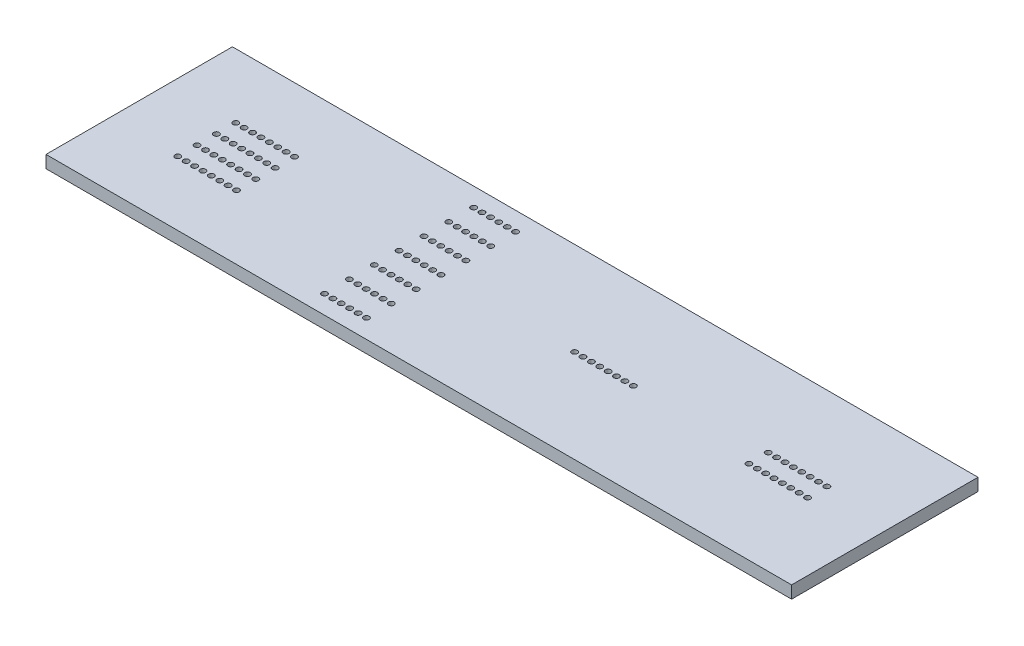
ISO-10303-21;
HEADER;
FILE_DESCRIPTION(('STEP AP214'),'2;1');
FILE_NAME('part.step','',(''),(''),'','','');
FILE_SCHEMA(('AUTOMOTIVE_DESIGN { 1 0 10303 214 1 1 1 1 }'));
ENDSEC;
DATA;
#1=APPLICATION_CONTEXT('core data for automotive mechanical design processes');
#2=APPLICATION_PROTOCOL_DEFINITION('international standard','automotive_design',2000,#1);
#3=PRODUCT_CONTEXT('',#1,'mechanical');
#4=PRODUCT('Part','Part','',(#3));
#5=PRODUCT_RELATED_PRODUCT_CATEGORY('part','',(#4));
#6=PRODUCT_DEFINITION_FORMATION('','',#4);
#7=PRODUCT_DEFINITION_CONTEXT('part definition',#1,'design');
#8=PRODUCT_DEFINITION('design','',#6,#7);
#9=PRODUCT_DEFINITION_SHAPE('','',#8);
#10=(LENGTH_UNIT() NAMED_UNIT(*) SI_UNIT(.MILLI.,.METRE.));
#11=(NAMED_UNIT(*) PLANE_ANGLE_UNIT() SI_UNIT($,.RADIAN.));
#12=(NAMED_UNIT(*) SI_UNIT($,.STERADIAN.) SOLID_ANGLE_UNIT());
#13=UNCERTAINTY_MEASURE_WITH_UNIT(LENGTH_MEASURE(1.E-05),#10,'distance_accuracy_value','');
#14=(GEOMETRIC_REPRESENTATION_CONTEXT(3) GLOBAL_UNCERTAINTY_ASSIGNED_CONTEXT((#13)) GLOBAL_UNIT_ASSIGNED_CONTEXT((#10,
#11,#12)) REPRESENTATION_CONTEXT('',''));
#15=CARTESIAN_POINT('',(0.,0.,0.));
#16=DIRECTION('',(0.,0.,1.));
#17=DIRECTION('',(1.,0.,0.));
#18=AXIS2_PLACEMENT_3D('',#15,#16,#17);
#19=CARTESIAN_POINT('',(49.125,-0.00100000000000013,1.555));
#20=DIRECTION('',(0.,1.,0.));
#21=DIRECTION('',(0.,0.,1.));
#22=AXIS2_PLACEMENT_3D('',#19,#20,#21);
#23=CYLINDRICAL_SURFACE('',#22,0.450000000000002);
#24=CARTESIAN_POINT('',(49.125,0.,1.555));
#25=DIRECTION('',(0.,-1.,0.));
#26=DIRECTION('',(0.,0.,-1.));
#27=AXIS2_PLACEMENT_3D('',#24,#25,#26);
#28=CIRCLE('',#27,0.450000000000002);
#29=CARTESIAN_POINT('',(49.125,0.,1.105));
#30=VERTEX_POINT('',#29);
#31=EDGE_CURVE('E54',#30,#30,#28,.F.);
#32=ORIENTED_EDGE('',*,*,#31,.F.);
#33=EDGE_LOOP('',(#32));
#34=FACE_BOUND('',#33,.T.);
#35=CARTESIAN_POINT('',(49.125,2.,1.555));
#36=DIRECTION('',(0.,1.,0.));
#37=DIRECTION('',(0.,0.,1.));
#38=AXIS2_PLACEMENT_3D('',#35,#36,#37);
#39=CIRCLE('',#38,0.450000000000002);
#40=CARTESIAN_POINT('',(49.125,2.,2.005));
#41=VERTEX_POINT('',#40);
#42=EDGE_CURVE('E11',#41,#41,#39,.T.);
#43=ORIENTED_EDGE('',*,*,#42,.T.);
#44=EDGE_LOOP('',(#43));
#45=FACE_BOUND('',#44,.T.);
#46=ADVANCED_FACE('F45',(#34,#45),#23,.F.);
#47=CARTESIAN_POINT('',(47.775,-0.00100000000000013,1.555));
#48=DIRECTION('',(0.,1.,0.));
#49=DIRECTION('',(0.,0.,1.));
#50=AXIS2_PLACEMENT_3D('',#47,#48,#49);
#51=CYLINDRICAL_SURFACE('',#50,0.450000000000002);
#52=CARTESIAN_POINT('',(47.775,0.,1.555));
#53=DIRECTION('',(0.,-1.,0.));
#54=DIRECTION('',(0.,0.,-1.));
#55=AXIS2_PLACEMENT_3D('',#52,#53,#54);
#56=CIRCLE('',#55,0.450000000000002);
#57=CARTESIAN_POINT('',(47.775,0.,1.105));
#58=VERTEX_POINT('',#57);
#59=EDGE_CURVE('E843',#58,#58,#56,.F.);
#60=ORIENTED_EDGE('',*,*,#59,.F.);
#61=EDGE_LOOP('',(#60));
#62=FACE_BOUND('',#61,.T.);
#63=CARTESIAN_POINT('',(47.775,2.,1.555));
#64=DIRECTION('',(0.,1.,0.));
#65=DIRECTION('',(0.,0.,1.));
#66=AXIS2_PLACEMENT_3D('',#63,#64,#65);
#67=CIRCLE('',#66,0.450000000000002);
#68=CARTESIAN_POINT('',(47.775,2.,2.005));
#69=VERTEX_POINT('',#68);
#70=EDGE_CURVE('E847',#69,#69,#67,.T.);
#71=ORIENTED_EDGE('',*,*,#70,.T.);
#72=EDGE_LOOP('',(#71));
#73=FACE_BOUND('',#72,.T.);
#74=ADVANCED_FACE('F858',(#62,#73),#51,.F.);
#75=CARTESIAN_POINT('',(46.425,-0.00100000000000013,1.555));
#76=DIRECTION('',(0.,1.,0.));
#77=DIRECTION('',(0.,0.,1.));
#78=AXIS2_PLACEMENT_3D('',#75,#76,#77);
#79=CYLINDRICAL_SURFACE('',#78,0.450000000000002);
#80=CARTESIAN_POINT('',(46.425,0.,1.555));
#81=DIRECTION('',(0.,-1.,0.));
#82=DIRECTION('',(0.,0.,-1.));
#83=AXIS2_PLACEMENT_3D('',#80,#81,#82);
#84=CIRCLE('',#83,0.450000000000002);
#85=CARTESIAN_POINT('',(46.425,0.,1.105));
#86=VERTEX_POINT('',#85);
#87=EDGE_CURVE('E835',#86,#86,#84,.F.);
#88=ORIENTED_EDGE('',*,*,#87,.F.);
#89=EDGE_LOOP('',(#88));
#90=FACE_BOUND('',#89,.T.);
#91=CARTESIAN_POINT('',(46.425,2.,1.555));
#92=DIRECTION('',(0.,1.,0.));
#93=DIRECTION('',(0.,0.,1.));
#94=AXIS2_PLACEMENT_3D('',#91,#92,#93);
#95=CIRCLE('',#94,0.450000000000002);
#96=CARTESIAN_POINT('',(46.425,2.,2.005));
#97=VERTEX_POINT('',#96);
#98=EDGE_CURVE('E839',#97,#97,#95,.T.);
#99=ORIENTED_EDGE('',*,*,#98,.T.);
#100=EDGE_LOOP('',(#99));
#101=FACE_BOUND('',#100,.T.);
#102=ADVANCED_FACE('F1232',(#90,#101),#79,.F.);
#103=CARTESIAN_POINT('',(45.075,-0.00100000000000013,1.555));
#104=DIRECTION('',(0.,1.,0.));
#105=DIRECTION('',(0.,0.,1.));
#106=AXIS2_PLACEMENT_3D('',#103,#104,#105);
#107=CYLINDRICAL_SURFACE('',#106,0.450000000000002);
#108=CARTESIAN_POINT('',(45.075,0.,1.555));
#109=DIRECTION('',(0.,-1.,0.));
#110=DIRECTION('',(0.,0.,-1.));
#111=AXIS2_PLACEMENT_3D('',#108,#109,#110);
#112=CIRCLE('',#111,0.450000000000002);
#113=CARTESIAN_POINT('',(45.075,0.,1.105));
#114=VERTEX_POINT('',#113);
#115=EDGE_CURVE('E827',#114,#114,#112,.F.);
#116=ORIENTED_EDGE('',*,*,#115,.F.);
#117=EDGE_LOOP('',(#116));
#118=FACE_BOUND('',#117,.T.);
#119=CARTESIAN_POINT('',(45.075,2.,1.555));
#120=DIRECTION('',(0.,1.,0.));
#121=DIRECTION('',(0.,0.,1.));
#122=AXIS2_PLACEMENT_3D('',#119,#120,#121);
#123=CIRCLE('',#122,0.450000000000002);
#124=CARTESIAN_POINT('',(45.075,2.,2.005));
#125=VERTEX_POINT('',#124);
#126=EDGE_CURVE('E831',#125,#125,#123,.T.);
#127=ORIENTED_EDGE('',*,*,#126,.T.);
#128=EDGE_LOOP('',(#127));
#129=FACE_BOUND('',#128,.T.);
#130=ADVANCED_FACE('F1228',(#118,#129),#107,.F.);
#131=CARTESIAN_POINT('',(43.725,-0.00100000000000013,1.555));
#132=DIRECTION('',(0.,1.,0.));
#133=DIRECTION('',(0.,0.,1.));
#134=AXIS2_PLACEMENT_3D('',#131,#132,#133);
#135=CYLINDRICAL_SURFACE('',#134,0.450000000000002);
#136=CARTESIAN_POINT('',(43.725,0.,1.555));
#137=DIRECTION('',(0.,-1.,0.));
#138=DIRECTION('',(0.,0.,-1.));
#139=AXIS2_PLACEMENT_3D('',#136,#137,#138);
#140=CIRCLE('',#139,0.450000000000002);
#141=CARTESIAN_POINT('',(43.725,0.,1.105));
#142=VERTEX_POINT('',#141);
#143=EDGE_CURVE('E819',#142,#142,#140,.F.);
#144=ORIENTED_EDGE('',*,*,#143,.F.);
#145=EDGE_LOOP('',(#144));
#146=FACE_BOUND('',#145,.T.);
#147=CARTESIAN_POINT('',(43.725,2.,1.555));
#148=DIRECTION('',(0.,1.,0.));
#149=DIRECTION('',(0.,0.,1.));
#150=AXIS2_PLACEMENT_3D('',#147,#148,#149);
#151=CIRCLE('',#150,0.450000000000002);
#152=CARTESIAN_POINT('',(43.725,2.,2.005));
#153=VERTEX_POINT('',#152);
#154=EDGE_CURVE('E823',#153,#153,#151,.T.);
#155=ORIENTED_EDGE('',*,*,#154,.T.);
#156=EDGE_LOOP('',(#155));
#157=FACE_BOUND('',#156,.T.);
#158=ADVANCED_FACE('F1224',(#146,#157),#135,.F.);
#159=CARTESIAN_POINT('',(42.375,-0.00100000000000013,1.555));
#160=DIRECTION('',(0.,1.,0.));
#161=DIRECTION('',(0.,0.,1.));
#162=AXIS2_PLACEMENT_3D('',#159,#160,#161);
#163=CYLINDRICAL_SURFACE('',#162,0.450000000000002);
#164=CARTESIAN_POINT('',(42.375,0.,1.555));
#165=DIRECTION('',(0.,-1.,0.));
#166=DIRECTION('',(0.,0.,-1.));
#167=AXIS2_PLACEMENT_3D('',#164,#165,#166);
#168=CIRCLE('',#167,0.450000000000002);
#169=CARTESIAN_POINT('',(42.375,0.,1.105));
#170=VERTEX_POINT('',#169);
#171=EDGE_CURVE('E811',#170,#170,#168,.F.);
#172=ORIENTED_EDGE('',*,*,#171,.F.);
#173=EDGE_LOOP('',(#172));
#174=FACE_BOUND('',#173,.T.);
#175=CARTESIAN_POINT('',(42.375,2.,1.555));
#176=DIRECTION('',(0.,1.,0.));
#177=DIRECTION('',(0.,0.,1.));
#178=AXIS2_PLACEMENT_3D('',#175,#176,#177);
#179=CIRCLE('',#178,0.450000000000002);
#180=CARTESIAN_POINT('',(42.375,2.,2.005));
#181=VERTEX_POINT('',#180);
#182=EDGE_CURVE('E815',#181,#181,#179,.T.);
#183=ORIENTED_EDGE('',*,*,#182,.T.);
#184=EDGE_LOOP('',(#183));
#185=FACE_BOUND('',#184,.T.);
#186=ADVANCED_FACE('F1220',(#174,#185),#163,.F.);
#187=CARTESIAN_POINT('',(41.025,-0.00100000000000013,1.555));
#188=DIRECTION('',(0.,1.,0.));
#189=DIRECTION('',(0.,0.,1.));
#190=AXIS2_PLACEMENT_3D('',#187,#188,#189);
#191=CYLINDRICAL_SURFACE('',#190,0.450000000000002);
#192=CARTESIAN_POINT('',(41.025,0.,1.555));
#193=DIRECTION('',(0.,-1.,0.));
#194=DIRECTION('',(0.,0.,-1.));
#195=AXIS2_PLACEMENT_3D('',#192,#193,#194);
#196=CIRCLE('',#195,0.450000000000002);
#197=CARTESIAN_POINT('',(41.025,0.,1.105));
#198=VERTEX_POINT('',#197);
#199=EDGE_CURVE('E803',#198,#198,#196,.F.);
#200=ORIENTED_EDGE('',*,*,#199,.F.);
#201=EDGE_LOOP('',(#200));
#202=FACE_BOUND('',#201,.T.);
#203=CARTESIAN_POINT('',(41.025,2.,1.555));
#204=DIRECTION('',(0.,1.,0.));
#205=DIRECTION('',(0.,0.,1.));
#206=AXIS2_PLACEMENT_3D('',#203,#204,#205);
#207=CIRCLE('',#206,0.450000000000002);
#208=CARTESIAN_POINT('',(41.025,2.,2.005));
#209=VERTEX_POINT('',#208);
#210=EDGE_CURVE('E807',#209,#209,#207,.T.);
#211=ORIENTED_EDGE('',*,*,#210,.T.);
#212=EDGE_LOOP('',(#211));
#213=FACE_BOUND('',#212,.T.);
#214=ADVANCED_FACE('F1216',(#202,#213),#191,.F.);
#215=CARTESIAN_POINT('',(39.675,-0.00100000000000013,1.555));
#216=DIRECTION('',(0.,1.,0.));
#217=DIRECTION('',(0.,0.,1.));
#218=AXIS2_PLACEMENT_3D('',#215,#216,#217);
#219=CYLINDRICAL_SURFACE('',#218,0.450000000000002);
#220=CARTESIAN_POINT('',(39.675,0.,1.555));
#221=DIRECTION('',(0.,-1.,0.));
#222=DIRECTION('',(0.,0.,-1.));
#223=AXIS2_PLACEMENT_3D('',#220,#221,#222);
#224=CIRCLE('',#223,0.450000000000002);
#225=CARTESIAN_POINT('',(39.675,0.,1.105));
#226=VERTEX_POINT('',#225);
#227=EDGE_CURVE('E795',#226,#226,#224,.F.);
#228=ORIENTED_EDGE('',*,*,#227,.F.);
#229=EDGE_LOOP('',(#228));
#230=FACE_BOUND('',#229,.T.);
#231=CARTESIAN_POINT('',(39.675,2.,1.555));
#232=DIRECTION('',(0.,1.,0.));
#233=DIRECTION('',(0.,0.,1.));
#234=AXIS2_PLACEMENT_3D('',#231,#232,#233);
#235=CIRCLE('',#234,0.450000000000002);
#236=CARTESIAN_POINT('',(39.675,2.,2.005));
#237=VERTEX_POINT('',#236);
#238=EDGE_CURVE('E799',#237,#237,#235,.T.);
#239=ORIENTED_EDGE('',*,*,#238,.T.);
#240=EDGE_LOOP('',(#239));
#241=FACE_BOUND('',#240,.T.);
#242=ADVANCED_FACE('F1212',(#230,#241),#219,.F.);
#243=CARTESIAN_POINT('',(49.125,-0.00100000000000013,-1.555));
#244=DIRECTION('',(0.,1.,0.));
#245=DIRECTION('',(0.,0.,1.));
#246=AXIS2_PLACEMENT_3D('',#243,#244,#245);
#247=CYLINDRICAL_SURFACE('',#246,0.450000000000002);
#248=CARTESIAN_POINT('',(49.125,0.,-1.555));
#249=DIRECTION('',(0.,-1.,0.));
#250=DIRECTION('',(0.,0.,-1.));
#251=AXIS2_PLACEMENT_3D('',#248,#249,#250);
#252=CIRCLE('',#251,0.450000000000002);
#253=CARTESIAN_POINT('',(49.125,0.,-2.005));
#254=VERTEX_POINT('',#253);
#255=EDGE_CURVE('E787',#254,#254,#252,.F.);
#256=ORIENTED_EDGE('',*,*,#255,.F.);
#257=EDGE_LOOP('',(#256));
#258=FACE_BOUND('',#257,.T.);
#259=CARTESIAN_POINT('',(49.125,2.,-1.555));
#260=DIRECTION('',(0.,1.,0.));
#261=DIRECTION('',(0.,0.,1.));
#262=AXIS2_PLACEMENT_3D('',#259,#260,#261);
#263=CIRCLE('',#262,0.450000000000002);
#264=CARTESIAN_POINT('',(49.125,2.,-1.105));
#265=VERTEX_POINT('',#264);
#266=EDGE_CURVE('E791',#265,#265,#263,.T.);
#267=ORIENTED_EDGE('',*,*,#266,.T.);
#268=EDGE_LOOP('',(#267));
#269=FACE_BOUND('',#268,.T.);
#270=ADVANCED_FACE('F1208',(#258,#269),#247,.F.);
#271=CARTESIAN_POINT('',(47.775,-0.00100000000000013,-1.555));
#272=DIRECTION('',(0.,1.,0.));
#273=DIRECTION('',(0.,0.,1.));
#274=AXIS2_PLACEMENT_3D('',#271,#272,#273);
#275=CYLINDRICAL_SURFACE('',#274,0.450000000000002);
#276=CARTESIAN_POINT('',(47.775,0.,-1.555));
#277=DIRECTION('',(0.,-1.,0.));
#278=DIRECTION('',(0.,0.,-1.));
#279=AXIS2_PLACEMENT_3D('',#276,#277,#278);
#280=CIRCLE('',#279,0.450000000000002);
#281=CARTESIAN_POINT('',(47.775,0.,-2.005));
#282=VERTEX_POINT('',#281);
#283=EDGE_CURVE('E779',#282,#282,#280,.F.);
#284=ORIENTED_EDGE('',*,*,#283,.F.);
#285=EDGE_LOOP('',(#284));
#286=FACE_BOUND('',#285,.T.);
#287=CARTESIAN_POINT('',(47.775,2.,-1.555));
#288=DIRECTION('',(0.,1.,0.));
#289=DIRECTION('',(0.,0.,1.));
#290=AXIS2_PLACEMENT_3D('',#287,#288,#289);
#291=CIRCLE('',#290,0.450000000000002);
#292=CARTESIAN_POINT('',(47.775,2.,-1.105));
#293=VERTEX_POINT('',#292);
#294=EDGE_CURVE('E783',#293,#293,#291,.T.);
#295=ORIENTED_EDGE('',*,*,#294,.T.);
#296=EDGE_LOOP('',(#295));
#297=FACE_BOUND('',#296,.T.);
#298=ADVANCED_FACE('F1204',(#286,#297),#275,.F.);
#299=CARTESIAN_POINT('',(46.425,-0.00100000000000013,-1.555));
#300=DIRECTION('',(0.,1.,0.));
#301=DIRECTION('',(0.,0.,1.));
#302=AXIS2_PLACEMENT_3D('',#299,#300,#301);
#303=CYLINDRICAL_SURFACE('',#302,0.450000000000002);
#304=CARTESIAN_POINT('',(46.425,0.,-1.555));
#305=DIRECTION('',(0.,-1.,0.));
#306=DIRECTION('',(0.,0.,-1.));
#307=AXIS2_PLACEMENT_3D('',#304,#305,#306);
#308=CIRCLE('',#307,0.450000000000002);
#309=CARTESIAN_POINT('',(46.425,0.,-2.005));
#310=VERTEX_POINT('',#309);
#311=EDGE_CURVE('E771',#310,#310,#308,.F.);
#312=ORIENTED_EDGE('',*,*,#311,.F.);
#313=EDGE_LOOP('',(#312));
#314=FACE_BOUND('',#313,.T.);
#315=CARTESIAN_POINT('',(46.425,2.,-1.555));
#316=DIRECTION('',(0.,1.,0.));
#317=DIRECTION('',(0.,0.,1.));
#318=AXIS2_PLACEMENT_3D('',#315,#316,#317);
#319=CIRCLE('',#318,0.450000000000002);
#320=CARTESIAN_POINT('',(46.425,2.,-1.105));
#321=VERTEX_POINT('',#320);
#322=EDGE_CURVE('E775',#321,#321,#319,.T.);
#323=ORIENTED_EDGE('',*,*,#322,.T.);
#324=EDGE_LOOP('',(#323));
#325=FACE_BOUND('',#324,.T.);
#326=ADVANCED_FACE('F1200',(#314,#325),#303,.F.);
#327=CARTESIAN_POINT('',(45.075,-0.00100000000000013,-1.555));
#328=DIRECTION('',(0.,1.,0.));
#329=DIRECTION('',(0.,0.,1.));
#330=AXIS2_PLACEMENT_3D('',#327,#328,#329);
#331=CYLINDRICAL_SURFACE('',#330,0.450000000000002);
#332=CARTESIAN_POINT('',(45.075,0.,-1.555));
#333=DIRECTION('',(0.,-1.,0.));
#334=DIRECTION('',(0.,0.,-1.));
#335=AXIS2_PLACEMENT_3D('',#332,#333,#334);
#336=CIRCLE('',#335,0.450000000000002);
#337=CARTESIAN_POINT('',(45.075,0.,-2.005));
#338=VERTEX_POINT('',#337);
#339=EDGE_CURVE('E763',#338,#338,#336,.F.);
#340=ORIENTED_EDGE('',*,*,#339,.F.);
#341=EDGE_LOOP('',(#340));
#342=FACE_BOUND('',#341,.T.);
#343=CARTESIAN_POINT('',(45.075,2.,-1.555));
#344=DIRECTION('',(0.,1.,0.));
#345=DIRECTION('',(0.,0.,1.));
#346=AXIS2_PLACEMENT_3D('',#343,#344,#345);
#347=CIRCLE('',#346,0.450000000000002);
#348=CARTESIAN_POINT('',(45.075,2.,-1.105));
#349=VERTEX_POINT('',#348);
#350=EDGE_CURVE('E767',#349,#349,#347,.T.);
#351=ORIENTED_EDGE('',*,*,#350,.T.);
#352=EDGE_LOOP('',(#351));
#353=FACE_BOUND('',#352,.T.);
#354=ADVANCED_FACE('F1196',(#342,#353),#331,.F.);
#355=CARTESIAN_POINT('',(43.725,-0.00100000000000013,-1.555));
#356=DIRECTION('',(0.,1.,0.));
#357=DIRECTION('',(0.,0.,1.));
#358=AXIS2_PLACEMENT_3D('',#355,#356,#357);
#359=CYLINDRICAL_SURFACE('',#358,0.450000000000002);
#360=CARTESIAN_POINT('',(43.725,0.,-1.555));
#361=DIRECTION('',(0.,-1.,0.));
#362=DIRECTION('',(0.,0.,-1.));
#363=AXIS2_PLACEMENT_3D('',#360,#361,#362);
#364=CIRCLE('',#363,0.450000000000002);
#365=CARTESIAN_POINT('',(43.725,0.,-2.005));
#366=VERTEX_POINT('',#365);
#367=EDGE_CURVE('E755',#366,#366,#364,.F.);
#368=ORIENTED_EDGE('',*,*,#367,.F.);
#369=EDGE_LOOP('',(#368));
#370=FACE_BOUND('',#369,.T.);
#371=CARTESIAN_POINT('',(43.725,2.,-1.555));
#372=DIRECTION('',(0.,1.,0.));
#373=DIRECTION('',(0.,0.,1.));
#374=AXIS2_PLACEMENT_3D('',#371,#372,#373);
#375=CIRCLE('',#374,0.450000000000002);
#376=CARTESIAN_POINT('',(43.725,2.,-1.105));
#377=VERTEX_POINT('',#376);
#378=EDGE_CURVE('E759',#377,#377,#375,.T.);
#379=ORIENTED_EDGE('',*,*,#378,.T.);
#380=EDGE_LOOP('',(#379));
#381=FACE_BOUND('',#380,.T.);
#382=ADVANCED_FACE('F1192',(#370,#381),#359,.F.);
#383=CARTESIAN_POINT('',(42.375,-0.00100000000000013,-1.555));
#384=DIRECTION('',(0.,1.,0.));
#385=DIRECTION('',(0.,0.,1.));
#386=AXIS2_PLACEMENT_3D('',#383,#384,#385);
#387=CYLINDRICAL_SURFACE('',#386,0.450000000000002);
#388=CARTESIAN_POINT('',(42.375,0.,-1.555));
#389=DIRECTION('',(0.,-1.,0.));
#390=DIRECTION('',(0.,0.,-1.));
#391=AXIS2_PLACEMENT_3D('',#388,#389,#390);
#392=CIRCLE('',#391,0.450000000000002);
#393=CARTESIAN_POINT('',(42.375,0.,-2.005));
#394=VERTEX_POINT('',#393);
#395=EDGE_CURVE('E747',#394,#394,#392,.F.);
#396=ORIENTED_EDGE('',*,*,#395,.F.);
#397=EDGE_LOOP('',(#396));
#398=FACE_BOUND('',#397,.T.);
#399=CARTESIAN_POINT('',(42.375,2.,-1.555));
#400=DIRECTION('',(0.,1.,0.));
#401=DIRECTION('',(0.,0.,1.));
#402=AXIS2_PLACEMENT_3D('',#399,#400,#401);
#403=CIRCLE('',#402,0.450000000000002);
#404=CARTESIAN_POINT('',(42.375,2.,-1.105));
#405=VERTEX_POINT('',#404);
#406=EDGE_CURVE('E751',#405,#405,#403,.T.);
#407=ORIENTED_EDGE('',*,*,#406,.T.);
#408=EDGE_LOOP('',(#407));
#409=FACE_BOUND('',#408,.T.);
#410=ADVANCED_FACE('F1189',(#398,#409),#387,.F.);
#411=CARTESIAN_POINT('',(19.525,-0.00100000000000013,0.));
#412=DIRECTION('',(0.,1.,0.));
#413=DIRECTION('',(0.,0.,1.));
#414=AXIS2_PLACEMENT_3D('',#411,#412,#413);
#415=CYLINDRICAL_SURFACE('',#414,0.45);
#416=CARTESIAN_POINT('',(19.525,0.,0.));
#417=DIRECTION('',(0.,-1.,0.));
#418=DIRECTION('',(0.,0.,-1.));
#419=AXIS2_PLACEMENT_3D('',#416,#417,#418);
#420=CIRCLE('',#419,0.45);
#421=CARTESIAN_POINT('',(19.525,0.,-0.45));
#422=VERTEX_POINT('',#421);
#423=EDGE_CURVE('E739',#422,#422,#420,.F.);
#424=ORIENTED_EDGE('',*,*,#423,.F.);
#425=EDGE_LOOP('',(#424));
#426=FACE_BOUND('',#425,.T.);
#427=CARTESIAN_POINT('',(19.525,2.,0.));
#428=DIRECTION('',(0.,1.,0.));
#429=DIRECTION('',(0.,0.,1.));
#430=AXIS2_PLACEMENT_3D('',#427,#428,#429);
#431=CIRCLE('',#430,0.45);
#432=CARTESIAN_POINT('',(19.525,2.,0.45));
#433=VERTEX_POINT('',#432);
#434=EDGE_CURVE('E743',#433,#433,#431,.T.);
#435=ORIENTED_EDGE('',*,*,#434,.T.);
#436=EDGE_LOOP('',(#435));
#437=FACE_BOUND('',#436,.T.);
#438=ADVANCED_FACE('F1185',(#426,#437),#415,.F.);
#439=CARTESIAN_POINT('',(18.175,-0.00100000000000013,0.));
#440=DIRECTION('',(0.,1.,0.));
#441=DIRECTION('',(0.,0.,1.));
#442=AXIS2_PLACEMENT_3D('',#439,#440,#441);
#443=CYLINDRICAL_SURFACE('',#442,0.45);
#444=CARTESIAN_POINT('',(18.175,0.,0.));
#445=DIRECTION('',(0.,-1.,0.));
#446=DIRECTION('',(0.,0.,-1.));
#447=AXIS2_PLACEMENT_3D('',#444,#445,#446);
#448=CIRCLE('',#447,0.45);
#449=CARTESIAN_POINT('',(18.175,0.,-0.45));
#450=VERTEX_POINT('',#449);
#451=EDGE_CURVE('E731',#450,#450,#448,.F.);
#452=ORIENTED_EDGE('',*,*,#451,.F.);
#453=EDGE_LOOP('',(#452));
#454=FACE_BOUND('',#453,.T.);
#455=CARTESIAN_POINT('',(18.175,2.,0.));
#456=DIRECTION('',(0.,1.,0.));
#457=DIRECTION('',(0.,0.,1.));
#458=AXIS2_PLACEMENT_3D('',#455,#456,#457);
#459=CIRCLE('',#458,0.45);
#460=CARTESIAN_POINT('',(18.175,2.,0.45));
#461=VERTEX_POINT('',#460);
#462=EDGE_CURVE('E735',#461,#461,#459,.T.);
#463=ORIENTED_EDGE('',*,*,#462,.T.);
#464=EDGE_LOOP('',(#463));
#465=FACE_BOUND('',#464,.T.);
#466=ADVANCED_FACE('F1181',(#454,#465),#443,.F.);
#467=CARTESIAN_POINT('',(16.825,-0.00100000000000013,0.));
#468=DIRECTION('',(0.,1.,0.));
#469=DIRECTION('',(0.,0.,1.));
#470=AXIS2_PLACEMENT_3D('',#467,#468,#469);
#471=CYLINDRICAL_SURFACE('',#470,0.45);
#472=CARTESIAN_POINT('',(16.825,0.,0.));
#473=DIRECTION('',(0.,-1.,0.));
#474=DIRECTION('',(0.,0.,-1.));
#475=AXIS2_PLACEMENT_3D('',#472,#473,#474);
#476=CIRCLE('',#475,0.45);
#477=CARTESIAN_POINT('',(16.825,0.,-0.45));
#478=VERTEX_POINT('',#477);
#479=EDGE_CURVE('E723',#478,#478,#476,.F.);
#480=ORIENTED_EDGE('',*,*,#479,.F.);
#481=EDGE_LOOP('',(#480));
#482=FACE_BOUND('',#481,.T.);
#483=CARTESIAN_POINT('',(16.825,2.,0.));
#484=DIRECTION('',(0.,1.,0.));
#485=DIRECTION('',(0.,0.,1.));
#486=AXIS2_PLACEMENT_3D('',#483,#484,#485);
#487=CIRCLE('',#486,0.45);
#488=CARTESIAN_POINT('',(16.825,2.,0.45));
#489=VERTEX_POINT('',#488);
#490=EDGE_CURVE('E727',#489,#489,#487,.T.);
#491=ORIENTED_EDGE('',*,*,#490,.T.);
#492=EDGE_LOOP('',(#491));
#493=FACE_BOUND('',#492,.T.);
#494=ADVANCED_FACE('F1177',(#482,#493),#471,.F.);
#495=CARTESIAN_POINT('',(15.475,-0.00100000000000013,0.));
#496=DIRECTION('',(0.,1.,0.));
#497=DIRECTION('',(0.,0.,1.));
#498=AXIS2_PLACEMENT_3D('',#495,#496,#497);
#499=CYLINDRICAL_SURFACE('',#498,0.45);
#500=CARTESIAN_POINT('',(15.475,0.,0.));
#501=DIRECTION('',(0.,-1.,0.));
#502=DIRECTION('',(0.,0.,-1.));
#503=AXIS2_PLACEMENT_3D('',#500,#501,#502);
#504=CIRCLE('',#503,0.45);
#505=CARTESIAN_POINT('',(15.475,0.,-0.45));
#506=VERTEX_POINT('',#505);
#507=EDGE_CURVE('E715',#506,#506,#504,.F.);
#508=ORIENTED_EDGE('',*,*,#507,.F.);
#509=EDGE_LOOP('',(#508));
#510=FACE_BOUND('',#509,.T.);
#511=CARTESIAN_POINT('',(15.475,2.,0.));
#512=DIRECTION('',(0.,1.,0.));
#513=DIRECTION('',(0.,0.,1.));
#514=AXIS2_PLACEMENT_3D('',#511,#512,#513);
#515=CIRCLE('',#514,0.45);
#516=CARTESIAN_POINT('',(15.475,2.,0.45));
#517=VERTEX_POINT('',#516);
#518=EDGE_CURVE('E719',#517,#517,#515,.T.);
#519=ORIENTED_EDGE('',*,*,#518,.T.);
#520=EDGE_LOOP('',(#519));
#521=FACE_BOUND('',#520,.T.);
#522=ADVANCED_FACE('F1173',(#510,#521),#499,.F.);
#523=CARTESIAN_POINT('',(14.125,-0.00100000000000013,0.));
#524=DIRECTION('',(0.,1.,0.));
#525=DIRECTION('',(0.,0.,1.));
#526=AXIS2_PLACEMENT_3D('',#523,#524,#525);
#527=CYLINDRICAL_SURFACE('',#526,0.45);
#528=CARTESIAN_POINT('',(14.125,0.,0.));
#529=DIRECTION('',(0.,-1.,0.));
#530=DIRECTION('',(0.,0.,-1.));
#531=AXIS2_PLACEMENT_3D('',#528,#529,#530);
#532=CIRCLE('',#531,0.45);
#533=CARTESIAN_POINT('',(14.125,0.,-0.45));
#534=VERTEX_POINT('',#533);
#535=EDGE_CURVE('E707',#534,#534,#532,.F.);
#536=ORIENTED_EDGE('',*,*,#535,.F.);
#537=EDGE_LOOP('',(#536));
#538=FACE_BOUND('',#537,.T.);
#539=CARTESIAN_POINT('',(14.125,2.,0.));
#540=DIRECTION('',(0.,1.,0.));
#541=DIRECTION('',(0.,0.,1.));
#542=AXIS2_PLACEMENT_3D('',#539,#540,#541);
#543=CIRCLE('',#542,0.45);
#544=CARTESIAN_POINT('',(14.125,2.,0.45));
#545=VERTEX_POINT('',#544);
#546=EDGE_CURVE('E711',#545,#545,#543,.T.);
#547=ORIENTED_EDGE('',*,*,#546,.T.);
#548=EDGE_LOOP('',(#547));
#549=FACE_BOUND('',#548,.T.);
#550=ADVANCED_FACE('F1169',(#538,#549),#527,.F.);
#551=CARTESIAN_POINT('',(12.775,-0.00100000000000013,0.));
#552=DIRECTION('',(0.,1.,0.));
#553=DIRECTION('',(0.,0.,1.));
#554=AXIS2_PLACEMENT_3D('',#551,#552,#553);
#555=CYLINDRICAL_SURFACE('',#554,0.45);
#556=CARTESIAN_POINT('',(12.775,0.,0.));
#557=DIRECTION('',(0.,-1.,0.));
#558=DIRECTION('',(0.,0.,-1.));
#559=AXIS2_PLACEMENT_3D('',#556,#557,#558);
#560=CIRCLE('',#559,0.45);
#561=CARTESIAN_POINT('',(12.775,0.,-0.45));
#562=VERTEX_POINT('',#561);
#563=EDGE_CURVE('E699',#562,#562,#560,.F.);
#564=ORIENTED_EDGE('',*,*,#563,.F.);
#565=EDGE_LOOP('',(#564));
#566=FACE_BOUND('',#565,.T.);
#567=CARTESIAN_POINT('',(12.775,2.,0.));
#568=DIRECTION('',(0.,1.,0.));
#569=DIRECTION('',(0.,0.,1.));
#570=AXIS2_PLACEMENT_3D('',#567,#568,#569);
#571=CIRCLE('',#570,0.45);
#572=CARTESIAN_POINT('',(12.775,2.,0.45));
#573=VERTEX_POINT('',#572);
#574=EDGE_CURVE('E703',#573,#573,#571,.T.);
#575=ORIENTED_EDGE('',*,*,#574,.T.);
#576=EDGE_LOOP('',(#575));
#577=FACE_BOUND('',#576,.T.);
#578=ADVANCED_FACE('F1165',(#566,#577),#555,.F.);
#579=CARTESIAN_POINT('',(-11.425,-0.00100000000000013,12.));
#580=DIRECTION('',(0.,1.,0.));
#581=DIRECTION('',(0.,0.,1.));
#582=AXIS2_PLACEMENT_3D('',#579,#580,#581);
#583=CYLINDRICAL_SURFACE('',#582,0.449999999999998);
#584=CARTESIAN_POINT('',(-11.425,0.,12.));
#585=DIRECTION('',(0.,-1.,0.));
#586=DIRECTION('',(0.,0.,-1.));
#587=AXIS2_PLACEMENT_3D('',#584,#585,#586);
#588=CIRCLE('',#587,0.449999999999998);
#589=CARTESIAN_POINT('',(-11.425,0.,11.55));
#590=VERTEX_POINT('',#589);
#591=EDGE_CURVE('E691',#590,#590,#588,.F.);
#592=ORIENTED_EDGE('',*,*,#591,.F.);
#593=EDGE_LOOP('',(#592));
#594=FACE_BOUND('',#593,.T.);
#595=CARTESIAN_POINT('',(-11.425,2.,12.));
#596=DIRECTION('',(0.,1.,0.));
#597=DIRECTION('',(0.,0.,1.));
#598=AXIS2_PLACEMENT_3D('',#595,#596,#597);
#599=CIRCLE('',#598,0.449999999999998);
#600=CARTESIAN_POINT('',(-11.425,2.,12.45));
#601=VERTEX_POINT('',#600);
#602=EDGE_CURVE('E695',#601,#601,#599,.T.);
#603=ORIENTED_EDGE('',*,*,#602,.T.);
#604=EDGE_LOOP('',(#603));
#605=FACE_BOUND('',#604,.T.);
#606=ADVANCED_FACE('F1161',(#594,#605),#583,.F.);
#607=CARTESIAN_POINT('',(-12.775,-0.00100000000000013,12.));
#608=DIRECTION('',(0.,1.,0.));
#609=DIRECTION('',(0.,0.,1.));
#610=AXIS2_PLACEMENT_3D('',#607,#608,#609);
#611=CYLINDRICAL_SURFACE('',#610,0.449999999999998);
#612=CARTESIAN_POINT('',(-12.775,0.,12.));
#613=DIRECTION('',(0.,-1.,0.));
#614=DIRECTION('',(0.,0.,-1.));
#615=AXIS2_PLACEMENT_3D('',#612,#613,#614);
#616=CIRCLE('',#615,0.449999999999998);
#617=CARTESIAN_POINT('',(-12.775,0.,11.55));
#618=VERTEX_POINT('',#617);
#619=EDGE_CURVE('E683',#618,#618,#616,.F.);
#620=ORIENTED_EDGE('',*,*,#619,.F.);
#621=EDGE_LOOP('',(#620));
#622=FACE_BOUND('',#621,.T.);
#623=CARTESIAN_POINT('',(-12.775,2.,12.));
#624=DIRECTION('',(0.,1.,0.));
#625=DIRECTION('',(0.,0.,1.));
#626=AXIS2_PLACEMENT_3D('',#623,#624,#625);
#627=CIRCLE('',#626,0.449999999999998);
#628=CARTESIAN_POINT('',(-12.775,2.,12.45));
#629=VERTEX_POINT('',#628);
#630=EDGE_CURVE('E687',#629,#629,#627,.T.);
#631=ORIENTED_EDGE('',*,*,#630,.T.);
#632=EDGE_LOOP('',(#631));
#633=FACE_BOUND('',#632,.T.);
#634=ADVANCED_FACE('F1157',(#622,#633),#611,.F.);
#635=CARTESIAN_POINT('',(-14.125,-0.00100000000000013,12.));
#636=DIRECTION('',(0.,1.,0.));
#637=DIRECTION('',(0.,0.,1.));
#638=AXIS2_PLACEMENT_3D('',#635,#636,#637);
#639=CYLINDRICAL_SURFACE('',#638,0.449999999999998);
#640=CARTESIAN_POINT('',(-14.125,0.,12.));
#641=DIRECTION('',(0.,-1.,0.));
#642=DIRECTION('',(0.,0.,-1.));
#643=AXIS2_PLACEMENT_3D('',#640,#641,#642);
#644=CIRCLE('',#643,0.449999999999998);
#645=CARTESIAN_POINT('',(-14.125,0.,11.55));
#646=VERTEX_POINT('',#645);
#647=EDGE_CURVE('E675',#646,#646,#644,.F.);
#648=ORIENTED_EDGE('',*,*,#647,.F.);
#649=EDGE_LOOP('',(#648));
#650=FACE_BOUND('',#649,.T.);
#651=CARTESIAN_POINT('',(-14.125,2.,12.));
#652=DIRECTION('',(0.,1.,0.));
#653=DIRECTION('',(0.,0.,1.));
#654=AXIS2_PLACEMENT_3D('',#651,#652,#653);
#655=CIRCLE('',#654,0.449999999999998);
#656=CARTESIAN_POINT('',(-14.125,2.,12.45));
#657=VERTEX_POINT('',#656);
#658=EDGE_CURVE('E679',#657,#657,#655,.T.);
#659=ORIENTED_EDGE('',*,*,#658,.T.);
#660=EDGE_LOOP('',(#659));
#661=FACE_BOUND('',#660,.T.);
#662=ADVANCED_FACE('F1153',(#650,#661),#639,.F.);
#663=CARTESIAN_POINT('',(-15.475,-0.00100000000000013,12.));
#664=DIRECTION('',(0.,1.,0.));
#665=DIRECTION('',(0.,0.,1.));
#666=AXIS2_PLACEMENT_3D('',#663,#664,#665);
#667=CYLINDRICAL_SURFACE('',#666,0.449999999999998);
#668=CARTESIAN_POINT('',(-15.475,0.,12.));
#669=DIRECTION('',(0.,-1.,0.));
#670=DIRECTION('',(0.,0.,-1.));
#671=AXIS2_PLACEMENT_3D('',#668,#669,#670);
#672=CIRCLE('',#671,0.449999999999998);
#673=CARTESIAN_POINT('',(-15.475,0.,11.55));
#674=VERTEX_POINT('',#673);
#675=EDGE_CURVE('E667',#674,#674,#672,.F.);
#676=ORIENTED_EDGE('',*,*,#675,.F.);
#677=EDGE_LOOP('',(#676));
#678=FACE_BOUND('',#677,.T.);
#679=CARTESIAN_POINT('',(-15.475,2.,12.));
#680=DIRECTION('',(0.,1.,0.));
#681=DIRECTION('',(0.,0.,1.));
#682=AXIS2_PLACEMENT_3D('',#679,#680,#681);
#683=CIRCLE('',#682,0.449999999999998);
#684=CARTESIAN_POINT('',(-15.475,2.,12.45));
#685=VERTEX_POINT('',#684);
#686=EDGE_CURVE('E671',#685,#685,#683,.T.);
#687=ORIENTED_EDGE('',*,*,#686,.T.);
#688=EDGE_LOOP('',(#687));
#689=FACE_BOUND('',#688,.T.);
#690=ADVANCED_FACE('F1149',(#678,#689),#667,.F.);
#691=CARTESIAN_POINT('',(-16.825,-0.00100000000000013,12.));
#692=DIRECTION('',(0.,1.,0.));
#693=DIRECTION('',(0.,0.,1.));
#694=AXIS2_PLACEMENT_3D('',#691,#692,#693);
#695=CYLINDRICAL_SURFACE('',#694,0.449999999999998);
#696=CARTESIAN_POINT('',(-16.825,0.,12.));
#697=DIRECTION('',(0.,-1.,0.));
#698=DIRECTION('',(0.,0.,-1.));
#699=AXIS2_PLACEMENT_3D('',#696,#697,#698);
#700=CIRCLE('',#699,0.449999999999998);
#701=CARTESIAN_POINT('',(-16.825,0.,11.55));
#702=VERTEX_POINT('',#701);
#703=EDGE_CURVE('E659',#702,#702,#700,.F.);
#704=ORIENTED_EDGE('',*,*,#703,.F.);
#705=EDGE_LOOP('',(#704));
#706=FACE_BOUND('',#705,.T.);
#707=CARTESIAN_POINT('',(-16.825,2.,12.));
#708=DIRECTION('',(0.,1.,0.));
#709=DIRECTION('',(0.,0.,1.));
#710=AXIS2_PLACEMENT_3D('',#707,#708,#709);
#711=CIRCLE('',#710,0.449999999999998);
#712=CARTESIAN_POINT('',(-16.825,2.,12.45));
#713=VERTEX_POINT('',#712);
#714=EDGE_CURVE('E663',#713,#713,#711,.T.);
#715=ORIENTED_EDGE('',*,*,#714,.T.);
#716=EDGE_LOOP('',(#715));
#717=FACE_BOUND('',#716,.T.);
#718=ADVANCED_FACE('F1145',(#706,#717),#695,.F.);
#719=CARTESIAN_POINT('',(-18.175,-0.00100000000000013,12.));
#720=DIRECTION('',(0.,1.,0.));
#721=DIRECTION('',(0.,0.,1.));
#722=AXIS2_PLACEMENT_3D('',#719,#720,#721);
#723=CYLINDRICAL_SURFACE('',#722,0.449999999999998);
#724=CARTESIAN_POINT('',(-18.175,0.,12.));
#725=DIRECTION('',(0.,-1.,0.));
#726=DIRECTION('',(0.,0.,-1.));
#727=AXIS2_PLACEMENT_3D('',#724,#725,#726);
#728=CIRCLE('',#727,0.449999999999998);
#729=CARTESIAN_POINT('',(-18.175,0.,11.55));
#730=VERTEX_POINT('',#729);
#731=EDGE_CURVE('E651',#730,#730,#728,.F.);
#732=ORIENTED_EDGE('',*,*,#731,.F.);
#733=EDGE_LOOP('',(#732));
#734=FACE_BOUND('',#733,.T.);
#735=CARTESIAN_POINT('',(-18.175,2.,12.));
#736=DIRECTION('',(0.,1.,0.));
#737=DIRECTION('',(0.,0.,1.));
#738=AXIS2_PLACEMENT_3D('',#735,#736,#737);
#739=CIRCLE('',#738,0.449999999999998);
#740=CARTESIAN_POINT('',(-18.175,2.,12.45));
#741=VERTEX_POINT('',#740);
#742=EDGE_CURVE('E655',#741,#741,#739,.T.);
#743=ORIENTED_EDGE('',*,*,#742,.T.);
#744=EDGE_LOOP('',(#743));
#745=FACE_BOUND('',#744,.T.);
#746=ADVANCED_FACE('F1141',(#734,#745),#723,.F.);
#747=CARTESIAN_POINT('',(-11.425,-0.00100000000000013,8.));
#748=DIRECTION('',(0.,1.,0.));
#749=DIRECTION('',(0.,0.,1.));
#750=AXIS2_PLACEMENT_3D('',#747,#748,#749);
#751=CYLINDRICAL_SURFACE('',#750,0.449999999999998);
#752=CARTESIAN_POINT('',(-11.425,0.,8.));
#753=DIRECTION('',(0.,-1.,0.));
#754=DIRECTION('',(0.,0.,-1.));
#755=AXIS2_PLACEMENT_3D('',#752,#753,#754);
#756=CIRCLE('',#755,0.449999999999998);
#757=CARTESIAN_POINT('',(-11.425,0.,7.55));
#758=VERTEX_POINT('',#757);
#759=EDGE_CURVE('E643',#758,#758,#756,.F.);
#760=ORIENTED_EDGE('',*,*,#759,.F.);
#761=EDGE_LOOP('',(#760));
#762=FACE_BOUND('',#761,.T.);
#763=CARTESIAN_POINT('',(-11.425,2.,8.));
#764=DIRECTION('',(0.,1.,0.));
#765=DIRECTION('',(0.,0.,1.));
#766=AXIS2_PLACEMENT_3D('',#763,#764,#765);
#767=CIRCLE('',#766,0.449999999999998);
#768=CARTESIAN_POINT('',(-11.425,2.,8.45));
#769=VERTEX_POINT('',#768);
#770=EDGE_CURVE('E647',#769,#769,#767,.T.);
#771=ORIENTED_EDGE('',*,*,#770,.T.);
#772=EDGE_LOOP('',(#771));
#773=FACE_BOUND('',#772,.T.);
#774=ADVANCED_FACE('F1137',(#762,#773),#751,.F.);
#775=CARTESIAN_POINT('',(-12.775,-0.00100000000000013,8.));
#776=DIRECTION('',(0.,1.,0.));
#777=DIRECTION('',(0.,0.,1.));
#778=AXIS2_PLACEMENT_3D('',#775,#776,#777);
#779=CYLINDRICAL_SURFACE('',#778,0.449999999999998);
#780=CARTESIAN_POINT('',(-12.775,0.,8.));
#781=DIRECTION('',(0.,-1.,0.));
#782=DIRECTION('',(0.,0.,-1.));
#783=AXIS2_PLACEMENT_3D('',#780,#781,#782);
#784=CIRCLE('',#783,0.449999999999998);
#785=CARTESIAN_POINT('',(-12.775,0.,7.55));
#786=VERTEX_POINT('',#785);
#787=EDGE_CURVE('E635',#786,#786,#784,.F.);
#788=ORIENTED_EDGE('',*,*,#787,.F.);
#789=EDGE_LOOP('',(#788));
#790=FACE_BOUND('',#789,.T.);
#791=CARTESIAN_POINT('',(-12.775,2.,8.));
#792=DIRECTION('',(0.,1.,0.));
#793=DIRECTION('',(0.,0.,1.));
#794=AXIS2_PLACEMENT_3D('',#791,#792,#793);
#795=CIRCLE('',#794,0.449999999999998);
#796=CARTESIAN_POINT('',(-12.775,2.,8.45));
#797=VERTEX_POINT('',#796);
#798=EDGE_CURVE('E639',#797,#797,#795,.T.);
#799=ORIENTED_EDGE('',*,*,#798,.T.);
#800=EDGE_LOOP('',(#799));
#801=FACE_BOUND('',#800,.T.);
#802=ADVANCED_FACE('F1133',(#790,#801),#779,.F.);
#803=CARTESIAN_POINT('',(-14.125,-0.00100000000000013,8.));
#804=DIRECTION('',(0.,1.,0.));
#805=DIRECTION('',(0.,0.,1.));
#806=AXIS2_PLACEMENT_3D('',#803,#804,#805);
#807=CYLINDRICAL_SURFACE('',#806,0.449999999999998);
#808=CARTESIAN_POINT('',(-14.125,0.,8.));
#809=DIRECTION('',(0.,-1.,0.));
#810=DIRECTION('',(0.,0.,-1.));
#811=AXIS2_PLACEMENT_3D('',#808,#809,#810);
#812=CIRCLE('',#811,0.449999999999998);
#813=CARTESIAN_POINT('',(-14.125,0.,7.55));
#814=VERTEX_POINT('',#813);
#815=EDGE_CURVE('E627',#814,#814,#812,.F.);
#816=ORIENTED_EDGE('',*,*,#815,.F.);
#817=EDGE_LOOP('',(#816));
#818=FACE_BOUND('',#817,.T.);
#819=CARTESIAN_POINT('',(-14.125,2.,8.));
#820=DIRECTION('',(0.,1.,0.));
#821=DIRECTION('',(0.,0.,1.));
#822=AXIS2_PLACEMENT_3D('',#819,#820,#821);
#823=CIRCLE('',#822,0.449999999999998);
#824=CARTESIAN_POINT('',(-14.125,2.,8.45));
#825=VERTEX_POINT('',#824);
#826=EDGE_CURVE('E631',#825,#825,#823,.T.);
#827=ORIENTED_EDGE('',*,*,#826,.T.);
#828=EDGE_LOOP('',(#827));
#829=FACE_BOUND('',#828,.T.);
#830=ADVANCED_FACE('F1129',(#818,#829),#807,.F.);
#831=CARTESIAN_POINT('',(-15.475,-0.00100000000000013,8.));
#832=DIRECTION('',(0.,1.,0.));
#833=DIRECTION('',(0.,0.,1.));
#834=AXIS2_PLACEMENT_3D('',#831,#832,#833);
#835=CYLINDRICAL_SURFACE('',#834,0.449999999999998);
#836=CARTESIAN_POINT('',(-15.475,0.,8.));
#837=DIRECTION('',(0.,-1.,0.));
#838=DIRECTION('',(0.,0.,-1.));
#839=AXIS2_PLACEMENT_3D('',#836,#837,#838);
#840=CIRCLE('',#839,0.449999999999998);
#841=CARTESIAN_POINT('',(-15.475,0.,7.55));
#842=VERTEX_POINT('',#841);
#843=EDGE_CURVE('E619',#842,#842,#840,.F.);
#844=ORIENTED_EDGE('',*,*,#843,.F.);
#845=EDGE_LOOP('',(#844));
#846=FACE_BOUND('',#845,.T.);
#847=CARTESIAN_POINT('',(-15.475,2.,8.));
#848=DIRECTION('',(0.,1.,0.));
#849=DIRECTION('',(0.,0.,1.));
#850=AXIS2_PLACEMENT_3D('',#847,#848,#849);
#851=CIRCLE('',#850,0.449999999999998);
#852=CARTESIAN_POINT('',(-15.475,2.,8.45));
#853=VERTEX_POINT('',#852);
#854=EDGE_CURVE('E623',#853,#853,#851,.T.);
#855=ORIENTED_EDGE('',*,*,#854,.T.);
#856=EDGE_LOOP('',(#855));
#857=FACE_BOUND('',#856,.T.);
#858=ADVANCED_FACE('F1125',(#846,#857),#835,.F.);
#859=CARTESIAN_POINT('',(-16.825,-0.00100000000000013,8.));
#860=DIRECTION('',(0.,1.,0.));
#861=DIRECTION('',(0.,0.,1.));
#862=AXIS2_PLACEMENT_3D('',#859,#860,#861);
#863=CYLINDRICAL_SURFACE('',#862,0.449999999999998);
#864=CARTESIAN_POINT('',(-16.825,0.,8.));
#865=DIRECTION('',(0.,-1.,0.));
#866=DIRECTION('',(0.,0.,-1.));
#867=AXIS2_PLACEMENT_3D('',#864,#865,#866);
#868=CIRCLE('',#867,0.449999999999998);
#869=CARTESIAN_POINT('',(-16.825,0.,7.55));
#870=VERTEX_POINT('',#869);
#871=EDGE_CURVE('E611',#870,#870,#868,.F.);
#872=ORIENTED_EDGE('',*,*,#871,.F.);
#873=EDGE_LOOP('',(#872));
#874=FACE_BOUND('',#873,.T.);
#875=CARTESIAN_POINT('',(-16.825,2.,8.));
#876=DIRECTION('',(0.,1.,0.));
#877=DIRECTION('',(0.,0.,1.));
#878=AXIS2_PLACEMENT_3D('',#875,#876,#877);
#879=CIRCLE('',#878,0.449999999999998);
#880=CARTESIAN_POINT('',(-16.825,2.,8.45));
#881=VERTEX_POINT('',#880);
#882=EDGE_CURVE('E615',#881,#881,#879,.T.);
#883=ORIENTED_EDGE('',*,*,#882,.T.);
#884=EDGE_LOOP('',(#883));
#885=FACE_BOUND('',#884,.T.);
#886=ADVANCED_FACE('F1121',(#874,#885),#863,.F.);
#887=CARTESIAN_POINT('',(-18.175,-0.00100000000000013,8.));
#888=DIRECTION('',(0.,1.,0.));
#889=DIRECTION('',(0.,0.,1.));
#890=AXIS2_PLACEMENT_3D('',#887,#888,#889);
#891=CYLINDRICAL_SURFACE('',#890,0.449999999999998);
#892=CARTESIAN_POINT('',(-18.175,0.,8.));
#893=DIRECTION('',(0.,-1.,0.));
#894=DIRECTION('',(0.,0.,-1.));
#895=AXIS2_PLACEMENT_3D('',#892,#893,#894);
#896=CIRCLE('',#895,0.449999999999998);
#897=CARTESIAN_POINT('',(-18.175,0.,7.55));
#898=VERTEX_POINT('',#897);
#899=EDGE_CURVE('E603',#898,#898,#896,.F.);
#900=ORIENTED_EDGE('',*,*,#899,.F.);
#901=EDGE_LOOP('',(#900));
#902=FACE_BOUND('',#901,.T.);
#903=CARTESIAN_POINT('',(-18.175,2.,8.));
#904=DIRECTION('',(0.,1.,0.));
#905=DIRECTION('',(0.,0.,1.));
#906=AXIS2_PLACEMENT_3D('',#903,#904,#905);
#907=CIRCLE('',#906,0.449999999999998);
#908=CARTESIAN_POINT('',(-18.175,2.,8.45));
#909=VERTEX_POINT('',#908);
#910=EDGE_CURVE('E607',#909,#909,#907,.T.);
#911=ORIENTED_EDGE('',*,*,#910,.T.);
#912=EDGE_LOOP('',(#911));
#913=FACE_BOUND('',#912,.T.);
#914=ADVANCED_FACE('F1117',(#902,#913),#891,.F.);
#915=CARTESIAN_POINT('',(-11.425,-0.00100000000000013,4.));
#916=DIRECTION('',(0.,1.,0.));
#917=DIRECTION('',(0.,0.,1.));
#918=AXIS2_PLACEMENT_3D('',#915,#916,#917);
#919=CYLINDRICAL_SURFACE('',#918,0.449999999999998);
#920=CARTESIAN_POINT('',(-11.425,0.,4.));
#921=DIRECTION('',(0.,-1.,0.));
#922=DIRECTION('',(0.,0.,-1.));
#923=AXIS2_PLACEMENT_3D('',#920,#921,#922);
#924=CIRCLE('',#923,0.449999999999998);
#925=CARTESIAN_POINT('',(-11.425,0.,3.55));
#926=VERTEX_POINT('',#925);
#927=EDGE_CURVE('E595',#926,#926,#924,.F.);
#928=ORIENTED_EDGE('',*,*,#927,.F.);
#929=EDGE_LOOP('',(#928));
#930=FACE_BOUND('',#929,.T.);
#931=CARTESIAN_POINT('',(-11.425,2.,4.));
#932=DIRECTION('',(0.,1.,0.));
#933=DIRECTION('',(0.,0.,1.));
#934=AXIS2_PLACEMENT_3D('',#931,#932,#933);
#935=CIRCLE('',#934,0.449999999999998);
#936=CARTESIAN_POINT('',(-11.425,2.,4.45));
#937=VERTEX_POINT('',#936);
#938=EDGE_CURVE('E599',#937,#937,#935,.T.);
#939=ORIENTED_EDGE('',*,*,#938,.T.);
#940=EDGE_LOOP('',(#939));
#941=FACE_BOUND('',#940,.T.);
#942=ADVANCED_FACE('F1113',(#930,#941),#919,.F.);
#943=CARTESIAN_POINT('',(-12.775,-0.00100000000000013,4.));
#944=DIRECTION('',(0.,1.,0.));
#945=DIRECTION('',(0.,0.,1.));
#946=AXIS2_PLACEMENT_3D('',#943,#944,#945);
#947=CYLINDRICAL_SURFACE('',#946,0.449999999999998);
#948=CARTESIAN_POINT('',(-12.775,0.,4.));
#949=DIRECTION('',(0.,-1.,0.));
#950=DIRECTION('',(0.,0.,-1.));
#951=AXIS2_PLACEMENT_3D('',#948,#949,#950);
#952=CIRCLE('',#951,0.449999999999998);
#953=CARTESIAN_POINT('',(-12.775,0.,3.55));
#954=VERTEX_POINT('',#953);
#955=EDGE_CURVE('E587',#954,#954,#952,.F.);
#956=ORIENTED_EDGE('',*,*,#955,.F.);
#957=EDGE_LOOP('',(#956));
#958=FACE_BOUND('',#957,.T.);
#959=CARTESIAN_POINT('',(-12.775,2.,4.));
#960=DIRECTION('',(0.,1.,0.));
#961=DIRECTION('',(0.,0.,1.));
#962=AXIS2_PLACEMENT_3D('',#959,#960,#961);
#963=CIRCLE('',#962,0.449999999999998);
#964=CARTESIAN_POINT('',(-12.775,2.,4.45));
#965=VERTEX_POINT('',#964);
#966=EDGE_CURVE('E591',#965,#965,#963,.T.);
#967=ORIENTED_EDGE('',*,*,#966,.T.);
#968=EDGE_LOOP('',(#967));
#969=FACE_BOUND('',#968,.T.);
#970=ADVANCED_FACE('F1109',(#958,#969),#947,.F.);
#971=CARTESIAN_POINT('',(-14.125,-0.00100000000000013,4.));
#972=DIRECTION('',(0.,1.,0.));
#973=DIRECTION('',(0.,0.,1.));
#974=AXIS2_PLACEMENT_3D('',#971,#972,#973);
#975=CYLINDRICAL_SURFACE('',#974,0.449999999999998);
#976=CARTESIAN_POINT('',(-14.125,0.,4.));
#977=DIRECTION('',(0.,-1.,0.));
#978=DIRECTION('',(0.,0.,-1.));
#979=AXIS2_PLACEMENT_3D('',#976,#977,#978);
#980=CIRCLE('',#979,0.449999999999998);
#981=CARTESIAN_POINT('',(-14.125,0.,3.55));
#982=VERTEX_POINT('',#981);
#983=EDGE_CURVE('E579',#982,#982,#980,.F.);
#984=ORIENTED_EDGE('',*,*,#983,.F.);
#985=EDGE_LOOP('',(#984));
#986=FACE_BOUND('',#985,.T.);
#987=CARTESIAN_POINT('',(-14.125,2.,4.));
#988=DIRECTION('',(0.,1.,0.));
#989=DIRECTION('',(0.,0.,1.));
#990=AXIS2_PLACEMENT_3D('',#987,#988,#989);
#991=CIRCLE('',#990,0.449999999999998);
#992=CARTESIAN_POINT('',(-14.125,2.,4.45));
#993=VERTEX_POINT('',#992);
#994=EDGE_CURVE('E583',#993,#993,#991,.T.);
#995=ORIENTED_EDGE('',*,*,#994,.T.);
#996=EDGE_LOOP('',(#995));
#997=FACE_BOUND('',#996,.T.);
#998=ADVANCED_FACE('F1105',(#986,#997),#975,.F.);
#999=CARTESIAN_POINT('',(-15.475,-0.00100000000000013,4.));
#1000=DIRECTION('',(0.,1.,0.));
#1001=DIRECTION('',(0.,0.,1.));
#1002=AXIS2_PLACEMENT_3D('',#999,#1000,#1001);
#1003=CYLINDRICAL_SURFACE('',#1002,0.449999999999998);
#1004=CARTESIAN_POINT('',(-15.475,0.,4.));
#1005=DIRECTION('',(0.,-1.,0.));
#1006=DIRECTION('',(0.,0.,-1.));
#1007=AXIS2_PLACEMENT_3D('',#1004,#1005,#1006);
#1008=CIRCLE('',#1007,0.449999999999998);
#1009=CARTESIAN_POINT('',(-15.475,0.,3.55));
#1010=VERTEX_POINT('',#1009);
#1011=EDGE_CURVE('E571',#1010,#1010,#1008,.F.);
#1012=ORIENTED_EDGE('',*,*,#1011,.F.);
#1013=EDGE_LOOP('',(#1012));
#1014=FACE_BOUND('',#1013,.T.);
#1015=CARTESIAN_POINT('',(-15.475,2.,4.));
#1016=DIRECTION('',(0.,1.,0.));
#1017=DIRECTION('',(0.,0.,1.));
#1018=AXIS2_PLACEMENT_3D('',#1015,#1016,#1017);
#1019=CIRCLE('',#1018,0.449999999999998);
#1020=CARTESIAN_POINT('',(-15.475,2.,4.45));
#1021=VERTEX_POINT('',#1020);
#1022=EDGE_CURVE('E575',#1021,#1021,#1019,.T.);
#1023=ORIENTED_EDGE('',*,*,#1022,.T.);
#1024=EDGE_LOOP('',(#1023));
#1025=FACE_BOUND('',#1024,.T.);
#1026=ADVANCED_FACE('F1101',(#1014,#1025),#1003,.F.);
#1027=CARTESIAN_POINT('',(-16.825,-0.00100000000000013,4.));
#1028=DIRECTION('',(0.,1.,0.));
#1029=DIRECTION('',(0.,0.,1.));
#1030=AXIS2_PLACEMENT_3D('',#1027,#1028,#1029);
#1031=CYLINDRICAL_SURFACE('',#1030,0.449999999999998);
#1032=CARTESIAN_POINT('',(-16.825,0.,4.));
#1033=DIRECTION('',(0.,-1.,0.));
#1034=DIRECTION('',(0.,0.,-1.));
#1035=AXIS2_PLACEMENT_3D('',#1032,#1033,#1034);
#1036=CIRCLE('',#1035,0.449999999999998);
#1037=CARTESIAN_POINT('',(-16.825,0.,3.55));
#1038=VERTEX_POINT('',#1037);
#1039=EDGE_CURVE('E563',#1038,#1038,#1036,.F.);
#1040=ORIENTED_EDGE('',*,*,#1039,.F.);
#1041=EDGE_LOOP('',(#1040));
#1042=FACE_BOUND('',#1041,.T.);
#1043=CARTESIAN_POINT('',(-16.825,2.,4.));
#1044=DIRECTION('',(0.,1.,0.));
#1045=DIRECTION('',(0.,0.,1.));
#1046=AXIS2_PLACEMENT_3D('',#1043,#1044,#1045);
#1047=CIRCLE('',#1046,0.449999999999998);
#1048=CARTESIAN_POINT('',(-16.825,2.,4.45));
#1049=VERTEX_POINT('',#1048);
#1050=EDGE_CURVE('E567',#1049,#1049,#1047,.T.);
#1051=ORIENTED_EDGE('',*,*,#1050,.T.);
#1052=EDGE_LOOP('',(#1051));
#1053=FACE_BOUND('',#1052,.T.);
#1054=ADVANCED_FACE('F1097',(#1042,#1053),#1031,.F.);
#1055=CARTESIAN_POINT('',(-18.175,-0.00100000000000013,4.));
#1056=DIRECTION('',(0.,1.,0.));
#1057=DIRECTION('',(0.,0.,1.));
#1058=AXIS2_PLACEMENT_3D('',#1055,#1056,#1057);
#1059=CYLINDRICAL_SURFACE('',#1058,0.449999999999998);
#1060=CARTESIAN_POINT('',(-18.175,0.,4.));
#1061=DIRECTION('',(0.,-1.,0.));
#1062=DIRECTION('',(0.,0.,-1.));
#1063=AXIS2_PLACEMENT_3D('',#1060,#1061,#1062);
#1064=CIRCLE('',#1063,0.449999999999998);
#1065=CARTESIAN_POINT('',(-18.175,0.,3.55));
#1066=VERTEX_POINT('',#1065);
#1067=EDGE_CURVE('E555',#1066,#1066,#1064,.F.);
#1068=ORIENTED_EDGE('',*,*,#1067,.F.);
#1069=EDGE_LOOP('',(#1068));
#1070=FACE_BOUND('',#1069,.T.);
#1071=CARTESIAN_POINT('',(-18.175,2.,4.));
#1072=DIRECTION('',(0.,1.,0.));
#1073=DIRECTION('',(0.,0.,1.));
#1074=AXIS2_PLACEMENT_3D('',#1071,#1072,#1073);
#1075=CIRCLE('',#1074,0.449999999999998);
#1076=CARTESIAN_POINT('',(-18.175,2.,4.45));
#1077=VERTEX_POINT('',#1076);
#1078=EDGE_CURVE('E559',#1077,#1077,#1075,.T.);
#1079=ORIENTED_EDGE('',*,*,#1078,.T.);
#1080=EDGE_LOOP('',(#1079));
#1081=FACE_BOUND('',#1080,.T.);
#1082=ADVANCED_FACE('F1093',(#1070,#1081),#1059,.F.);
#1083=CARTESIAN_POINT('',(-11.425,-0.00100000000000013,0.));
#1084=DIRECTION('',(0.,1.,0.));
#1085=DIRECTION('',(0.,0.,1.));
#1086=AXIS2_PLACEMENT_3D('',#1083,#1084,#1085);
#1087=CYLINDRICAL_SURFACE('',#1086,0.449999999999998);
#1088=CARTESIAN_POINT('',(-11.425,0.,0.));
#1089=DIRECTION('',(0.,-1.,0.));
#1090=DIRECTION('',(0.,0.,-1.));
#1091=AXIS2_PLACEMENT_3D('',#1088,#1089,#1090);
#1092=CIRCLE('',#1091,0.449999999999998);
#1093=CARTESIAN_POINT('',(-11.425,0.,-0.449999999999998));
#1094=VERTEX_POINT('',#1093);
#1095=EDGE_CURVE('E547',#1094,#1094,#1092,.F.);
#1096=ORIENTED_EDGE('',*,*,#1095,.F.);
#1097=EDGE_LOOP('',(#1096));
#1098=FACE_BOUND('',#1097,.T.);
#1099=CARTESIAN_POINT('',(-11.425,2.,0.));
#1100=DIRECTION('',(0.,1.,0.));
#1101=DIRECTION('',(0.,0.,1.));
#1102=AXIS2_PLACEMENT_3D('',#1099,#1100,#1101);
#1103=CIRCLE('',#1102,0.449999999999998);
#1104=CARTESIAN_POINT('',(-11.425,2.,0.449999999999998));
#1105=VERTEX_POINT('',#1104);
#1106=EDGE_CURVE('E551',#1105,#1105,#1103,.T.);
#1107=ORIENTED_EDGE('',*,*,#1106,.T.);
#1108=EDGE_LOOP('',(#1107));
#1109=FACE_BOUND('',#1108,.T.);
#1110=ADVANCED_FACE('F1089',(#1098,#1109),#1087,.F.);
#1111=CARTESIAN_POINT('',(-12.775,-0.00100000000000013,0.));
#1112=DIRECTION('',(0.,1.,0.));
#1113=DIRECTION('',(0.,0.,1.));
#1114=AXIS2_PLACEMENT_3D('',#1111,#1112,#1113);
#1115=CYLINDRICAL_SURFACE('',#1114,0.449999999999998);
#1116=CARTESIAN_POINT('',(-12.775,0.,0.));
#1117=DIRECTION('',(0.,-1.,0.));
#1118=DIRECTION('',(0.,0.,-1.));
#1119=AXIS2_PLACEMENT_3D('',#1116,#1117,#1118);
#1120=CIRCLE('',#1119,0.449999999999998);
#1121=CARTESIAN_POINT('',(-12.775,0.,-0.449999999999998));
#1122=VERTEX_POINT('',#1121);
#1123=EDGE_CURVE('E539',#1122,#1122,#1120,.F.);
#1124=ORIENTED_EDGE('',*,*,#1123,.F.);
#1125=EDGE_LOOP('',(#1124));
#1126=FACE_BOUND('',#1125,.T.);
#1127=CARTESIAN_POINT('',(-12.775,2.,0.));
#1128=DIRECTION('',(0.,1.,0.));
#1129=DIRECTION('',(0.,0.,1.));
#1130=AXIS2_PLACEMENT_3D('',#1127,#1128,#1129);
#1131=CIRCLE('',#1130,0.449999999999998);
#1132=CARTESIAN_POINT('',(-12.775,2.,0.449999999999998));
#1133=VERTEX_POINT('',#1132);
#1134=EDGE_CURVE('E543',#1133,#1133,#1131,.T.);
#1135=ORIENTED_EDGE('',*,*,#1134,.T.);
#1136=EDGE_LOOP('',(#1135));
#1137=FACE_BOUND('',#1136,.T.);
#1138=ADVANCED_FACE('F1085',(#1126,#1137),#1115,.F.);
#1139=CARTESIAN_POINT('',(-14.125,-0.00100000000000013,0.));
#1140=DIRECTION('',(0.,1.,0.));
#1141=DIRECTION('',(0.,0.,1.));
#1142=AXIS2_PLACEMENT_3D('',#1139,#1140,#1141);
#1143=CYLINDRICAL_SURFACE('',#1142,0.449999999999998);
#1144=CARTESIAN_POINT('',(-14.125,0.,0.));
#1145=DIRECTION('',(0.,-1.,0.));
#1146=DIRECTION('',(0.,0.,-1.));
#1147=AXIS2_PLACEMENT_3D('',#1144,#1145,#1146);
#1148=CIRCLE('',#1147,0.449999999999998);
#1149=CARTESIAN_POINT('',(-14.125,0.,-0.449999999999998));
#1150=VERTEX_POINT('',#1149);
#1151=EDGE_CURVE('E531',#1150,#1150,#1148,.F.);
#1152=ORIENTED_EDGE('',*,*,#1151,.F.);
#1153=EDGE_LOOP('',(#1152));
#1154=FACE_BOUND('',#1153,.T.);
#1155=CARTESIAN_POINT('',(-14.125,2.,0.));
#1156=DIRECTION('',(0.,1.,0.));
#1157=DIRECTION('',(0.,0.,1.));
#1158=AXIS2_PLACEMENT_3D('',#1155,#1156,#1157);
#1159=CIRCLE('',#1158,0.449999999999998);
#1160=CARTESIAN_POINT('',(-14.125,2.,0.449999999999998));
#1161=VERTEX_POINT('',#1160);
#1162=EDGE_CURVE('E535',#1161,#1161,#1159,.T.);
#1163=ORIENTED_EDGE('',*,*,#1162,.T.);
#1164=EDGE_LOOP('',(#1163));
#1165=FACE_BOUND('',#1164,.T.);
#1166=ADVANCED_FACE('F1081',(#1154,#1165),#1143,.F.);
#1167=CARTESIAN_POINT('',(-15.475,-0.00100000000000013,0.));
#1168=DIRECTION('',(0.,1.,0.));
#1169=DIRECTION('',(0.,0.,1.));
#1170=AXIS2_PLACEMENT_3D('',#1167,#1168,#1169);
#1171=CYLINDRICAL_SURFACE('',#1170,0.449999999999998);
#1172=CARTESIAN_POINT('',(-15.475,0.,0.));
#1173=DIRECTION('',(0.,-1.,0.));
#1174=DIRECTION('',(0.,0.,-1.));
#1175=AXIS2_PLACEMENT_3D('',#1172,#1173,#1174);
#1176=CIRCLE('',#1175,0.449999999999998);
#1177=CARTESIAN_POINT('',(-15.475,0.,-0.449999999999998));
#1178=VERTEX_POINT('',#1177);
#1179=EDGE_CURVE('E523',#1178,#1178,#1176,.F.);
#1180=ORIENTED_EDGE('',*,*,#1179,.F.);
#1181=EDGE_LOOP('',(#1180));
#1182=FACE_BOUND('',#1181,.T.);
#1183=CARTESIAN_POINT('',(-15.475,2.,0.));
#1184=DIRECTION('',(0.,1.,0.));
#1185=DIRECTION('',(0.,0.,1.));
#1186=AXIS2_PLACEMENT_3D('',#1183,#1184,#1185);
#1187=CIRCLE('',#1186,0.449999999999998);
#1188=CARTESIAN_POINT('',(-15.475,2.,0.449999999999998));
#1189=VERTEX_POINT('',#1188);
#1190=EDGE_CURVE('E527',#1189,#1189,#1187,.T.);
#1191=ORIENTED_EDGE('',*,*,#1190,.T.);
#1192=EDGE_LOOP('',(#1191));
#1193=FACE_BOUND('',#1192,.T.);
#1194=ADVANCED_FACE('F1077',(#1182,#1193),#1171,.F.);
#1195=CARTESIAN_POINT('',(-16.825,-0.00100000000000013,0.));
#1196=DIRECTION('',(0.,1.,0.));
#1197=DIRECTION('',(0.,0.,1.));
#1198=AXIS2_PLACEMENT_3D('',#1195,#1196,#1197);
#1199=CYLINDRICAL_SURFACE('',#1198,0.449999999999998);
#1200=CARTESIAN_POINT('',(-16.825,0.,0.));
#1201=DIRECTION('',(0.,-1.,0.));
#1202=DIRECTION('',(0.,0.,-1.));
#1203=AXIS2_PLACEMENT_3D('',#1200,#1201,#1202);
#1204=CIRCLE('',#1203,0.449999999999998);
#1205=CARTESIAN_POINT('',(-16.825,0.,-0.449999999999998));
#1206=VERTEX_POINT('',#1205);
#1207=EDGE_CURVE('E515',#1206,#1206,#1204,.F.);
#1208=ORIENTED_EDGE('',*,*,#1207,.F.);
#1209=EDGE_LOOP('',(#1208));
#1210=FACE_BOUND('',#1209,.T.);
#1211=CARTESIAN_POINT('',(-16.825,2.,0.));
#1212=DIRECTION('',(0.,1.,0.));
#1213=DIRECTION('',(0.,0.,1.));
#1214=AXIS2_PLACEMENT_3D('',#1211,#1212,#1213);
#1215=CIRCLE('',#1214,0.449999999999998);
#1216=CARTESIAN_POINT('',(-16.825,2.,0.449999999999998));
#1217=VERTEX_POINT('',#1216);
#1218=EDGE_CURVE('E519',#1217,#1217,#1215,.T.);
#1219=ORIENTED_EDGE('',*,*,#1218,.T.);
#1220=EDGE_LOOP('',(#1219));
#1221=FACE_BOUND('',#1220,.T.);
#1222=ADVANCED_FACE('F1073',(#1210,#1221),#1199,.F.);
#1223=CARTESIAN_POINT('',(-18.175,-0.00100000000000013,0.));
#1224=DIRECTION('',(0.,1.,0.));
#1225=DIRECTION('',(0.,0.,1.));
#1226=AXIS2_PLACEMENT_3D('',#1223,#1224,#1225);
#1227=CYLINDRICAL_SURFACE('',#1226,0.449999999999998);
#1228=CARTESIAN_POINT('',(-18.175,0.,0.));
#1229=DIRECTION('',(0.,-1.,0.));
#1230=DIRECTION('',(0.,0.,-1.));
#1231=AXIS2_PLACEMENT_3D('',#1228,#1229,#1230);
#1232=CIRCLE('',#1231,0.449999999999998);
#1233=CARTESIAN_POINT('',(-18.175,0.,-0.449999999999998));
#1234=VERTEX_POINT('',#1233);
#1235=EDGE_CURVE('E507',#1234,#1234,#1232,.F.);
#1236=ORIENTED_EDGE('',*,*,#1235,.F.);
#1237=EDGE_LOOP('',(#1236));
#1238=FACE_BOUND('',#1237,.T.);
#1239=CARTESIAN_POINT('',(-18.175,2.,0.));
#1240=DIRECTION('',(0.,1.,0.));
#1241=DIRECTION('',(0.,0.,1.));
#1242=AXIS2_PLACEMENT_3D('',#1239,#1240,#1241);
#1243=CIRCLE('',#1242,0.449999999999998);
#1244=CARTESIAN_POINT('',(-18.175,2.,0.449999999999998));
#1245=VERTEX_POINT('',#1244);
#1246=EDGE_CURVE('E511',#1245,#1245,#1243,.T.);
#1247=ORIENTED_EDGE('',*,*,#1246,.T.);
#1248=EDGE_LOOP('',(#1247));
#1249=FACE_BOUND('',#1248,.T.);
#1250=ADVANCED_FACE('F1069',(#1238,#1249),#1227,.F.);
#1251=CARTESIAN_POINT('',(-11.425,-0.00100000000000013,-4.));
#1252=DIRECTION('',(0.,1.,0.));
#1253=DIRECTION('',(0.,0.,1.));
#1254=AXIS2_PLACEMENT_3D('',#1251,#1252,#1253);
#1255=CYLINDRICAL_SURFACE('',#1254,0.449999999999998);
#1256=CARTESIAN_POINT('',(-11.425,0.,-4.));
#1257=DIRECTION('',(0.,-1.,0.));
#1258=DIRECTION('',(0.,0.,-1.));
#1259=AXIS2_PLACEMENT_3D('',#1256,#1257,#1258);
#1260=CIRCLE('',#1259,0.449999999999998);
#1261=CARTESIAN_POINT('',(-11.425,0.,-4.45));
#1262=VERTEX_POINT('',#1261);
#1263=EDGE_CURVE('E499',#1262,#1262,#1260,.F.);
#1264=ORIENTED_EDGE('',*,*,#1263,.F.);
#1265=EDGE_LOOP('',(#1264));
#1266=FACE_BOUND('',#1265,.T.);
#1267=CARTESIAN_POINT('',(-11.425,2.,-4.));
#1268=DIRECTION('',(0.,1.,0.));
#1269=DIRECTION('',(0.,0.,1.));
#1270=AXIS2_PLACEMENT_3D('',#1267,#1268,#1269);
#1271=CIRCLE('',#1270,0.449999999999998);
#1272=CARTESIAN_POINT('',(-11.425,2.,-3.55));
#1273=VERTEX_POINT('',#1272);
#1274=EDGE_CURVE('E503',#1273,#1273,#1271,.T.);
#1275=ORIENTED_EDGE('',*,*,#1274,.T.);
#1276=EDGE_LOOP('',(#1275));
#1277=FACE_BOUND('',#1276,.T.);
#1278=ADVANCED_FACE('F1065',(#1266,#1277),#1255,.F.);
#1279=CARTESIAN_POINT('',(-12.775,-0.00100000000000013,-4.));
#1280=DIRECTION('',(0.,1.,0.));
#1281=DIRECTION('',(0.,0.,1.));
#1282=AXIS2_PLACEMENT_3D('',#1279,#1280,#1281);
#1283=CYLINDRICAL_SURFACE('',#1282,0.449999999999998);
#1284=CARTESIAN_POINT('',(-12.775,0.,-4.));
#1285=DIRECTION('',(0.,-1.,0.));
#1286=DIRECTION('',(0.,0.,-1.));
#1287=AXIS2_PLACEMENT_3D('',#1284,#1285,#1286);
#1288=CIRCLE('',#1287,0.449999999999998);
#1289=CARTESIAN_POINT('',(-12.775,0.,-4.45));
#1290=VERTEX_POINT('',#1289);
#1291=EDGE_CURVE('E491',#1290,#1290,#1288,.F.);
#1292=ORIENTED_EDGE('',*,*,#1291,.F.);
#1293=EDGE_LOOP('',(#1292));
#1294=FACE_BOUND('',#1293,.T.);
#1295=CARTESIAN_POINT('',(-12.775,2.,-4.));
#1296=DIRECTION('',(0.,1.,0.));
#1297=DIRECTION('',(0.,0.,1.));
#1298=AXIS2_PLACEMENT_3D('',#1295,#1296,#1297);
#1299=CIRCLE('',#1298,0.449999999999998);
#1300=CARTESIAN_POINT('',(-12.775,2.,-3.55));
#1301=VERTEX_POINT('',#1300);
#1302=EDGE_CURVE('E495',#1301,#1301,#1299,.T.);
#1303=ORIENTED_EDGE('',*,*,#1302,.T.);
#1304=EDGE_LOOP('',(#1303));
#1305=FACE_BOUND('',#1304,.T.);
#1306=ADVANCED_FACE('F1061',(#1294,#1305),#1283,.F.);
#1307=CARTESIAN_POINT('',(-14.125,-0.00100000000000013,-4.));
#1308=DIRECTION('',(0.,1.,0.));
#1309=DIRECTION('',(0.,0.,1.));
#1310=AXIS2_PLACEMENT_3D('',#1307,#1308,#1309);
#1311=CYLINDRICAL_SURFACE('',#1310,0.449999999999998);
#1312=CARTESIAN_POINT('',(-14.125,0.,-4.));
#1313=DIRECTION('',(0.,-1.,0.));
#1314=DIRECTION('',(0.,0.,-1.));
#1315=AXIS2_PLACEMENT_3D('',#1312,#1313,#1314);
#1316=CIRCLE('',#1315,0.449999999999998);
#1317=CARTESIAN_POINT('',(-14.125,0.,-4.45));
#1318=VERTEX_POINT('',#1317);
#1319=EDGE_CURVE('E483',#1318,#1318,#1316,.F.);
#1320=ORIENTED_EDGE('',*,*,#1319,.F.);
#1321=EDGE_LOOP('',(#1320));
#1322=FACE_BOUND('',#1321,.T.);
#1323=CARTESIAN_POINT('',(-14.125,2.,-4.));
#1324=DIRECTION('',(0.,1.,0.));
#1325=DIRECTION('',(0.,0.,1.));
#1326=AXIS2_PLACEMENT_3D('',#1323,#1324,#1325);
#1327=CIRCLE('',#1326,0.449999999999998);
#1328=CARTESIAN_POINT('',(-14.125,2.,-3.55));
#1329=VERTEX_POINT('',#1328);
#1330=EDGE_CURVE('E487',#1329,#1329,#1327,.T.);
#1331=ORIENTED_EDGE('',*,*,#1330,.T.);
#1332=EDGE_LOOP('',(#1331));
#1333=FACE_BOUND('',#1332,.T.);
#1334=ADVANCED_FACE('F1057',(#1322,#1333),#1311,.F.);
#1335=CARTESIAN_POINT('',(-15.475,-0.00100000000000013,-4.));
#1336=DIRECTION('',(0.,1.,0.));
#1337=DIRECTION('',(0.,0.,1.));
#1338=AXIS2_PLACEMENT_3D('',#1335,#1336,#1337);
#1339=CYLINDRICAL_SURFACE('',#1338,0.449999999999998);
#1340=CARTESIAN_POINT('',(-15.475,0.,-4.));
#1341=DIRECTION('',(0.,-1.,0.));
#1342=DIRECTION('',(0.,0.,-1.));
#1343=AXIS2_PLACEMENT_3D('',#1340,#1341,#1342);
#1344=CIRCLE('',#1343,0.449999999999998);
#1345=CARTESIAN_POINT('',(-15.475,0.,-4.45));
#1346=VERTEX_POINT('',#1345);
#1347=EDGE_CURVE('E475',#1346,#1346,#1344,.F.);
#1348=ORIENTED_EDGE('',*,*,#1347,.F.);
#1349=EDGE_LOOP('',(#1348));
#1350=FACE_BOUND('',#1349,.T.);
#1351=CARTESIAN_POINT('',(-15.475,2.,-4.));
#1352=DIRECTION('',(0.,1.,0.));
#1353=DIRECTION('',(0.,0.,1.));
#1354=AXIS2_PLACEMENT_3D('',#1351,#1352,#1353);
#1355=CIRCLE('',#1354,0.449999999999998);
#1356=CARTESIAN_POINT('',(-15.475,2.,-3.55));
#1357=VERTEX_POINT('',#1356);
#1358=EDGE_CURVE('E479',#1357,#1357,#1355,.T.);
#1359=ORIENTED_EDGE('',*,*,#1358,.T.);
#1360=EDGE_LOOP('',(#1359));
#1361=FACE_BOUND('',#1360,.T.);
#1362=ADVANCED_FACE('F1053',(#1350,#1361),#1339,.F.);
#1363=CARTESIAN_POINT('',(-16.825,-0.00100000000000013,-4.));
#1364=DIRECTION('',(0.,1.,0.));
#1365=DIRECTION('',(0.,0.,1.));
#1366=AXIS2_PLACEMENT_3D('',#1363,#1364,#1365);
#1367=CYLINDRICAL_SURFACE('',#1366,0.449999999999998);
#1368=CARTESIAN_POINT('',(-16.825,0.,-4.));
#1369=DIRECTION('',(0.,-1.,0.));
#1370=DIRECTION('',(0.,0.,-1.));
#1371=AXIS2_PLACEMENT_3D('',#1368,#1369,#1370);
#1372=CIRCLE('',#1371,0.449999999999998);
#1373=CARTESIAN_POINT('',(-16.825,0.,-4.45));
#1374=VERTEX_POINT('',#1373);
#1375=EDGE_CURVE('E467',#1374,#1374,#1372,.F.);
#1376=ORIENTED_EDGE('',*,*,#1375,.F.);
#1377=EDGE_LOOP('',(#1376));
#1378=FACE_BOUND('',#1377,.T.);
#1379=CARTESIAN_POINT('',(-16.825,2.,-4.));
#1380=DIRECTION('',(0.,1.,0.));
#1381=DIRECTION('',(0.,0.,1.));
#1382=AXIS2_PLACEMENT_3D('',#1379,#1380,#1381);
#1383=CIRCLE('',#1382,0.449999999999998);
#1384=CARTESIAN_POINT('',(-16.825,2.,-3.55));
#1385=VERTEX_POINT('',#1384);
#1386=EDGE_CURVE('E471',#1385,#1385,#1383,.T.);
#1387=ORIENTED_EDGE('',*,*,#1386,.T.);
#1388=EDGE_LOOP('',(#1387));
#1389=FACE_BOUND('',#1388,.T.);
#1390=ADVANCED_FACE('F1049',(#1378,#1389),#1367,.F.);
#1391=CARTESIAN_POINT('',(-18.175,-0.00100000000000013,-4.));
#1392=DIRECTION('',(0.,1.,0.));
#1393=DIRECTION('',(0.,0.,1.));
#1394=AXIS2_PLACEMENT_3D('',#1391,#1392,#1393);
#1395=CYLINDRICAL_SURFACE('',#1394,0.449999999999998);
#1396=CARTESIAN_POINT('',(-18.175,0.,-4.));
#1397=DIRECTION('',(0.,-1.,0.));
#1398=DIRECTION('',(0.,0.,-1.));
#1399=AXIS2_PLACEMENT_3D('',#1396,#1397,#1398);
#1400=CIRCLE('',#1399,0.449999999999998);
#1401=CARTESIAN_POINT('',(-18.175,0.,-4.45));
#1402=VERTEX_POINT('',#1401);
#1403=EDGE_CURVE('E459',#1402,#1402,#1400,.F.);
#1404=ORIENTED_EDGE('',*,*,#1403,.F.);
#1405=EDGE_LOOP('',(#1404));
#1406=FACE_BOUND('',#1405,.T.);
#1407=CARTESIAN_POINT('',(-18.175,2.,-4.));
#1408=DIRECTION('',(0.,1.,0.));
#1409=DIRECTION('',(0.,0.,1.));
#1410=AXIS2_PLACEMENT_3D('',#1407,#1408,#1409);
#1411=CIRCLE('',#1410,0.449999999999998);
#1412=CARTESIAN_POINT('',(-18.175,2.,-3.55));
#1413=VERTEX_POINT('',#1412);
#1414=EDGE_CURVE('E463',#1413,#1413,#1411,.T.);
#1415=ORIENTED_EDGE('',*,*,#1414,.T.);
#1416=EDGE_LOOP('',(#1415));
#1417=FACE_BOUND('',#1416,.T.);
#1418=ADVANCED_FACE('F1045',(#1406,#1417),#1395,.F.);
#1419=CARTESIAN_POINT('',(-11.425,-0.00100000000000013,-8.));
#1420=DIRECTION('',(0.,1.,0.));
#1421=DIRECTION('',(0.,0.,1.));
#1422=AXIS2_PLACEMENT_3D('',#1419,#1420,#1421);
#1423=CYLINDRICAL_SURFACE('',#1422,0.449999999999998);
#1424=CARTESIAN_POINT('',(-11.425,0.,-8.));
#1425=DIRECTION('',(0.,-1.,0.));
#1426=DIRECTION('',(0.,0.,-1.));
#1427=AXIS2_PLACEMENT_3D('',#1424,#1425,#1426);
#1428=CIRCLE('',#1427,0.449999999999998);
#1429=CARTESIAN_POINT('',(-11.425,0.,-8.45));
#1430=VERTEX_POINT('',#1429);
#1431=EDGE_CURVE('E451',#1430,#1430,#1428,.F.);
#1432=ORIENTED_EDGE('',*,*,#1431,.F.);
#1433=EDGE_LOOP('',(#1432));
#1434=FACE_BOUND('',#1433,.T.);
#1435=CARTESIAN_POINT('',(-11.425,2.,-8.));
#1436=DIRECTION('',(0.,1.,0.));
#1437=DIRECTION('',(0.,0.,1.));
#1438=AXIS2_PLACEMENT_3D('',#1435,#1436,#1437);
#1439=CIRCLE('',#1438,0.449999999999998);
#1440=CARTESIAN_POINT('',(-11.425,2.,-7.55));
#1441=VERTEX_POINT('',#1440);
#1442=EDGE_CURVE('E455',#1441,#1441,#1439,.T.);
#1443=ORIENTED_EDGE('',*,*,#1442,.T.);
#1444=EDGE_LOOP('',(#1443));
#1445=FACE_BOUND('',#1444,.T.);
#1446=ADVANCED_FACE('F1041',(#1434,#1445),#1423,.F.);
#1447=CARTESIAN_POINT('',(-12.775,-0.00100000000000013,-8.));
#1448=DIRECTION('',(0.,1.,0.));
#1449=DIRECTION('',(0.,0.,1.));
#1450=AXIS2_PLACEMENT_3D('',#1447,#1448,#1449);
#1451=CYLINDRICAL_SURFACE('',#1450,0.449999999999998);
#1452=CARTESIAN_POINT('',(-12.775,0.,-8.));
#1453=DIRECTION('',(0.,-1.,0.));
#1454=DIRECTION('',(0.,0.,-1.));
#1455=AXIS2_PLACEMENT_3D('',#1452,#1453,#1454);
#1456=CIRCLE('',#1455,0.449999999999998);
#1457=CARTESIAN_POINT('',(-12.775,0.,-8.45));
#1458=VERTEX_POINT('',#1457);
#1459=EDGE_CURVE('E443',#1458,#1458,#1456,.F.);
#1460=ORIENTED_EDGE('',*,*,#1459,.F.);
#1461=EDGE_LOOP('',(#1460));
#1462=FACE_BOUND('',#1461,.T.);
#1463=CARTESIAN_POINT('',(-12.775,2.,-8.));
#1464=DIRECTION('',(0.,1.,0.));
#1465=DIRECTION('',(0.,0.,1.));
#1466=AXIS2_PLACEMENT_3D('',#1463,#1464,#1465);
#1467=CIRCLE('',#1466,0.449999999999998);
#1468=CARTESIAN_POINT('',(-12.775,2.,-7.55));
#1469=VERTEX_POINT('',#1468);
#1470=EDGE_CURVE('E447',#1469,#1469,#1467,.T.);
#1471=ORIENTED_EDGE('',*,*,#1470,.T.);
#1472=EDGE_LOOP('',(#1471));
#1473=FACE_BOUND('',#1472,.T.);
#1474=ADVANCED_FACE('F1037',(#1462,#1473),#1451,.F.);
#1475=CARTESIAN_POINT('',(-14.125,-0.00100000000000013,-8.));
#1476=DIRECTION('',(0.,1.,0.));
#1477=DIRECTION('',(0.,0.,1.));
#1478=AXIS2_PLACEMENT_3D('',#1475,#1476,#1477);
#1479=CYLINDRICAL_SURFACE('',#1478,0.449999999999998);
#1480=CARTESIAN_POINT('',(-14.125,0.,-8.));
#1481=DIRECTION('',(0.,-1.,0.));
#1482=DIRECTION('',(0.,0.,-1.));
#1483=AXIS2_PLACEMENT_3D('',#1480,#1481,#1482);
#1484=CIRCLE('',#1483,0.449999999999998);
#1485=CARTESIAN_POINT('',(-14.125,0.,-8.45));
#1486=VERTEX_POINT('',#1485);
#1487=EDGE_CURVE('E435',#1486,#1486,#1484,.F.);
#1488=ORIENTED_EDGE('',*,*,#1487,.F.);
#1489=EDGE_LOOP('',(#1488));
#1490=FACE_BOUND('',#1489,.T.);
#1491=CARTESIAN_POINT('',(-14.125,2.,-8.));
#1492=DIRECTION('',(0.,1.,0.));
#1493=DIRECTION('',(0.,0.,1.));
#1494=AXIS2_PLACEMENT_3D('',#1491,#1492,#1493);
#1495=CIRCLE('',#1494,0.449999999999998);
#1496=CARTESIAN_POINT('',(-14.125,2.,-7.55));
#1497=VERTEX_POINT('',#1496);
#1498=EDGE_CURVE('E439',#1497,#1497,#1495,.T.);
#1499=ORIENTED_EDGE('',*,*,#1498,.T.);
#1500=EDGE_LOOP('',(#1499));
#1501=FACE_BOUND('',#1500,.T.);
#1502=ADVANCED_FACE('F1033',(#1490,#1501),#1479,.F.);
#1503=CARTESIAN_POINT('',(-15.475,-0.00100000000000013,-8.));
#1504=DIRECTION('',(0.,1.,0.));
#1505=DIRECTION('',(0.,0.,1.));
#1506=AXIS2_PLACEMENT_3D('',#1503,#1504,#1505);
#1507=CYLINDRICAL_SURFACE('',#1506,0.449999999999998);
#1508=CARTESIAN_POINT('',(-15.475,0.,-8.));
#1509=DIRECTION('',(0.,-1.,0.));
#1510=DIRECTION('',(0.,0.,-1.));
#1511=AXIS2_PLACEMENT_3D('',#1508,#1509,#1510);
#1512=CIRCLE('',#1511,0.449999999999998);
#1513=CARTESIAN_POINT('',(-15.475,0.,-8.45));
#1514=VERTEX_POINT('',#1513);
#1515=EDGE_CURVE('E427',#1514,#1514,#1512,.F.);
#1516=ORIENTED_EDGE('',*,*,#1515,.F.);
#1517=EDGE_LOOP('',(#1516));
#1518=FACE_BOUND('',#1517,.T.);
#1519=CARTESIAN_POINT('',(-15.475,2.,-8.));
#1520=DIRECTION('',(0.,1.,0.));
#1521=DIRECTION('',(0.,0.,1.));
#1522=AXIS2_PLACEMENT_3D('',#1519,#1520,#1521);
#1523=CIRCLE('',#1522,0.449999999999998);
#1524=CARTESIAN_POINT('',(-15.475,2.,-7.55));
#1525=VERTEX_POINT('',#1524);
#1526=EDGE_CURVE('E431',#1525,#1525,#1523,.T.);
#1527=ORIENTED_EDGE('',*,*,#1526,.T.);
#1528=EDGE_LOOP('',(#1527));
#1529=FACE_BOUND('',#1528,.T.);
#1530=ADVANCED_FACE('F1029',(#1518,#1529),#1507,.F.);
#1531=CARTESIAN_POINT('',(-16.825,-0.00100000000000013,-8.));
#1532=DIRECTION('',(0.,1.,0.));
#1533=DIRECTION('',(0.,0.,1.));
#1534=AXIS2_PLACEMENT_3D('',#1531,#1532,#1533);
#1535=CYLINDRICAL_SURFACE('',#1534,0.449999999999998);
#1536=CARTESIAN_POINT('',(-16.825,0.,-8.));
#1537=DIRECTION('',(0.,-1.,0.));
#1538=DIRECTION('',(0.,0.,-1.));
#1539=AXIS2_PLACEMENT_3D('',#1536,#1537,#1538);
#1540=CIRCLE('',#1539,0.449999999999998);
#1541=CARTESIAN_POINT('',(-16.825,0.,-8.45));
#1542=VERTEX_POINT('',#1541);
#1543=EDGE_CURVE('E419',#1542,#1542,#1540,.F.);
#1544=ORIENTED_EDGE('',*,*,#1543,.F.);
#1545=EDGE_LOOP('',(#1544));
#1546=FACE_BOUND('',#1545,.T.);
#1547=CARTESIAN_POINT('',(-16.825,2.,-8.));
#1548=DIRECTION('',(0.,1.,0.));
#1549=DIRECTION('',(0.,0.,1.));
#1550=AXIS2_PLACEMENT_3D('',#1547,#1548,#1549);
#1551=CIRCLE('',#1550,0.449999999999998);
#1552=CARTESIAN_POINT('',(-16.825,2.,-7.55));
#1553=VERTEX_POINT('',#1552);
#1554=EDGE_CURVE('E423',#1553,#1553,#1551,.T.);
#1555=ORIENTED_EDGE('',*,*,#1554,.T.);
#1556=EDGE_LOOP('',(#1555));
#1557=FACE_BOUND('',#1556,.T.);
#1558=ADVANCED_FACE('F1025',(#1546,#1557),#1535,.F.);
#1559=CARTESIAN_POINT('',(-18.175,-0.00100000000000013,-8.));
#1560=DIRECTION('',(0.,1.,0.));
#1561=DIRECTION('',(0.,0.,1.));
#1562=AXIS2_PLACEMENT_3D('',#1559,#1560,#1561);
#1563=CYLINDRICAL_SURFACE('',#1562,0.449999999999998);
#1564=CARTESIAN_POINT('',(-18.175,0.,-8.));
#1565=DIRECTION('',(0.,-1.,0.));
#1566=DIRECTION('',(0.,0.,-1.));
#1567=AXIS2_PLACEMENT_3D('',#1564,#1565,#1566);
#1568=CIRCLE('',#1567,0.449999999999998);
#1569=CARTESIAN_POINT('',(-18.175,0.,-8.45));
#1570=VERTEX_POINT('',#1569);
#1571=EDGE_CURVE('E411',#1570,#1570,#1568,.F.);
#1572=ORIENTED_EDGE('',*,*,#1571,.F.);
#1573=EDGE_LOOP('',(#1572));
#1574=FACE_BOUND('',#1573,.T.);
#1575=CARTESIAN_POINT('',(-18.175,2.,-8.));
#1576=DIRECTION('',(0.,1.,0.));
#1577=DIRECTION('',(0.,0.,1.));
#1578=AXIS2_PLACEMENT_3D('',#1575,#1576,#1577);
#1579=CIRCLE('',#1578,0.449999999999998);
#1580=CARTESIAN_POINT('',(-18.175,2.,-7.55));
#1581=VERTEX_POINT('',#1580);
#1582=EDGE_CURVE('E415',#1581,#1581,#1579,.T.);
#1583=ORIENTED_EDGE('',*,*,#1582,.T.);
#1584=EDGE_LOOP('',(#1583));
#1585=FACE_BOUND('',#1584,.T.);
#1586=ADVANCED_FACE('F1021',(#1574,#1585),#1563,.F.);
#1587=CARTESIAN_POINT('',(-11.425,-0.00100000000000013,-12.));
#1588=DIRECTION('',(0.,1.,0.));
#1589=DIRECTION('',(0.,0.,1.));
#1590=AXIS2_PLACEMENT_3D('',#1587,#1588,#1589);
#1591=CYLINDRICAL_SURFACE('',#1590,0.449999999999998);
#1592=CARTESIAN_POINT('',(-11.425,0.,-12.));
#1593=DIRECTION('',(0.,-1.,0.));
#1594=DIRECTION('',(0.,0.,-1.));
#1595=AXIS2_PLACEMENT_3D('',#1592,#1593,#1594);
#1596=CIRCLE('',#1595,0.449999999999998);
#1597=CARTESIAN_POINT('',(-11.425,0.,-12.45));
#1598=VERTEX_POINT('',#1597);
#1599=EDGE_CURVE('E403',#1598,#1598,#1596,.F.);
#1600=ORIENTED_EDGE('',*,*,#1599,.F.);
#1601=EDGE_LOOP('',(#1600));
#1602=FACE_BOUND('',#1601,.T.);
#1603=CARTESIAN_POINT('',(-11.425,2.,-12.));
#1604=DIRECTION('',(0.,1.,0.));
#1605=DIRECTION('',(0.,0.,1.));
#1606=AXIS2_PLACEMENT_3D('',#1603,#1604,#1605);
#1607=CIRCLE('',#1606,0.449999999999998);
#1608=CARTESIAN_POINT('',(-11.425,2.,-11.55));
#1609=VERTEX_POINT('',#1608);
#1610=EDGE_CURVE('E407',#1609,#1609,#1607,.T.);
#1611=ORIENTED_EDGE('',*,*,#1610,.T.);
#1612=EDGE_LOOP('',(#1611));
#1613=FACE_BOUND('',#1612,.T.);
#1614=ADVANCED_FACE('F1017',(#1602,#1613),#1591,.F.);
#1615=CARTESIAN_POINT('',(-12.775,-0.00100000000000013,-12.));
#1616=DIRECTION('',(0.,1.,0.));
#1617=DIRECTION('',(0.,0.,1.));
#1618=AXIS2_PLACEMENT_3D('',#1615,#1616,#1617);
#1619=CYLINDRICAL_SURFACE('',#1618,0.449999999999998);
#1620=CARTESIAN_POINT('',(-12.775,0.,-12.));
#1621=DIRECTION('',(0.,-1.,0.));
#1622=DIRECTION('',(0.,0.,-1.));
#1623=AXIS2_PLACEMENT_3D('',#1620,#1621,#1622);
#1624=CIRCLE('',#1623,0.449999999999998);
#1625=CARTESIAN_POINT('',(-12.775,0.,-12.45));
#1626=VERTEX_POINT('',#1625);
#1627=EDGE_CURVE('E395',#1626,#1626,#1624,.F.);
#1628=ORIENTED_EDGE('',*,*,#1627,.F.);
#1629=EDGE_LOOP('',(#1628));
#1630=FACE_BOUND('',#1629,.T.);
#1631=CARTESIAN_POINT('',(-12.775,2.,-12.));
#1632=DIRECTION('',(0.,1.,0.));
#1633=DIRECTION('',(0.,0.,1.));
#1634=AXIS2_PLACEMENT_3D('',#1631,#1632,#1633);
#1635=CIRCLE('',#1634,0.449999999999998);
#1636=CARTESIAN_POINT('',(-12.775,2.,-11.55));
#1637=VERTEX_POINT('',#1636);
#1638=EDGE_CURVE('E399',#1637,#1637,#1635,.T.);
#1639=ORIENTED_EDGE('',*,*,#1638,.T.);
#1640=EDGE_LOOP('',(#1639));
#1641=FACE_BOUND('',#1640,.T.);
#1642=ADVANCED_FACE('F1013',(#1630,#1641),#1619,.F.);
#1643=CARTESIAN_POINT('',(-14.125,-0.00100000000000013,-12.));
#1644=DIRECTION('',(0.,1.,0.));
#1645=DIRECTION('',(0.,0.,1.));
#1646=AXIS2_PLACEMENT_3D('',#1643,#1644,#1645);
#1647=CYLINDRICAL_SURFACE('',#1646,0.449999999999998);
#1648=CARTESIAN_POINT('',(-14.125,0.,-12.));
#1649=DIRECTION('',(0.,-1.,0.));
#1650=DIRECTION('',(0.,0.,-1.));
#1651=AXIS2_PLACEMENT_3D('',#1648,#1649,#1650);
#1652=CIRCLE('',#1651,0.449999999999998);
#1653=CARTESIAN_POINT('',(-14.125,0.,-12.45));
#1654=VERTEX_POINT('',#1653);
#1655=EDGE_CURVE('E387',#1654,#1654,#1652,.F.);
#1656=ORIENTED_EDGE('',*,*,#1655,.F.);
#1657=EDGE_LOOP('',(#1656));
#1658=FACE_BOUND('',#1657,.T.);
#1659=CARTESIAN_POINT('',(-14.125,2.,-12.));
#1660=DIRECTION('',(0.,1.,0.));
#1661=DIRECTION('',(0.,0.,1.));
#1662=AXIS2_PLACEMENT_3D('',#1659,#1660,#1661);
#1663=CIRCLE('',#1662,0.449999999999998);
#1664=CARTESIAN_POINT('',(-14.125,2.,-11.55));
#1665=VERTEX_POINT('',#1664);
#1666=EDGE_CURVE('E391',#1665,#1665,#1663,.T.);
#1667=ORIENTED_EDGE('',*,*,#1666,.T.);
#1668=EDGE_LOOP('',(#1667));
#1669=FACE_BOUND('',#1668,.T.);
#1670=ADVANCED_FACE('F1009',(#1658,#1669),#1647,.F.);
#1671=CARTESIAN_POINT('',(-15.475,-0.00100000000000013,-12.));
#1672=DIRECTION('',(0.,1.,0.));
#1673=DIRECTION('',(0.,0.,1.));
#1674=AXIS2_PLACEMENT_3D('',#1671,#1672,#1673);
#1675=CYLINDRICAL_SURFACE('',#1674,0.449999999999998);
#1676=CARTESIAN_POINT('',(-15.475,0.,-12.));
#1677=DIRECTION('',(0.,-1.,0.));
#1678=DIRECTION('',(0.,0.,-1.));
#1679=AXIS2_PLACEMENT_3D('',#1676,#1677,#1678);
#1680=CIRCLE('',#1679,0.449999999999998);
#1681=CARTESIAN_POINT('',(-15.475,0.,-12.45));
#1682=VERTEX_POINT('',#1681);
#1683=EDGE_CURVE('E379',#1682,#1682,#1680,.F.);
#1684=ORIENTED_EDGE('',*,*,#1683,.F.);
#1685=EDGE_LOOP('',(#1684));
#1686=FACE_BOUND('',#1685,.T.);
#1687=CARTESIAN_POINT('',(-15.475,2.,-12.));
#1688=DIRECTION('',(0.,1.,0.));
#1689=DIRECTION('',(0.,0.,1.));
#1690=AXIS2_PLACEMENT_3D('',#1687,#1688,#1689);
#1691=CIRCLE('',#1690,0.449999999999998);
#1692=CARTESIAN_POINT('',(-15.475,2.,-11.55));
#1693=VERTEX_POINT('',#1692);
#1694=EDGE_CURVE('E383',#1693,#1693,#1691,.T.);
#1695=ORIENTED_EDGE('',*,*,#1694,.T.);
#1696=EDGE_LOOP('',(#1695));
#1697=FACE_BOUND('',#1696,.T.);
#1698=ADVANCED_FACE('F1005',(#1686,#1697),#1675,.F.);
#1699=CARTESIAN_POINT('',(-39.675,-0.00100000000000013,4.6665));
#1700=DIRECTION('',(0.,1.,0.));
#1701=DIRECTION('',(0.,0.,1.));
#1702=AXIS2_PLACEMENT_3D('',#1699,#1700,#1701);
#1703=CYLINDRICAL_SURFACE('',#1702,0.450000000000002);
#1704=CARTESIAN_POINT('',(-39.675,0.,4.6665));
#1705=DIRECTION('',(0.,-1.,0.));
#1706=DIRECTION('',(0.,0.,-1.));
#1707=AXIS2_PLACEMENT_3D('',#1704,#1705,#1706);
#1708=CIRCLE('',#1707,0.450000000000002);
#1709=CARTESIAN_POINT('',(-39.675,0.,4.2165));
#1710=VERTEX_POINT('',#1709);
#1711=EDGE_CURVE('E371',#1710,#1710,#1708,.F.);
#1712=ORIENTED_EDGE('',*,*,#1711,.F.);
#1713=EDGE_LOOP('',(#1712));
#1714=FACE_BOUND('',#1713,.T.);
#1715=CARTESIAN_POINT('',(-39.675,2.,4.6665));
#1716=DIRECTION('',(0.,1.,0.));
#1717=DIRECTION('',(0.,0.,1.));
#1718=AXIS2_PLACEMENT_3D('',#1715,#1716,#1717);
#1719=CIRCLE('',#1718,0.450000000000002);
#1720=CARTESIAN_POINT('',(-39.675,2.,5.1165));
#1721=VERTEX_POINT('',#1720);
#1722=EDGE_CURVE('E375',#1721,#1721,#1719,.T.);
#1723=ORIENTED_EDGE('',*,*,#1722,.T.);
#1724=EDGE_LOOP('',(#1723));
#1725=FACE_BOUND('',#1724,.T.);
#1726=ADVANCED_FACE('F1001',(#1714,#1725),#1703,.F.);
#1727=CARTESIAN_POINT('',(-41.025,-0.00100000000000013,4.6665));
#1728=DIRECTION('',(0.,1.,0.));
#1729=DIRECTION('',(0.,0.,1.));
#1730=AXIS2_PLACEMENT_3D('',#1727,#1728,#1729);
#1731=CYLINDRICAL_SURFACE('',#1730,0.450000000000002);
#1732=CARTESIAN_POINT('',(-41.025,0.,4.6665));
#1733=DIRECTION('',(0.,-1.,0.));
#1734=DIRECTION('',(0.,0.,-1.));
#1735=AXIS2_PLACEMENT_3D('',#1732,#1733,#1734);
#1736=CIRCLE('',#1735,0.450000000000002);
#1737=CARTESIAN_POINT('',(-41.025,0.,4.2165));
#1738=VERTEX_POINT('',#1737);
#1739=EDGE_CURVE('E363',#1738,#1738,#1736,.F.);
#1740=ORIENTED_EDGE('',*,*,#1739,.F.);
#1741=EDGE_LOOP('',(#1740));
#1742=FACE_BOUND('',#1741,.T.);
#1743=CARTESIAN_POINT('',(-41.025,2.,4.6665));
#1744=DIRECTION('',(0.,1.,0.));
#1745=DIRECTION('',(0.,0.,1.));
#1746=AXIS2_PLACEMENT_3D('',#1743,#1744,#1745);
#1747=CIRCLE('',#1746,0.450000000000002);
#1748=CARTESIAN_POINT('',(-41.025,2.,5.1165));
#1749=VERTEX_POINT('',#1748);
#1750=EDGE_CURVE('E367',#1749,#1749,#1747,.T.);
#1751=ORIENTED_EDGE('',*,*,#1750,.T.);
#1752=EDGE_LOOP('',(#1751));
#1753=FACE_BOUND('',#1752,.T.);
#1754=ADVANCED_FACE('F997',(#1742,#1753),#1731,.F.);
#1755=CARTESIAN_POINT('',(-42.375,-0.00100000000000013,4.6665));
#1756=DIRECTION('',(0.,1.,0.));
#1757=DIRECTION('',(0.,0.,1.));
#1758=AXIS2_PLACEMENT_3D('',#1755,#1756,#1757);
#1759=CYLINDRICAL_SURFACE('',#1758,0.450000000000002);
#1760=CARTESIAN_POINT('',(-42.375,0.,4.6665));
#1761=DIRECTION('',(0.,-1.,0.));
#1762=DIRECTION('',(0.,0.,-1.));
#1763=AXIS2_PLACEMENT_3D('',#1760,#1761,#1762);
#1764=CIRCLE('',#1763,0.450000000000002);
#1765=CARTESIAN_POINT('',(-42.375,0.,4.2165));
#1766=VERTEX_POINT('',#1765);
#1767=EDGE_CURVE('E355',#1766,#1766,#1764,.F.);
#1768=ORIENTED_EDGE('',*,*,#1767,.F.);
#1769=EDGE_LOOP('',(#1768));
#1770=FACE_BOUND('',#1769,.T.);
#1771=CARTESIAN_POINT('',(-42.375,2.,4.6665));
#1772=DIRECTION('',(0.,1.,0.));
#1773=DIRECTION('',(0.,0.,1.));
#1774=AXIS2_PLACEMENT_3D('',#1771,#1772,#1773);
#1775=CIRCLE('',#1774,0.450000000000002);
#1776=CARTESIAN_POINT('',(-42.375,2.,5.1165));
#1777=VERTEX_POINT('',#1776);
#1778=EDGE_CURVE('E359',#1777,#1777,#1775,.T.);
#1779=ORIENTED_EDGE('',*,*,#1778,.T.);
#1780=EDGE_LOOP('',(#1779));
#1781=FACE_BOUND('',#1780,.T.);
#1782=ADVANCED_FACE('F993',(#1770,#1781),#1759,.F.);
#1783=CARTESIAN_POINT('',(-43.725,-0.00100000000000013,4.6665));
#1784=DIRECTION('',(0.,1.,0.));
#1785=DIRECTION('',(0.,0.,1.));
#1786=AXIS2_PLACEMENT_3D('',#1783,#1784,#1785);
#1787=CYLINDRICAL_SURFACE('',#1786,0.450000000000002);
#1788=CARTESIAN_POINT('',(-43.725,0.,4.6665));
#1789=DIRECTION('',(0.,-1.,0.));
#1790=DIRECTION('',(0.,0.,-1.));
#1791=AXIS2_PLACEMENT_3D('',#1788,#1789,#1790);
#1792=CIRCLE('',#1791,0.450000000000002);
#1793=CARTESIAN_POINT('',(-43.725,0.,4.2165));
#1794=VERTEX_POINT('',#1793);
#1795=EDGE_CURVE('E347',#1794,#1794,#1792,.F.);
#1796=ORIENTED_EDGE('',*,*,#1795,.F.);
#1797=EDGE_LOOP('',(#1796));
#1798=FACE_BOUND('',#1797,.T.);
#1799=CARTESIAN_POINT('',(-43.725,2.,4.6665));
#1800=DIRECTION('',(0.,1.,0.));
#1801=DIRECTION('',(0.,0.,1.));
#1802=AXIS2_PLACEMENT_3D('',#1799,#1800,#1801);
#1803=CIRCLE('',#1802,0.450000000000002);
#1804=CARTESIAN_POINT('',(-43.725,2.,5.1165));
#1805=VERTEX_POINT('',#1804);
#1806=EDGE_CURVE('E351',#1805,#1805,#1803,.T.);
#1807=ORIENTED_EDGE('',*,*,#1806,.T.);
#1808=EDGE_LOOP('',(#1807));
#1809=FACE_BOUND('',#1808,.T.);
#1810=ADVANCED_FACE('F989',(#1798,#1809),#1787,.F.);
#1811=CARTESIAN_POINT('',(-45.075,-0.00100000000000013,4.6665));
#1812=DIRECTION('',(0.,1.,0.));
#1813=DIRECTION('',(0.,0.,1.));
#1814=AXIS2_PLACEMENT_3D('',#1811,#1812,#1813);
#1815=CYLINDRICAL_SURFACE('',#1814,0.450000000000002);
#1816=CARTESIAN_POINT('',(-45.075,0.,4.6665));
#1817=DIRECTION('',(0.,-1.,0.));
#1818=DIRECTION('',(0.,0.,-1.));
#1819=AXIS2_PLACEMENT_3D('',#1816,#1817,#1818);
#1820=CIRCLE('',#1819,0.450000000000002);
#1821=CARTESIAN_POINT('',(-45.075,0.,4.2165));
#1822=VERTEX_POINT('',#1821);
#1823=EDGE_CURVE('E339',#1822,#1822,#1820,.F.);
#1824=ORIENTED_EDGE('',*,*,#1823,.F.);
#1825=EDGE_LOOP('',(#1824));
#1826=FACE_BOUND('',#1825,.T.);
#1827=CARTESIAN_POINT('',(-45.075,2.,4.6665));
#1828=DIRECTION('',(0.,1.,0.));
#1829=DIRECTION('',(0.,0.,1.));
#1830=AXIS2_PLACEMENT_3D('',#1827,#1828,#1829);
#1831=CIRCLE('',#1830,0.450000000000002);
#1832=CARTESIAN_POINT('',(-45.075,2.,5.1165));
#1833=VERTEX_POINT('',#1832);
#1834=EDGE_CURVE('E343',#1833,#1833,#1831,.T.);
#1835=ORIENTED_EDGE('',*,*,#1834,.T.);
#1836=EDGE_LOOP('',(#1835));
#1837=FACE_BOUND('',#1836,.T.);
#1838=ADVANCED_FACE('F985',(#1826,#1837),#1815,.F.);
#1839=CARTESIAN_POINT('',(-46.425,-0.00100000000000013,4.6665));
#1840=DIRECTION('',(0.,1.,0.));
#1841=DIRECTION('',(0.,0.,1.));
#1842=AXIS2_PLACEMENT_3D('',#1839,#1840,#1841);
#1843=CYLINDRICAL_SURFACE('',#1842,0.450000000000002);
#1844=CARTESIAN_POINT('',(-46.425,0.,4.6665));
#1845=DIRECTION('',(0.,-1.,0.));
#1846=DIRECTION('',(0.,0.,-1.));
#1847=AXIS2_PLACEMENT_3D('',#1844,#1845,#1846);
#1848=CIRCLE('',#1847,0.450000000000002);
#1849=CARTESIAN_POINT('',(-46.425,0.,4.2165));
#1850=VERTEX_POINT('',#1849);
#1851=EDGE_CURVE('E331',#1850,#1850,#1848,.F.);
#1852=ORIENTED_EDGE('',*,*,#1851,.F.);
#1853=EDGE_LOOP('',(#1852));
#1854=FACE_BOUND('',#1853,.T.);
#1855=CARTESIAN_POINT('',(-46.425,2.,4.6665));
#1856=DIRECTION('',(0.,1.,0.));
#1857=DIRECTION('',(0.,0.,1.));
#1858=AXIS2_PLACEMENT_3D('',#1855,#1856,#1857);
#1859=CIRCLE('',#1858,0.450000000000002);
#1860=CARTESIAN_POINT('',(-46.425,2.,5.1165));
#1861=VERTEX_POINT('',#1860);
#1862=EDGE_CURVE('E335',#1861,#1861,#1859,.T.);
#1863=ORIENTED_EDGE('',*,*,#1862,.T.);
#1864=EDGE_LOOP('',(#1863));
#1865=FACE_BOUND('',#1864,.T.);
#1866=ADVANCED_FACE('F981',(#1854,#1865),#1843,.F.);
#1867=CARTESIAN_POINT('',(-47.775,-0.00100000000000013,4.6665));
#1868=DIRECTION('',(0.,1.,0.));
#1869=DIRECTION('',(0.,0.,1.));
#1870=AXIS2_PLACEMENT_3D('',#1867,#1868,#1869);
#1871=CYLINDRICAL_SURFACE('',#1870,0.450000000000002);
#1872=CARTESIAN_POINT('',(-47.775,0.,4.6665));
#1873=DIRECTION('',(0.,-1.,0.));
#1874=DIRECTION('',(0.,0.,-1.));
#1875=AXIS2_PLACEMENT_3D('',#1872,#1873,#1874);
#1876=CIRCLE('',#1875,0.450000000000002);
#1877=CARTESIAN_POINT('',(-47.775,0.,4.2165));
#1878=VERTEX_POINT('',#1877);
#1879=EDGE_CURVE('E323',#1878,#1878,#1876,.F.);
#1880=ORIENTED_EDGE('',*,*,#1879,.F.);
#1881=EDGE_LOOP('',(#1880));
#1882=FACE_BOUND('',#1881,.T.);
#1883=CARTESIAN_POINT('',(-47.775,2.,4.6665));
#1884=DIRECTION('',(0.,1.,0.));
#1885=DIRECTION('',(0.,0.,1.));
#1886=AXIS2_PLACEMENT_3D('',#1883,#1884,#1885);
#1887=CIRCLE('',#1886,0.450000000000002);
#1888=CARTESIAN_POINT('',(-47.775,2.,5.1165));
#1889=VERTEX_POINT('',#1888);
#1890=EDGE_CURVE('E327',#1889,#1889,#1887,.T.);
#1891=ORIENTED_EDGE('',*,*,#1890,.T.);
#1892=EDGE_LOOP('',(#1891));
#1893=FACE_BOUND('',#1892,.T.);
#1894=ADVANCED_FACE('F977',(#1882,#1893),#1871,.F.);
#1895=CARTESIAN_POINT('',(-49.125,-0.00100000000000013,4.6665));
#1896=DIRECTION('',(0.,1.,0.));
#1897=DIRECTION('',(0.,0.,1.));
#1898=AXIS2_PLACEMENT_3D('',#1895,#1896,#1897);
#1899=CYLINDRICAL_SURFACE('',#1898,0.450000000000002);
#1900=CARTESIAN_POINT('',(-49.125,0.,4.6665));
#1901=DIRECTION('',(0.,-1.,0.));
#1902=DIRECTION('',(0.,0.,-1.));
#1903=AXIS2_PLACEMENT_3D('',#1900,#1901,#1902);
#1904=CIRCLE('',#1903,0.450000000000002);
#1905=CARTESIAN_POINT('',(-49.125,0.,4.2165));
#1906=VERTEX_POINT('',#1905);
#1907=EDGE_CURVE('E315',#1906,#1906,#1904,.F.);
#1908=ORIENTED_EDGE('',*,*,#1907,.F.);
#1909=EDGE_LOOP('',(#1908));
#1910=FACE_BOUND('',#1909,.T.);
#1911=CARTESIAN_POINT('',(-49.125,2.,4.6665));
#1912=DIRECTION('',(0.,1.,0.));
#1913=DIRECTION('',(0.,0.,1.));
#1914=AXIS2_PLACEMENT_3D('',#1911,#1912,#1913);
#1915=CIRCLE('',#1914,0.450000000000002);
#1916=CARTESIAN_POINT('',(-49.125,2.,5.1165));
#1917=VERTEX_POINT('',#1916);
#1918=EDGE_CURVE('E319',#1917,#1917,#1915,.T.);
#1919=ORIENTED_EDGE('',*,*,#1918,.T.);
#1920=EDGE_LOOP('',(#1919));
#1921=FACE_BOUND('',#1920,.T.);
#1922=ADVANCED_FACE('F973',(#1910,#1921),#1899,.F.);
#1923=CARTESIAN_POINT('',(-39.675,-0.00100000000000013,1.5555));
#1924=DIRECTION('',(0.,1.,0.));
#1925=DIRECTION('',(0.,0.,1.));
#1926=AXIS2_PLACEMENT_3D('',#1923,#1924,#1925);
#1927=CYLINDRICAL_SURFACE('',#1926,0.450000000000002);
#1928=CARTESIAN_POINT('',(-39.675,0.,1.5555));
#1929=DIRECTION('',(0.,-1.,0.));
#1930=DIRECTION('',(0.,0.,-1.));
#1931=AXIS2_PLACEMENT_3D('',#1928,#1929,#1930);
#1932=CIRCLE('',#1931,0.450000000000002);
#1933=CARTESIAN_POINT('',(-39.675,0.,1.1055));
#1934=VERTEX_POINT('',#1933);
#1935=EDGE_CURVE('E307',#1934,#1934,#1932,.F.);
#1936=ORIENTED_EDGE('',*,*,#1935,.F.);
#1937=EDGE_LOOP('',(#1936));
#1938=FACE_BOUND('',#1937,.T.);
#1939=CARTESIAN_POINT('',(-39.675,2.,1.5555));
#1940=DIRECTION('',(0.,1.,0.));
#1941=DIRECTION('',(0.,0.,1.));
#1942=AXIS2_PLACEMENT_3D('',#1939,#1940,#1941);
#1943=CIRCLE('',#1942,0.450000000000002);
#1944=CARTESIAN_POINT('',(-39.675,2.,2.0055));
#1945=VERTEX_POINT('',#1944);
#1946=EDGE_CURVE('E311',#1945,#1945,#1943,.T.);
#1947=ORIENTED_EDGE('',*,*,#1946,.T.);
#1948=EDGE_LOOP('',(#1947));
#1949=FACE_BOUND('',#1948,.T.);
#1950=ADVANCED_FACE('F969',(#1938,#1949),#1927,.F.);
#1951=CARTESIAN_POINT('',(-41.025,-0.00100000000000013,1.5555));
#1952=DIRECTION('',(0.,1.,0.));
#1953=DIRECTION('',(0.,0.,1.));
#1954=AXIS2_PLACEMENT_3D('',#1951,#1952,#1953);
#1955=CYLINDRICAL_SURFACE('',#1954,0.450000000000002);
#1956=CARTESIAN_POINT('',(-41.025,0.,1.5555));
#1957=DIRECTION('',(0.,-1.,0.));
#1958=DIRECTION('',(0.,0.,-1.));
#1959=AXIS2_PLACEMENT_3D('',#1956,#1957,#1958);
#1960=CIRCLE('',#1959,0.450000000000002);
#1961=CARTESIAN_POINT('',(-41.025,0.,1.1055));
#1962=VERTEX_POINT('',#1961);
#1963=EDGE_CURVE('E299',#1962,#1962,#1960,.F.);
#1964=ORIENTED_EDGE('',*,*,#1963,.F.);
#1965=EDGE_LOOP('',(#1964));
#1966=FACE_BOUND('',#1965,.T.);
#1967=CARTESIAN_POINT('',(-41.025,2.,1.5555));
#1968=DIRECTION('',(0.,1.,0.));
#1969=DIRECTION('',(0.,0.,1.));
#1970=AXIS2_PLACEMENT_3D('',#1967,#1968,#1969);
#1971=CIRCLE('',#1970,0.450000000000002);
#1972=CARTESIAN_POINT('',(-41.025,2.,2.0055));
#1973=VERTEX_POINT('',#1972);
#1974=EDGE_CURVE('E303',#1973,#1973,#1971,.T.);
#1975=ORIENTED_EDGE('',*,*,#1974,.T.);
#1976=EDGE_LOOP('',(#1975));
#1977=FACE_BOUND('',#1976,.T.);
#1978=ADVANCED_FACE('F965',(#1966,#1977),#1955,.F.);
#1979=CARTESIAN_POINT('',(-42.375,-0.00100000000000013,1.5555));
#1980=DIRECTION('',(0.,1.,0.));
#1981=DIRECTION('',(0.,0.,1.));
#1982=AXIS2_PLACEMENT_3D('',#1979,#1980,#1981);
#1983=CYLINDRICAL_SURFACE('',#1982,0.450000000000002);
#1984=CARTESIAN_POINT('',(-42.375,0.,1.5555));
#1985=DIRECTION('',(0.,-1.,0.));
#1986=DIRECTION('',(0.,0.,-1.));
#1987=AXIS2_PLACEMENT_3D('',#1984,#1985,#1986);
#1988=CIRCLE('',#1987,0.450000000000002);
#1989=CARTESIAN_POINT('',(-42.375,0.,1.1055));
#1990=VERTEX_POINT('',#1989);
#1991=EDGE_CURVE('E291',#1990,#1990,#1988,.F.);
#1992=ORIENTED_EDGE('',*,*,#1991,.F.);
#1993=EDGE_LOOP('',(#1992));
#1994=FACE_BOUND('',#1993,.T.);
#1995=CARTESIAN_POINT('',(-42.375,2.,1.5555));
#1996=DIRECTION('',(0.,1.,0.));
#1997=DIRECTION('',(0.,0.,1.));
#1998=AXIS2_PLACEMENT_3D('',#1995,#1996,#1997);
#1999=CIRCLE('',#1998,0.450000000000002);
#2000=CARTESIAN_POINT('',(-42.375,2.,2.0055));
#2001=VERTEX_POINT('',#2000);
#2002=EDGE_CURVE('E295',#2001,#2001,#1999,.T.);
#2003=ORIENTED_EDGE('',*,*,#2002,.T.);
#2004=EDGE_LOOP('',(#2003));
#2005=FACE_BOUND('',#2004,.T.);
#2006=ADVANCED_FACE('F961',(#1994,#2005),#1983,.F.);
#2007=CARTESIAN_POINT('',(-43.725,-0.00100000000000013,1.5555));
#2008=DIRECTION('',(0.,1.,0.));
#2009=DIRECTION('',(0.,0.,1.));
#2010=AXIS2_PLACEMENT_3D('',#2007,#2008,#2009);
#2011=CYLINDRICAL_SURFACE('',#2010,0.450000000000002);
#2012=CARTESIAN_POINT('',(-43.725,0.,1.5555));
#2013=DIRECTION('',(0.,-1.,0.));
#2014=DIRECTION('',(0.,0.,-1.));
#2015=AXIS2_PLACEMENT_3D('',#2012,#2013,#2014);
#2016=CIRCLE('',#2015,0.450000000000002);
#2017=CARTESIAN_POINT('',(-43.725,0.,1.1055));
#2018=VERTEX_POINT('',#2017);
#2019=EDGE_CURVE('E283',#2018,#2018,#2016,.F.);
#2020=ORIENTED_EDGE('',*,*,#2019,.F.);
#2021=EDGE_LOOP('',(#2020));
#2022=FACE_BOUND('',#2021,.T.);
#2023=CARTESIAN_POINT('',(-43.725,2.,1.5555));
#2024=DIRECTION('',(0.,1.,0.));
#2025=DIRECTION('',(0.,0.,1.));
#2026=AXIS2_PLACEMENT_3D('',#2023,#2024,#2025);
#2027=CIRCLE('',#2026,0.450000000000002);
#2028=CARTESIAN_POINT('',(-43.725,2.,2.0055));
#2029=VERTEX_POINT('',#2028);
#2030=EDGE_CURVE('E287',#2029,#2029,#2027,.T.);
#2031=ORIENTED_EDGE('',*,*,#2030,.T.);
#2032=EDGE_LOOP('',(#2031));
#2033=FACE_BOUND('',#2032,.T.);
#2034=ADVANCED_FACE('F957',(#2022,#2033),#2011,.F.);
#2035=CARTESIAN_POINT('',(-45.075,-0.00100000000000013,1.5555));
#2036=DIRECTION('',(0.,1.,0.));
#2037=DIRECTION('',(0.,0.,1.));
#2038=AXIS2_PLACEMENT_3D('',#2035,#2036,#2037);
#2039=CYLINDRICAL_SURFACE('',#2038,0.450000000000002);
#2040=CARTESIAN_POINT('',(-45.075,0.,1.5555));
#2041=DIRECTION('',(0.,-1.,0.));
#2042=DIRECTION('',(0.,0.,-1.));
#2043=AXIS2_PLACEMENT_3D('',#2040,#2041,#2042);
#2044=CIRCLE('',#2043,0.450000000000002);
#2045=CARTESIAN_POINT('',(-45.075,0.,1.1055));
#2046=VERTEX_POINT('',#2045);
#2047=EDGE_CURVE('E275',#2046,#2046,#2044,.F.);
#2048=ORIENTED_EDGE('',*,*,#2047,.F.);
#2049=EDGE_LOOP('',(#2048));
#2050=FACE_BOUND('',#2049,.T.);
#2051=CARTESIAN_POINT('',(-45.075,2.,1.5555));
#2052=DIRECTION('',(0.,1.,0.));
#2053=DIRECTION('',(0.,0.,1.));
#2054=AXIS2_PLACEMENT_3D('',#2051,#2052,#2053);
#2055=CIRCLE('',#2054,0.450000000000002);
#2056=CARTESIAN_POINT('',(-45.075,2.,2.0055));
#2057=VERTEX_POINT('',#2056);
#2058=EDGE_CURVE('E279',#2057,#2057,#2055,.T.);
#2059=ORIENTED_EDGE('',*,*,#2058,.T.);
#2060=EDGE_LOOP('',(#2059));
#2061=FACE_BOUND('',#2060,.T.);
#2062=ADVANCED_FACE('F953',(#2050,#2061),#2039,.F.);
#2063=CARTESIAN_POINT('',(-46.425,-0.00100000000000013,1.5555));
#2064=DIRECTION('',(0.,1.,0.));
#2065=DIRECTION('',(0.,0.,1.));
#2066=AXIS2_PLACEMENT_3D('',#2063,#2064,#2065);
#2067=CYLINDRICAL_SURFACE('',#2066,0.450000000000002);
#2068=CARTESIAN_POINT('',(-46.425,0.,1.5555));
#2069=DIRECTION('',(0.,-1.,0.));
#2070=DIRECTION('',(0.,0.,-1.));
#2071=AXIS2_PLACEMENT_3D('',#2068,#2069,#2070);
#2072=CIRCLE('',#2071,0.450000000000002);
#2073=CARTESIAN_POINT('',(-46.425,0.,1.1055));
#2074=VERTEX_POINT('',#2073);
#2075=EDGE_CURVE('E267',#2074,#2074,#2072,.F.);
#2076=ORIENTED_EDGE('',*,*,#2075,.F.);
#2077=EDGE_LOOP('',(#2076));
#2078=FACE_BOUND('',#2077,.T.);
#2079=CARTESIAN_POINT('',(-46.425,2.,1.5555));
#2080=DIRECTION('',(0.,1.,0.));
#2081=DIRECTION('',(0.,0.,1.));
#2082=AXIS2_PLACEMENT_3D('',#2079,#2080,#2081);
#2083=CIRCLE('',#2082,0.450000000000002);
#2084=CARTESIAN_POINT('',(-46.425,2.,2.0055));
#2085=VERTEX_POINT('',#2084);
#2086=EDGE_CURVE('E271',#2085,#2085,#2083,.T.);
#2087=ORIENTED_EDGE('',*,*,#2086,.T.);
#2088=EDGE_LOOP('',(#2087));
#2089=FACE_BOUND('',#2088,.T.);
#2090=ADVANCED_FACE('F949',(#2078,#2089),#2067,.F.);
#2091=CARTESIAN_POINT('',(-47.775,-0.00100000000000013,1.5555));
#2092=DIRECTION('',(0.,1.,0.));
#2093=DIRECTION('',(0.,0.,1.));
#2094=AXIS2_PLACEMENT_3D('',#2091,#2092,#2093);
#2095=CYLINDRICAL_SURFACE('',#2094,0.450000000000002);
#2096=CARTESIAN_POINT('',(-47.775,0.,1.5555));
#2097=DIRECTION('',(0.,-1.,0.));
#2098=DIRECTION('',(0.,0.,-1.));
#2099=AXIS2_PLACEMENT_3D('',#2096,#2097,#2098);
#2100=CIRCLE('',#2099,0.450000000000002);
#2101=CARTESIAN_POINT('',(-47.775,0.,1.1055));
#2102=VERTEX_POINT('',#2101);
#2103=EDGE_CURVE('E259',#2102,#2102,#2100,.F.);
#2104=ORIENTED_EDGE('',*,*,#2103,.F.);
#2105=EDGE_LOOP('',(#2104));
#2106=FACE_BOUND('',#2105,.T.);
#2107=CARTESIAN_POINT('',(-47.775,2.,1.5555));
#2108=DIRECTION('',(0.,1.,0.));
#2109=DIRECTION('',(0.,0.,1.));
#2110=AXIS2_PLACEMENT_3D('',#2107,#2108,#2109);
#2111=CIRCLE('',#2110,0.450000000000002);
#2112=CARTESIAN_POINT('',(-47.775,2.,2.0055));
#2113=VERTEX_POINT('',#2112);
#2114=EDGE_CURVE('E263',#2113,#2113,#2111,.T.);
#2115=ORIENTED_EDGE('',*,*,#2114,.T.);
#2116=EDGE_LOOP('',(#2115));
#2117=FACE_BOUND('',#2116,.T.);
#2118=ADVANCED_FACE('F945',(#2106,#2117),#2095,.F.);
#2119=CARTESIAN_POINT('',(-49.125,-0.00100000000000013,1.5555));
#2120=DIRECTION('',(0.,1.,0.));
#2121=DIRECTION('',(0.,0.,1.));
#2122=AXIS2_PLACEMENT_3D('',#2119,#2120,#2121);
#2123=CYLINDRICAL_SURFACE('',#2122,0.450000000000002);
#2124=CARTESIAN_POINT('',(-49.125,0.,1.5555));
#2125=DIRECTION('',(0.,-1.,0.));
#2126=DIRECTION('',(0.,0.,-1.));
#2127=AXIS2_PLACEMENT_3D('',#2124,#2125,#2126);
#2128=CIRCLE('',#2127,0.450000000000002);
#2129=CARTESIAN_POINT('',(-49.125,0.,1.1055));
#2130=VERTEX_POINT('',#2129);
#2131=EDGE_CURVE('E251',#2130,#2130,#2128,.F.);
#2132=ORIENTED_EDGE('',*,*,#2131,.F.);
#2133=EDGE_LOOP('',(#2132));
#2134=FACE_BOUND('',#2133,.T.);
#2135=CARTESIAN_POINT('',(-49.125,2.,1.5555));
#2136=DIRECTION('',(0.,1.,0.));
#2137=DIRECTION('',(0.,0.,1.));
#2138=AXIS2_PLACEMENT_3D('',#2135,#2136,#2137);
#2139=CIRCLE('',#2138,0.450000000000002);
#2140=CARTESIAN_POINT('',(-49.125,2.,2.0055));
#2141=VERTEX_POINT('',#2140);
#2142=EDGE_CURVE('E255',#2141,#2141,#2139,.T.);
#2143=ORIENTED_EDGE('',*,*,#2142,.T.);
#2144=EDGE_LOOP('',(#2143));
#2145=FACE_BOUND('',#2144,.T.);
#2146=ADVANCED_FACE('F941',(#2134,#2145),#2123,.F.);
#2147=CARTESIAN_POINT('',(-39.675,-0.00100000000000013,-1.5555));
#2148=DIRECTION('',(0.,1.,0.));
#2149=DIRECTION('',(0.,0.,1.));
#2150=AXIS2_PLACEMENT_3D('',#2147,#2148,#2149);
#2151=CYLINDRICAL_SURFACE('',#2150,0.450000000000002);
#2152=CARTESIAN_POINT('',(-39.675,0.,-1.5555));
#2153=DIRECTION('',(0.,-1.,0.));
#2154=DIRECTION('',(0.,0.,-1.));
#2155=AXIS2_PLACEMENT_3D('',#2152,#2153,#2154);
#2156=CIRCLE('',#2155,0.450000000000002);
#2157=CARTESIAN_POINT('',(-39.675,0.,-2.0055));
#2158=VERTEX_POINT('',#2157);
#2159=EDGE_CURVE('E243',#2158,#2158,#2156,.F.);
#2160=ORIENTED_EDGE('',*,*,#2159,.F.);
#2161=EDGE_LOOP('',(#2160));
#2162=FACE_BOUND('',#2161,.T.);
#2163=CARTESIAN_POINT('',(-39.675,2.,-1.5555));
#2164=DIRECTION('',(0.,1.,0.));
#2165=DIRECTION('',(0.,0.,1.));
#2166=AXIS2_PLACEMENT_3D('',#2163,#2164,#2165);
#2167=CIRCLE('',#2166,0.450000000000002);
#2168=CARTESIAN_POINT('',(-39.675,2.,-1.1055));
#2169=VERTEX_POINT('',#2168);
#2170=EDGE_CURVE('E247',#2169,#2169,#2167,.T.);
#2171=ORIENTED_EDGE('',*,*,#2170,.T.);
#2172=EDGE_LOOP('',(#2171));
#2173=FACE_BOUND('',#2172,.T.);
#2174=ADVANCED_FACE('F937',(#2162,#2173),#2151,.F.);
#2175=CARTESIAN_POINT('',(-41.025,-0.00100000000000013,-1.5555));
#2176=DIRECTION('',(0.,1.,0.));
#2177=DIRECTION('',(0.,0.,1.));
#2178=AXIS2_PLACEMENT_3D('',#2175,#2176,#2177);
#2179=CYLINDRICAL_SURFACE('',#2178,0.450000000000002);
#2180=CARTESIAN_POINT('',(-41.025,0.,-1.5555));
#2181=DIRECTION('',(0.,-1.,0.));
#2182=DIRECTION('',(0.,0.,-1.));
#2183=AXIS2_PLACEMENT_3D('',#2180,#2181,#2182);
#2184=CIRCLE('',#2183,0.450000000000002);
#2185=CARTESIAN_POINT('',(-41.025,0.,-2.0055));
#2186=VERTEX_POINT('',#2185);
#2187=EDGE_CURVE('E235',#2186,#2186,#2184,.F.);
#2188=ORIENTED_EDGE('',*,*,#2187,.F.);
#2189=EDGE_LOOP('',(#2188));
#2190=FACE_BOUND('',#2189,.T.);
#2191=CARTESIAN_POINT('',(-41.025,2.,-1.5555));
#2192=DIRECTION('',(0.,1.,0.));
#2193=DIRECTION('',(0.,0.,1.));
#2194=AXIS2_PLACEMENT_3D('',#2191,#2192,#2193);
#2195=CIRCLE('',#2194,0.450000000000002);
#2196=CARTESIAN_POINT('',(-41.025,2.,-1.1055));
#2197=VERTEX_POINT('',#2196);
#2198=EDGE_CURVE('E239',#2197,#2197,#2195,.T.);
#2199=ORIENTED_EDGE('',*,*,#2198,.T.);
#2200=EDGE_LOOP('',(#2199));
#2201=FACE_BOUND('',#2200,.T.);
#2202=ADVANCED_FACE('F933',(#2190,#2201),#2179,.F.);
#2203=CARTESIAN_POINT('',(-42.375,-0.00100000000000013,-1.5555));
#2204=DIRECTION('',(0.,1.,0.));
#2205=DIRECTION('',(0.,0.,1.));
#2206=AXIS2_PLACEMENT_3D('',#2203,#2204,#2205);
#2207=CYLINDRICAL_SURFACE('',#2206,0.450000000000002);
#2208=CARTESIAN_POINT('',(-42.375,0.,-1.5555));
#2209=DIRECTION('',(0.,-1.,0.));
#2210=DIRECTION('',(0.,0.,-1.));
#2211=AXIS2_PLACEMENT_3D('',#2208,#2209,#2210);
#2212=CIRCLE('',#2211,0.450000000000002);
#2213=CARTESIAN_POINT('',(-42.375,0.,-2.0055));
#2214=VERTEX_POINT('',#2213);
#2215=EDGE_CURVE('E227',#2214,#2214,#2212,.F.);
#2216=ORIENTED_EDGE('',*,*,#2215,.F.);
#2217=EDGE_LOOP('',(#2216));
#2218=FACE_BOUND('',#2217,.T.);
#2219=CARTESIAN_POINT('',(-42.375,2.,-1.5555));
#2220=DIRECTION('',(0.,1.,0.));
#2221=DIRECTION('',(0.,0.,1.));
#2222=AXIS2_PLACEMENT_3D('',#2219,#2220,#2221);
#2223=CIRCLE('',#2222,0.450000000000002);
#2224=CARTESIAN_POINT('',(-42.375,2.,-1.1055));
#2225=VERTEX_POINT('',#2224);
#2226=EDGE_CURVE('E231',#2225,#2225,#2223,.T.);
#2227=ORIENTED_EDGE('',*,*,#2226,.T.);
#2228=EDGE_LOOP('',(#2227));
#2229=FACE_BOUND('',#2228,.T.);
#2230=ADVANCED_FACE('F929',(#2218,#2229),#2207,.F.);
#2231=CARTESIAN_POINT('',(-43.725,-0.00100000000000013,-1.5555));
#2232=DIRECTION('',(0.,1.,0.));
#2233=DIRECTION('',(0.,0.,1.));
#2234=AXIS2_PLACEMENT_3D('',#2231,#2232,#2233);
#2235=CYLINDRICAL_SURFACE('',#2234,0.450000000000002);
#2236=CARTESIAN_POINT('',(-43.725,0.,-1.5555));
#2237=DIRECTION('',(0.,-1.,0.));
#2238=DIRECTION('',(0.,0.,-1.));
#2239=AXIS2_PLACEMENT_3D('',#2236,#2237,#2238);
#2240=CIRCLE('',#2239,0.450000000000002);
#2241=CARTESIAN_POINT('',(-43.725,0.,-2.0055));
#2242=VERTEX_POINT('',#2241);
#2243=EDGE_CURVE('E219',#2242,#2242,#2240,.F.);
#2244=ORIENTED_EDGE('',*,*,#2243,.F.);
#2245=EDGE_LOOP('',(#2244));
#2246=FACE_BOUND('',#2245,.T.);
#2247=CARTESIAN_POINT('',(-43.725,2.,-1.5555));
#2248=DIRECTION('',(0.,1.,0.));
#2249=DIRECTION('',(0.,0.,1.));
#2250=AXIS2_PLACEMENT_3D('',#2247,#2248,#2249);
#2251=CIRCLE('',#2250,0.450000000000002);
#2252=CARTESIAN_POINT('',(-43.725,2.,-1.1055));
#2253=VERTEX_POINT('',#2252);
#2254=EDGE_CURVE('E223',#2253,#2253,#2251,.T.);
#2255=ORIENTED_EDGE('',*,*,#2254,.T.);
#2256=EDGE_LOOP('',(#2255));
#2257=FACE_BOUND('',#2256,.T.);
#2258=ADVANCED_FACE('F925',(#2246,#2257),#2235,.F.);
#2259=CARTESIAN_POINT('',(-45.075,-0.00100000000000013,-1.5555));
#2260=DIRECTION('',(0.,1.,0.));
#2261=DIRECTION('',(0.,0.,1.));
#2262=AXIS2_PLACEMENT_3D('',#2259,#2260,#2261);
#2263=CYLINDRICAL_SURFACE('',#2262,0.450000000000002);
#2264=CARTESIAN_POINT('',(-45.075,0.,-1.5555));
#2265=DIRECTION('',(0.,-1.,0.));
#2266=DIRECTION('',(0.,0.,-1.));
#2267=AXIS2_PLACEMENT_3D('',#2264,#2265,#2266);
#2268=CIRCLE('',#2267,0.450000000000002);
#2269=CARTESIAN_POINT('',(-45.075,0.,-2.0055));
#2270=VERTEX_POINT('',#2269);
#2271=EDGE_CURVE('E211',#2270,#2270,#2268,.F.);
#2272=ORIENTED_EDGE('',*,*,#2271,.F.);
#2273=EDGE_LOOP('',(#2272));
#2274=FACE_BOUND('',#2273,.T.);
#2275=CARTESIAN_POINT('',(-45.075,2.,-1.5555));
#2276=DIRECTION('',(0.,1.,0.));
#2277=DIRECTION('',(0.,0.,1.));
#2278=AXIS2_PLACEMENT_3D('',#2275,#2276,#2277);
#2279=CIRCLE('',#2278,0.450000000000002);
#2280=CARTESIAN_POINT('',(-45.075,2.,-1.1055));
#2281=VERTEX_POINT('',#2280);
#2282=EDGE_CURVE('E215',#2281,#2281,#2279,.T.);
#2283=ORIENTED_EDGE('',*,*,#2282,.T.);
#2284=EDGE_LOOP('',(#2283));
#2285=FACE_BOUND('',#2284,.T.);
#2286=ADVANCED_FACE('F921',(#2274,#2285),#2263,.F.);
#2287=CARTESIAN_POINT('',(-46.425,-0.00100000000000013,-1.5555));
#2288=DIRECTION('',(0.,1.,0.));
#2289=DIRECTION('',(0.,0.,1.));
#2290=AXIS2_PLACEMENT_3D('',#2287,#2288,#2289);
#2291=CYLINDRICAL_SURFACE('',#2290,0.450000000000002);
#2292=CARTESIAN_POINT('',(-46.425,0.,-1.5555));
#2293=DIRECTION('',(0.,-1.,0.));
#2294=DIRECTION('',(0.,0.,-1.));
#2295=AXIS2_PLACEMENT_3D('',#2292,#2293,#2294);
#2296=CIRCLE('',#2295,0.450000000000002);
#2297=CARTESIAN_POINT('',(-46.425,0.,-2.0055));
#2298=VERTEX_POINT('',#2297);
#2299=EDGE_CURVE('E203',#2298,#2298,#2296,.F.);
#2300=ORIENTED_EDGE('',*,*,#2299,.F.);
#2301=EDGE_LOOP('',(#2300));
#2302=FACE_BOUND('',#2301,.T.);
#2303=CARTESIAN_POINT('',(-46.425,2.,-1.5555));
#2304=DIRECTION('',(0.,1.,0.));
#2305=DIRECTION('',(0.,0.,1.));
#2306=AXIS2_PLACEMENT_3D('',#2303,#2304,#2305);
#2307=CIRCLE('',#2306,0.450000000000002);
#2308=CARTESIAN_POINT('',(-46.425,2.,-1.1055));
#2309=VERTEX_POINT('',#2308);
#2310=EDGE_CURVE('E207',#2309,#2309,#2307,.T.);
#2311=ORIENTED_EDGE('',*,*,#2310,.T.);
#2312=EDGE_LOOP('',(#2311));
#2313=FACE_BOUND('',#2312,.T.);
#2314=ADVANCED_FACE('F917',(#2302,#2313),#2291,.F.);
#2315=CARTESIAN_POINT('',(-47.775,-0.00100000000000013,-1.5555));
#2316=DIRECTION('',(0.,1.,0.));
#2317=DIRECTION('',(0.,0.,1.));
#2318=AXIS2_PLACEMENT_3D('',#2315,#2316,#2317);
#2319=CYLINDRICAL_SURFACE('',#2318,0.450000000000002);
#2320=CARTESIAN_POINT('',(-47.775,0.,-1.5555));
#2321=DIRECTION('',(0.,-1.,0.));
#2322=DIRECTION('',(0.,0.,-1.));
#2323=AXIS2_PLACEMENT_3D('',#2320,#2321,#2322);
#2324=CIRCLE('',#2323,0.450000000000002);
#2325=CARTESIAN_POINT('',(-47.775,0.,-2.0055));
#2326=VERTEX_POINT('',#2325);
#2327=EDGE_CURVE('E195',#2326,#2326,#2324,.F.);
#2328=ORIENTED_EDGE('',*,*,#2327,.F.);
#2329=EDGE_LOOP('',(#2328));
#2330=FACE_BOUND('',#2329,.T.);
#2331=CARTESIAN_POINT('',(-47.775,2.,-1.5555));
#2332=DIRECTION('',(0.,1.,0.));
#2333=DIRECTION('',(0.,0.,1.));
#2334=AXIS2_PLACEMENT_3D('',#2331,#2332,#2333);
#2335=CIRCLE('',#2334,0.450000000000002);
#2336=CARTESIAN_POINT('',(-47.775,2.,-1.1055));
#2337=VERTEX_POINT('',#2336);
#2338=EDGE_CURVE('E199',#2337,#2337,#2335,.T.);
#2339=ORIENTED_EDGE('',*,*,#2338,.T.);
#2340=EDGE_LOOP('',(#2339));
#2341=FACE_BOUND('',#2340,.T.);
#2342=ADVANCED_FACE('F913',(#2330,#2341),#2319,.F.);
#2343=CARTESIAN_POINT('',(-49.125,-0.00100000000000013,-1.5555));
#2344=DIRECTION('',(0.,1.,0.));
#2345=DIRECTION('',(0.,0.,1.));
#2346=AXIS2_PLACEMENT_3D('',#2343,#2344,#2345);
#2347=CYLINDRICAL_SURFACE('',#2346,0.450000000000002);
#2348=CARTESIAN_POINT('',(-49.125,0.,-1.5555));
#2349=DIRECTION('',(0.,-1.,0.));
#2350=DIRECTION('',(0.,0.,-1.));
#2351=AXIS2_PLACEMENT_3D('',#2348,#2349,#2350);
#2352=CIRCLE('',#2351,0.450000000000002);
#2353=CARTESIAN_POINT('',(-49.125,0.,-2.0055));
#2354=VERTEX_POINT('',#2353);
#2355=EDGE_CURVE('E187',#2354,#2354,#2352,.F.);
#2356=ORIENTED_EDGE('',*,*,#2355,.F.);
#2357=EDGE_LOOP('',(#2356));
#2358=FACE_BOUND('',#2357,.T.);
#2359=CARTESIAN_POINT('',(-49.125,2.,-1.5555));
#2360=DIRECTION('',(0.,1.,0.));
#2361=DIRECTION('',(0.,0.,1.));
#2362=AXIS2_PLACEMENT_3D('',#2359,#2360,#2361);
#2363=CIRCLE('',#2362,0.450000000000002);
#2364=CARTESIAN_POINT('',(-49.125,2.,-1.1055));
#2365=VERTEX_POINT('',#2364);
#2366=EDGE_CURVE('E191',#2365,#2365,#2363,.T.);
#2367=ORIENTED_EDGE('',*,*,#2366,.T.);
#2368=EDGE_LOOP('',(#2367));
#2369=FACE_BOUND('',#2368,.T.);
#2370=ADVANCED_FACE('F909',(#2358,#2369),#2347,.F.);
#2371=CARTESIAN_POINT('',(-39.675,-0.00100000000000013,-4.6665));
#2372=DIRECTION('',(0.,1.,0.));
#2373=DIRECTION('',(0.,0.,1.));
#2374=AXIS2_PLACEMENT_3D('',#2371,#2372,#2373);
#2375=CYLINDRICAL_SURFACE('',#2374,0.450000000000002);
#2376=CARTESIAN_POINT('',(-39.675,0.,-4.6665));
#2377=DIRECTION('',(0.,-1.,0.));
#2378=DIRECTION('',(0.,0.,-1.));
#2379=AXIS2_PLACEMENT_3D('',#2376,#2377,#2378);
#2380=CIRCLE('',#2379,0.450000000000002);
#2381=CARTESIAN_POINT('',(-39.675,0.,-5.1165));
#2382=VERTEX_POINT('',#2381);
#2383=EDGE_CURVE('E179',#2382,#2382,#2380,.F.);
#2384=ORIENTED_EDGE('',*,*,#2383,.F.);
#2385=EDGE_LOOP('',(#2384));
#2386=FACE_BOUND('',#2385,.T.);
#2387=CARTESIAN_POINT('',(-39.675,2.,-4.6665));
#2388=DIRECTION('',(0.,1.,0.));
#2389=DIRECTION('',(0.,0.,1.));
#2390=AXIS2_PLACEMENT_3D('',#2387,#2388,#2389);
#2391=CIRCLE('',#2390,0.450000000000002);
#2392=CARTESIAN_POINT('',(-39.675,2.,-4.2165));
#2393=VERTEX_POINT('',#2392);
#2394=EDGE_CURVE('E183',#2393,#2393,#2391,.T.);
#2395=ORIENTED_EDGE('',*,*,#2394,.T.);
#2396=EDGE_LOOP('',(#2395));
#2397=FACE_BOUND('',#2396,.T.);
#2398=ADVANCED_FACE('F905',(#2386,#2397),#2375,.F.);
#2399=CARTESIAN_POINT('',(-41.025,-0.00100000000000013,-4.6665));
#2400=DIRECTION('',(0.,1.,0.));
#2401=DIRECTION('',(0.,0.,1.));
#2402=AXIS2_PLACEMENT_3D('',#2399,#2400,#2401);
#2403=CYLINDRICAL_SURFACE('',#2402,0.450000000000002);
#2404=CARTESIAN_POINT('',(-41.025,0.,-4.6665));
#2405=DIRECTION('',(0.,-1.,0.));
#2406=DIRECTION('',(0.,0.,-1.));
#2407=AXIS2_PLACEMENT_3D('',#2404,#2405,#2406);
#2408=CIRCLE('',#2407,0.450000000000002);
#2409=CARTESIAN_POINT('',(-41.025,0.,-5.1165));
#2410=VERTEX_POINT('',#2409);
#2411=EDGE_CURVE('E171',#2410,#2410,#2408,.F.);
#2412=ORIENTED_EDGE('',*,*,#2411,.F.);
#2413=EDGE_LOOP('',(#2412));
#2414=FACE_BOUND('',#2413,.T.);
#2415=CARTESIAN_POINT('',(-41.025,2.,-4.6665));
#2416=DIRECTION('',(0.,1.,0.));
#2417=DIRECTION('',(0.,0.,1.));
#2418=AXIS2_PLACEMENT_3D('',#2415,#2416,#2417);
#2419=CIRCLE('',#2418,0.450000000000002);
#2420=CARTESIAN_POINT('',(-41.025,2.,-4.2165));
#2421=VERTEX_POINT('',#2420);
#2422=EDGE_CURVE('E175',#2421,#2421,#2419,.T.);
#2423=ORIENTED_EDGE('',*,*,#2422,.T.);
#2424=EDGE_LOOP('',(#2423));
#2425=FACE_BOUND('',#2424,.T.);
#2426=ADVANCED_FACE('F901',(#2414,#2425),#2403,.F.);
#2427=CARTESIAN_POINT('',(-42.375,-0.00100000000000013,-4.6665));
#2428=DIRECTION('',(0.,1.,0.));
#2429=DIRECTION('',(0.,0.,1.));
#2430=AXIS2_PLACEMENT_3D('',#2427,#2428,#2429);
#2431=CYLINDRICAL_SURFACE('',#2430,0.450000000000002);
#2432=CARTESIAN_POINT('',(-42.375,0.,-4.6665));
#2433=DIRECTION('',(0.,-1.,0.));
#2434=DIRECTION('',(0.,0.,-1.));
#2435=AXIS2_PLACEMENT_3D('',#2432,#2433,#2434);
#2436=CIRCLE('',#2435,0.450000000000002);
#2437=CARTESIAN_POINT('',(-42.375,0.,-5.1165));
#2438=VERTEX_POINT('',#2437);
#2439=EDGE_CURVE('E163',#2438,#2438,#2436,.F.);
#2440=ORIENTED_EDGE('',*,*,#2439,.F.);
#2441=EDGE_LOOP('',(#2440));
#2442=FACE_BOUND('',#2441,.T.);
#2443=CARTESIAN_POINT('',(-42.375,2.,-4.6665));
#2444=DIRECTION('',(0.,1.,0.));
#2445=DIRECTION('',(0.,0.,1.));
#2446=AXIS2_PLACEMENT_3D('',#2443,#2444,#2445);
#2447=CIRCLE('',#2446,0.450000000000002);
#2448=CARTESIAN_POINT('',(-42.375,2.,-4.2165));
#2449=VERTEX_POINT('',#2448);
#2450=EDGE_CURVE('E167',#2449,#2449,#2447,.T.);
#2451=ORIENTED_EDGE('',*,*,#2450,.T.);
#2452=EDGE_LOOP('',(#2451));
#2453=FACE_BOUND('',#2452,.T.);
#2454=ADVANCED_FACE('F897',(#2442,#2453),#2431,.F.);
#2455=CARTESIAN_POINT('',(-43.725,-0.00100000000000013,-4.6665));
#2456=DIRECTION('',(0.,1.,0.));
#2457=DIRECTION('',(0.,0.,1.));
#2458=AXIS2_PLACEMENT_3D('',#2455,#2456,#2457);
#2459=CYLINDRICAL_SURFACE('',#2458,0.450000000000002);
#2460=CARTESIAN_POINT('',(-43.725,0.,-4.6665));
#2461=DIRECTION('',(0.,-1.,0.));
#2462=DIRECTION('',(0.,0.,-1.));
#2463=AXIS2_PLACEMENT_3D('',#2460,#2461,#2462);
#2464=CIRCLE('',#2463,0.450000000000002);
#2465=CARTESIAN_POINT('',(-43.725,0.,-5.1165));
#2466=VERTEX_POINT('',#2465);
#2467=EDGE_CURVE('E155',#2466,#2466,#2464,.F.);
#2468=ORIENTED_EDGE('',*,*,#2467,.F.);
#2469=EDGE_LOOP('',(#2468));
#2470=FACE_BOUND('',#2469,.T.);
#2471=CARTESIAN_POINT('',(-43.725,2.,-4.6665));
#2472=DIRECTION('',(0.,1.,0.));
#2473=DIRECTION('',(0.,0.,1.));
#2474=AXIS2_PLACEMENT_3D('',#2471,#2472,#2473);
#2475=CIRCLE('',#2474,0.450000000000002);
#2476=CARTESIAN_POINT('',(-43.725,2.,-4.2165));
#2477=VERTEX_POINT('',#2476);
#2478=EDGE_CURVE('E159',#2477,#2477,#2475,.T.);
#2479=ORIENTED_EDGE('',*,*,#2478,.T.);
#2480=EDGE_LOOP('',(#2479));
#2481=FACE_BOUND('',#2480,.T.);
#2482=ADVANCED_FACE('F893',(#2470,#2481),#2459,.F.);
#2483=CARTESIAN_POINT('',(-45.075,-0.00100000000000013,-4.6665));
#2484=DIRECTION('',(0.,1.,0.));
#2485=DIRECTION('',(0.,0.,1.));
#2486=AXIS2_PLACEMENT_3D('',#2483,#2484,#2485);
#2487=CYLINDRICAL_SURFACE('',#2486,0.450000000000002);
#2488=CARTESIAN_POINT('',(-45.075,0.,-4.6665));
#2489=DIRECTION('',(0.,-1.,0.));
#2490=DIRECTION('',(0.,0.,-1.));
#2491=AXIS2_PLACEMENT_3D('',#2488,#2489,#2490);
#2492=CIRCLE('',#2491,0.450000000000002);
#2493=CARTESIAN_POINT('',(-45.075,0.,-5.1165));
#2494=VERTEX_POINT('',#2493);
#2495=EDGE_CURVE('E147',#2494,#2494,#2492,.F.);
#2496=ORIENTED_EDGE('',*,*,#2495,.F.);
#2497=EDGE_LOOP('',(#2496));
#2498=FACE_BOUND('',#2497,.T.);
#2499=CARTESIAN_POINT('',(-45.075,2.,-4.6665));
#2500=DIRECTION('',(0.,1.,0.));
#2501=DIRECTION('',(0.,0.,1.));
#2502=AXIS2_PLACEMENT_3D('',#2499,#2500,#2501);
#2503=CIRCLE('',#2502,0.450000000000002);
#2504=CARTESIAN_POINT('',(-45.075,2.,-4.2165));
#2505=VERTEX_POINT('',#2504);
#2506=EDGE_CURVE('E151',#2505,#2505,#2503,.T.);
#2507=ORIENTED_EDGE('',*,*,#2506,.T.);
#2508=EDGE_LOOP('',(#2507));
#2509=FACE_BOUND('',#2508,.T.);
#2510=ADVANCED_FACE('F889',(#2498,#2509),#2487,.F.);
#2511=CARTESIAN_POINT('',(-46.425,-0.00100000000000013,-4.6665));
#2512=DIRECTION('',(0.,1.,0.));
#2513=DIRECTION('',(0.,0.,1.));
#2514=AXIS2_PLACEMENT_3D('',#2511,#2512,#2513);
#2515=CYLINDRICAL_SURFACE('',#2514,0.450000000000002);
#2516=CARTESIAN_POINT('',(-46.425,0.,-4.6665));
#2517=DIRECTION('',(0.,-1.,0.));
#2518=DIRECTION('',(0.,0.,-1.));
#2519=AXIS2_PLACEMENT_3D('',#2516,#2517,#2518);
#2520=CIRCLE('',#2519,0.450000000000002);
#2521=CARTESIAN_POINT('',(-46.425,0.,-5.1165));
#2522=VERTEX_POINT('',#2521);
#2523=EDGE_CURVE('E135',#2522,#2522,#2520,.F.);
#2524=ORIENTED_EDGE('',*,*,#2523,.F.);
#2525=EDGE_LOOP('',(#2524));
#2526=FACE_BOUND('',#2525,.T.);
#2527=CARTESIAN_POINT('',(-46.425,2.,-4.6665));
#2528=DIRECTION('',(0.,1.,0.));
#2529=DIRECTION('',(0.,0.,1.));
#2530=AXIS2_PLACEMENT_3D('',#2527,#2528,#2529);
#2531=CIRCLE('',#2530,0.450000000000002);
#2532=CARTESIAN_POINT('',(-46.425,2.,-4.2165));
#2533=VERTEX_POINT('',#2532);
#2534=EDGE_CURVE('E143',#2533,#2533,#2531,.T.);
#2535=ORIENTED_EDGE('',*,*,#2534,.T.);
#2536=EDGE_LOOP('',(#2535));
#2537=FACE_BOUND('',#2536,.T.);
#2538=ADVANCED_FACE('F886',(#2526,#2537),#2515,.F.);
#2539=CARTESIAN_POINT('',(-60.,2.,15.));
#2540=DIRECTION('',(-1.,0.,0.));
#2541=DIRECTION('',(0.,0.,1.));
#2542=AXIS2_PLACEMENT_3D('',#2539,#2540,#2541);
#2543=PLANE('',#2542);
#2544=DIRECTION('',(0.,0.,-1.));
#2545=VECTOR('',#2544,1.);
#2546=CARTESIAN_POINT('',(-60.,0.,15.));
#2547=LINE('',#2546,#2545);
#2548=CARTESIAN_POINT('',(-60.,0.,15.));
#2549=VERTEX_POINT('',#2548);
#2550=CARTESIAN_POINT('',(-60.,0.,-15.));
#2551=VERTEX_POINT('',#2550);
#2552=EDGE_CURVE('E121',#2549,#2551,#2547,.T.);
#2553=ORIENTED_EDGE('',*,*,#2552,.F.);
#2554=DIRECTION('',(0.,-1.,0.));
#2555=VECTOR('',#2554,1.);
#2556=CARTESIAN_POINT('',(-60.,2.,15.));
#2557=LINE('',#2556,#2555);
#2558=CARTESIAN_POINT('',(-60.,2.,15.));
#2559=VERTEX_POINT('',#2558);
#2560=EDGE_CURVE('E62',#2559,#2549,#2557,.T.);
#2561=ORIENTED_EDGE('',*,*,#2560,.F.);
#2562=DIRECTION('',(0.,0.,-1.));
#2563=VECTOR('',#2562,1.);
#2564=CARTESIAN_POINT('',(-60.,2.,15.));
#2565=LINE('',#2564,#2563);
#2566=CARTESIAN_POINT('',(-60.,2.,-15.));
#2567=VERTEX_POINT('',#2566);
#2568=EDGE_CURVE('E113',#2559,#2567,#2565,.T.);
#2569=ORIENTED_EDGE('',*,*,#2568,.T.);
#2570=DIRECTION('',(0.,-1.,0.));
#2571=VECTOR('',#2570,1.);
#2572=CARTESIAN_POINT('',(-60.,2.,-15.));
#2573=LINE('',#2572,#2571);
#2574=EDGE_CURVE('E87',#2567,#2551,#2573,.T.);
#2575=ORIENTED_EDGE('',*,*,#2574,.T.);
#2576=EDGE_LOOP('',(#2553,#2561,#2569,#2575));
#2577=FACE_BOUND('',#2576,.T.);
#2578=ADVANCED_FACE('F881',(#2577),#2543,.T.);
#2579=CARTESIAN_POINT('',(-60.,2.,15.));
#2580=DIRECTION('',(0.,0.,-1.));
#2581=DIRECTION('',(-1.,0.,0.));
#2582=AXIS2_PLACEMENT_3D('',#2579,#2580,#2581);
#2583=PLANE('',#2582);
#2584=DIRECTION('',(1.,0.,0.));
#2585=VECTOR('',#2584,1.);
#2586=CARTESIAN_POINT('',(-60.,0.,15.));
#2587=LINE('',#2586,#2585);
#2588=CARTESIAN_POINT('',(60.,0.,15.));
#2589=VERTEX_POINT('',#2588);
#2590=EDGE_CURVE('E79',#2549,#2589,#2587,.T.);
#2591=ORIENTED_EDGE('',*,*,#2590,.T.);
#2592=DIRECTION('',(0.,-1.,0.));
#2593=VECTOR('',#2592,1.);
#2594=CARTESIAN_POINT('',(60.,2.,15.));
#2595=LINE('',#2594,#2593);
#2596=CARTESIAN_POINT('',(60.,2.,15.));
#2597=VERTEX_POINT('',#2596);
#2598=EDGE_CURVE('E109',#2597,#2589,#2595,.T.);
#2599=ORIENTED_EDGE('',*,*,#2598,.F.);
#2600=DIRECTION('',(1.,0.,0.));
#2601=VECTOR('',#2600,1.);
#2602=CARTESIAN_POINT('',(-60.,2.,15.));
#2603=LINE('',#2602,#2601);
#2604=EDGE_CURVE('E98',#2559,#2597,#2603,.T.);
#2605=ORIENTED_EDGE('',*,*,#2604,.F.);
#2606=ORIENTED_EDGE('',*,*,#2560,.T.);
#2607=EDGE_LOOP('',(#2591,#2599,#2605,#2606));
#2608=FACE_BOUND('',#2607,.T.);
#2609=ADVANCED_FACE('F878',(#2608),#2583,.F.);
#2610=CARTESIAN_POINT('',(60.,2.,15.));
#2611=DIRECTION('',(-1.,0.,0.));
#2612=DIRECTION('',(0.,0.,1.));
#2613=AXIS2_PLACEMENT_3D('',#2610,#2611,#2612);
#2614=PLANE('',#2613);
#2615=DIRECTION('',(0.,0.,-1.));
#2616=VECTOR('',#2615,1.);
#2617=CARTESIAN_POINT('',(60.,0.,15.));
#2618=LINE('',#2617,#2616);
#2619=CARTESIAN_POINT('',(60.,0.,-15.));
#2620=VERTEX_POINT('',#2619);
#2621=EDGE_CURVE('E106',#2589,#2620,#2618,.T.);
#2622=ORIENTED_EDGE('',*,*,#2621,.T.);
#2623=DIRECTION('',(0.,-1.,0.));
#2624=VECTOR('',#2623,1.);
#2625=CARTESIAN_POINT('',(60.,2.,-15.));
#2626=LINE('',#2625,#2624);
#2627=CARTESIAN_POINT('',(60.,2.,-15.));
#2628=VERTEX_POINT('',#2627);
#2629=EDGE_CURVE('E103',#2628,#2620,#2626,.T.);
#2630=ORIENTED_EDGE('',*,*,#2629,.F.);
#2631=DIRECTION('',(0.,0.,-1.));
#2632=VECTOR('',#2631,1.);
#2633=CARTESIAN_POINT('',(60.,2.,15.));
#2634=LINE('',#2633,#2632);
#2635=EDGE_CURVE('E92',#2597,#2628,#2634,.T.);
#2636=ORIENTED_EDGE('',*,*,#2635,.F.);
#2637=ORIENTED_EDGE('',*,*,#2598,.T.);
#2638=EDGE_LOOP('',(#2622,#2630,#2636,#2637));
#2639=FACE_BOUND('',#2638,.T.);
#2640=ADVANCED_FACE('F104',(#2639),#2614,.F.);
#2641=CARTESIAN_POINT('',(-60.,2.,-15.));
#2642=DIRECTION('',(0.,0.,-1.));
#2643=DIRECTION('',(-1.,0.,0.));
#2644=AXIS2_PLACEMENT_3D('',#2641,#2642,#2643);
#2645=PLANE('',#2644);
#2646=DIRECTION('',(1.,0.,0.));
#2647=VECTOR('',#2646,1.);
#2648=CARTESIAN_POINT('',(-60.,0.,-15.));
#2649=LINE('',#2648,#2647);
#2650=EDGE_CURVE('E125',#2551,#2620,#2649,.T.);
#2651=ORIENTED_EDGE('',*,*,#2650,.F.);
#2652=ORIENTED_EDGE('',*,*,#2574,.F.);
#2653=DIRECTION('',(1.,0.,0.));
#2654=VECTOR('',#2653,1.);
#2655=CARTESIAN_POINT('',(-60.,2.,-15.));
#2656=LINE('',#2655,#2654);
#2657=EDGE_CURVE('E97',#2567,#2628,#2656,.T.);
#2658=ORIENTED_EDGE('',*,*,#2657,.T.);
#2659=ORIENTED_EDGE('',*,*,#2629,.T.);
#2660=EDGE_LOOP('',(#2651,#2652,#2658,#2659));
#2661=FACE_BOUND('',#2660,.T.);
#2662=ADVANCED_FACE('F111',(#2661),#2645,.T.);
#2663=CARTESIAN_POINT('',(0.,2.,0.));
#2664=DIRECTION('',(0.,-1.,0.));
#2665=DIRECTION('',(0.,0.,-1.));
#2666=AXIS2_PLACEMENT_3D('',#2663,#2664,#2665);
#2667=PLANE('',#2666);
#2668=CARTESIAN_POINT('',(41.025,2.,-1.555));
#2669=DIRECTION('',(0.,1.,0.));
#2670=DIRECTION('',(0.,0.,1.));
#2671=AXIS2_PLACEMENT_3D('',#2668,#2669,#2670);
#2672=CIRCLE('',#2671,0.450000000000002);
#2673=CARTESIAN_POINT('',(41.025,2.,-1.105));
#2674=VERTEX_POINT('',#2673);
#2675=EDGE_CURVE('E1885',#2674,#2674,#2672,.T.);
#2676=ORIENTED_EDGE('',*,*,#2675,.F.);
#2677=EDGE_LOOP('',(#2676));
#2678=FACE_BOUND('',#2677,.T.);
#2679=CARTESIAN_POINT('',(39.675,2.,-1.555));
#2680=DIRECTION('',(0.,1.,0.));
#2681=DIRECTION('',(0.,0.,1.));
#2682=AXIS2_PLACEMENT_3D('',#2679,#2680,#2681);
#2683=CIRCLE('',#2682,0.450000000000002);
#2684=CARTESIAN_POINT('',(39.675,2.,-1.105));
#2685=VERTEX_POINT('',#2684);
#2686=EDGE_CURVE('E1876',#2685,#2685,#2683,.T.);
#2687=ORIENTED_EDGE('',*,*,#2686,.F.);
#2688=EDGE_LOOP('',(#2687));
#2689=FACE_BOUND('',#2688,.T.);
#2690=CARTESIAN_POINT('',(11.425,2.,0.));
#2691=DIRECTION('',(0.,1.,0.));
#2692=DIRECTION('',(0.,0.,1.));
#2693=AXIS2_PLACEMENT_3D('',#2690,#2691,#2692);
#2694=CIRCLE('',#2693,0.45);
#2695=CARTESIAN_POINT('',(11.425,2.,0.45));
#2696=VERTEX_POINT('',#2695);
#2697=EDGE_CURVE('E1883',#2696,#2696,#2694,.T.);
#2698=ORIENTED_EDGE('',*,*,#2697,.F.);
#2699=EDGE_LOOP('',(#2698));
#2700=FACE_BOUND('',#2699,.T.);
#2701=CARTESIAN_POINT('',(10.075,2.,0.));
#2702=DIRECTION('',(0.,1.,0.));
#2703=DIRECTION('',(0.,0.,1.));
#2704=AXIS2_PLACEMENT_3D('',#2701,#2702,#2703);
#2705=CIRCLE('',#2704,0.45);
#2706=CARTESIAN_POINT('',(10.075,2.,0.45));
#2707=VERTEX_POINT('',#2706);
#2708=EDGE_CURVE('E1894',#2707,#2707,#2705,.T.);
#2709=ORIENTED_EDGE('',*,*,#2708,.F.);
#2710=EDGE_LOOP('',(#2709));
#2711=FACE_BOUND('',#2710,.T.);
#2712=CARTESIAN_POINT('',(-16.825,2.,-12.));
#2713=DIRECTION('',(0.,1.,0.));
#2714=DIRECTION('',(0.,0.,1.));
#2715=AXIS2_PLACEMENT_3D('',#2712,#2713,#2714);
#2716=CIRCLE('',#2715,0.449999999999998);
#2717=CARTESIAN_POINT('',(-16.825,2.,-11.55));
#2718=VERTEX_POINT('',#2717);
#2719=EDGE_CURVE('E1905',#2718,#2718,#2716,.T.);
#2720=ORIENTED_EDGE('',*,*,#2719,.F.);
#2721=EDGE_LOOP('',(#2720));
#2722=FACE_BOUND('',#2721,.T.);
#2723=CARTESIAN_POINT('',(-18.175,2.,-12.));
#2724=DIRECTION('',(0.,1.,0.));
#2725=DIRECTION('',(0.,0.,1.));
#2726=AXIS2_PLACEMENT_3D('',#2723,#2724,#2725);
#2727=CIRCLE('',#2726,0.449999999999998);
#2728=CARTESIAN_POINT('',(-18.175,2.,-11.55));
#2729=VERTEX_POINT('',#2728);
#2730=EDGE_CURVE('E1910',#2729,#2729,#2727,.T.);
#2731=ORIENTED_EDGE('',*,*,#2730,.F.);
#2732=EDGE_LOOP('',(#2731));
#2733=FACE_BOUND('',#2732,.T.);
#2734=CARTESIAN_POINT('',(-47.775,2.,-4.6665));
#2735=DIRECTION('',(0.,1.,0.));
#2736=DIRECTION('',(0.,0.,1.));
#2737=AXIS2_PLACEMENT_3D('',#2734,#2735,#2736);
#2738=CIRCLE('',#2737,0.450000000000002);
#2739=CARTESIAN_POINT('',(-47.775,2.,-4.2165));
#2740=VERTEX_POINT('',#2739);
#2741=EDGE_CURVE('E1921',#2740,#2740,#2738,.T.);
#2742=ORIENTED_EDGE('',*,*,#2741,.F.);
#2743=EDGE_LOOP('',(#2742));
#2744=FACE_BOUND('',#2743,.T.);
#2745=CARTESIAN_POINT('',(-49.125,2.,-4.6665));
#2746=DIRECTION('',(0.,1.,0.));
#2747=DIRECTION('',(0.,0.,1.));
#2748=AXIS2_PLACEMENT_3D('',#2745,#2746,#2747);
#2749=CIRCLE('',#2748,0.450000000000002);
#2750=CARTESIAN_POINT('',(-49.125,2.,-4.2165));
#2751=VERTEX_POINT('',#2750);
#2752=EDGE_CURVE('E126',#2751,#2751,#2749,.T.);
#2753=ORIENTED_EDGE('',*,*,#2752,.F.);
#2754=EDGE_LOOP('',(#2753));
#2755=FACE_BOUND('',#2754,.T.);
#2756=ORIENTED_EDGE('',*,*,#2568,.F.);
#2757=ORIENTED_EDGE('',*,*,#2604,.T.);
#2758=ORIENTED_EDGE('',*,*,#2635,.T.);
#2759=ORIENTED_EDGE('',*,*,#2657,.F.);
#2760=EDGE_LOOP('',(#2756,#2757,#2758,#2759));
#2761=FACE_BOUND('',#2760,.T.);
#2762=ORIENTED_EDGE('',*,*,#2534,.F.);
#2763=EDGE_LOOP('',(#2762));
#2764=FACE_BOUND('',#2763,.T.);
#2765=ORIENTED_EDGE('',*,*,#2506,.F.);
#2766=EDGE_LOOP('',(#2765));
#2767=FACE_BOUND('',#2766,.T.);
#2768=ORIENTED_EDGE('',*,*,#2478,.F.);
#2769=EDGE_LOOP('',(#2768));
#2770=FACE_BOUND('',#2769,.T.);
#2771=ORIENTED_EDGE('',*,*,#2450,.F.);
#2772=EDGE_LOOP('',(#2771));
#2773=FACE_BOUND('',#2772,.T.);
#2774=ORIENTED_EDGE('',*,*,#2422,.F.);
#2775=EDGE_LOOP('',(#2774));
#2776=FACE_BOUND('',#2775,.T.);
#2777=ORIENTED_EDGE('',*,*,#2394,.F.);
#2778=EDGE_LOOP('',(#2777));
#2779=FACE_BOUND('',#2778,.T.);
#2780=ORIENTED_EDGE('',*,*,#2366,.F.);
#2781=EDGE_LOOP('',(#2780));
#2782=FACE_BOUND('',#2781,.T.);
#2783=ORIENTED_EDGE('',*,*,#2338,.F.);
#2784=EDGE_LOOP('',(#2783));
#2785=FACE_BOUND('',#2784,.T.);
#2786=ORIENTED_EDGE('',*,*,#2310,.F.);
#2787=EDGE_LOOP('',(#2786));
#2788=FACE_BOUND('',#2787,.T.);
#2789=ORIENTED_EDGE('',*,*,#2282,.F.);
#2790=EDGE_LOOP('',(#2789));
#2791=FACE_BOUND('',#2790,.T.);
#2792=ORIENTED_EDGE('',*,*,#2254,.F.);
#2793=EDGE_LOOP('',(#2792));
#2794=FACE_BOUND('',#2793,.T.);
#2795=ORIENTED_EDGE('',*,*,#2226,.F.);
#2796=EDGE_LOOP('',(#2795));
#2797=FACE_BOUND('',#2796,.T.);
#2798=ORIENTED_EDGE('',*,*,#2198,.F.);
#2799=EDGE_LOOP('',(#2798));
#2800=FACE_BOUND('',#2799,.T.);
#2801=ORIENTED_EDGE('',*,*,#2170,.F.);
#2802=EDGE_LOOP('',(#2801));
#2803=FACE_BOUND('',#2802,.T.);
#2804=ORIENTED_EDGE('',*,*,#2142,.F.);
#2805=EDGE_LOOP('',(#2804));
#2806=FACE_BOUND('',#2805,.T.);
#2807=ORIENTED_EDGE('',*,*,#2114,.F.);
#2808=EDGE_LOOP('',(#2807));
#2809=FACE_BOUND('',#2808,.T.);
#2810=ORIENTED_EDGE('',*,*,#2086,.F.);
#2811=EDGE_LOOP('',(#2810));
#2812=FACE_BOUND('',#2811,.T.);
#2813=ORIENTED_EDGE('',*,*,#2058,.F.);
#2814=EDGE_LOOP('',(#2813));
#2815=FACE_BOUND('',#2814,.T.);
#2816=ORIENTED_EDGE('',*,*,#2030,.F.);
#2817=EDGE_LOOP('',(#2816));
#2818=FACE_BOUND('',#2817,.T.);
#2819=ORIENTED_EDGE('',*,*,#2002,.F.);
#2820=EDGE_LOOP('',(#2819));
#2821=FACE_BOUND('',#2820,.T.);
#2822=ORIENTED_EDGE('',*,*,#1974,.F.);
#2823=EDGE_LOOP('',(#2822));
#2824=FACE_BOUND('',#2823,.T.);
#2825=ORIENTED_EDGE('',*,*,#1946,.F.);
#2826=EDGE_LOOP('',(#2825));
#2827=FACE_BOUND('',#2826,.T.);
#2828=ORIENTED_EDGE('',*,*,#1918,.F.);
#2829=EDGE_LOOP('',(#2828));
#2830=FACE_BOUND('',#2829,.T.);
#2831=ORIENTED_EDGE('',*,*,#1890,.F.);
#2832=EDGE_LOOP('',(#2831));
#2833=FACE_BOUND('',#2832,.T.);
#2834=ORIENTED_EDGE('',*,*,#1862,.F.);
#2835=EDGE_LOOP('',(#2834));
#2836=FACE_BOUND('',#2835,.T.);
#2837=ORIENTED_EDGE('',*,*,#1834,.F.);
#2838=EDGE_LOOP('',(#2837));
#2839=FACE_BOUND('',#2838,.T.);
#2840=ORIENTED_EDGE('',*,*,#1806,.F.);
#2841=EDGE_LOOP('',(#2840));
#2842=FACE_BOUND('',#2841,.T.);
#2843=ORIENTED_EDGE('',*,*,#1778,.F.);
#2844=EDGE_LOOP('',(#2843));
#2845=FACE_BOUND('',#2844,.T.);
#2846=ORIENTED_EDGE('',*,*,#1750,.F.);
#2847=EDGE_LOOP('',(#2846));
#2848=FACE_BOUND('',#2847,.T.);
#2849=ORIENTED_EDGE('',*,*,#1722,.F.);
#2850=EDGE_LOOP('',(#2849));
#2851=FACE_BOUND('',#2850,.T.);
#2852=ORIENTED_EDGE('',*,*,#1694,.F.);
#2853=EDGE_LOOP('',(#2852));
#2854=FACE_BOUND('',#2853,.T.);
#2855=ORIENTED_EDGE('',*,*,#1666,.F.);
#2856=EDGE_LOOP('',(#2855));
#2857=FACE_BOUND('',#2856,.T.);
#2858=ORIENTED_EDGE('',*,*,#1638,.F.);
#2859=EDGE_LOOP('',(#2858));
#2860=FACE_BOUND('',#2859,.T.);
#2861=ORIENTED_EDGE('',*,*,#1610,.F.);
#2862=EDGE_LOOP('',(#2861));
#2863=FACE_BOUND('',#2862,.T.);
#2864=ORIENTED_EDGE('',*,*,#1582,.F.);
#2865=EDGE_LOOP('',(#2864));
#2866=FACE_BOUND('',#2865,.T.);
#2867=ORIENTED_EDGE('',*,*,#1554,.F.);
#2868=EDGE_LOOP('',(#2867));
#2869=FACE_BOUND('',#2868,.T.);
#2870=ORIENTED_EDGE('',*,*,#1526,.F.);
#2871=EDGE_LOOP('',(#2870));
#2872=FACE_BOUND('',#2871,.T.);
#2873=ORIENTED_EDGE('',*,*,#1498,.F.);
#2874=EDGE_LOOP('',(#2873));
#2875=FACE_BOUND('',#2874,.T.);
#2876=ORIENTED_EDGE('',*,*,#1470,.F.);
#2877=EDGE_LOOP('',(#2876));
#2878=FACE_BOUND('',#2877,.T.);
#2879=ORIENTED_EDGE('',*,*,#1442,.F.);
#2880=EDGE_LOOP('',(#2879));
#2881=FACE_BOUND('',#2880,.T.);
#2882=ORIENTED_EDGE('',*,*,#1414,.F.);
#2883=EDGE_LOOP('',(#2882));
#2884=FACE_BOUND('',#2883,.T.);
#2885=ORIENTED_EDGE('',*,*,#1386,.F.);
#2886=EDGE_LOOP('',(#2885));
#2887=FACE_BOUND('',#2886,.T.);
#2888=ORIENTED_EDGE('',*,*,#1358,.F.);
#2889=EDGE_LOOP('',(#2888));
#2890=FACE_BOUND('',#2889,.T.);
#2891=ORIENTED_EDGE('',*,*,#1330,.F.);
#2892=EDGE_LOOP('',(#2891));
#2893=FACE_BOUND('',#2892,.T.);
#2894=ORIENTED_EDGE('',*,*,#1302,.F.);
#2895=EDGE_LOOP('',(#2894));
#2896=FACE_BOUND('',#2895,.T.);
#2897=ORIENTED_EDGE('',*,*,#1274,.F.);
#2898=EDGE_LOOP('',(#2897));
#2899=FACE_BOUND('',#2898,.T.);
#2900=ORIENTED_EDGE('',*,*,#1246,.F.);
#2901=EDGE_LOOP('',(#2900));
#2902=FACE_BOUND('',#2901,.T.);
#2903=ORIENTED_EDGE('',*,*,#1218,.F.);
#2904=EDGE_LOOP('',(#2903));
#2905=FACE_BOUND('',#2904,.T.);
#2906=ORIENTED_EDGE('',*,*,#1190,.F.);
#2907=EDGE_LOOP('',(#2906));
#2908=FACE_BOUND('',#2907,.T.);
#2909=ORIENTED_EDGE('',*,*,#1162,.F.);
#2910=EDGE_LOOP('',(#2909));
#2911=FACE_BOUND('',#2910,.T.);
#2912=ORIENTED_EDGE('',*,*,#1134,.F.);
#2913=EDGE_LOOP('',(#2912));
#2914=FACE_BOUND('',#2913,.T.);
#2915=ORIENTED_EDGE('',*,*,#1106,.F.);
#2916=EDGE_LOOP('',(#2915));
#2917=FACE_BOUND('',#2916,.T.);
#2918=ORIENTED_EDGE('',*,*,#1078,.F.);
#2919=EDGE_LOOP('',(#2918));
#2920=FACE_BOUND('',#2919,.T.);
#2921=ORIENTED_EDGE('',*,*,#1050,.F.);
#2922=EDGE_LOOP('',(#2921));
#2923=FACE_BOUND('',#2922,.T.);
#2924=ORIENTED_EDGE('',*,*,#1022,.F.);
#2925=EDGE_LOOP('',(#2924));
#2926=FACE_BOUND('',#2925,.T.);
#2927=ORIENTED_EDGE('',*,*,#994,.F.);
#2928=EDGE_LOOP('',(#2927));
#2929=FACE_BOUND('',#2928,.T.);
#2930=ORIENTED_EDGE('',*,*,#966,.F.);
#2931=EDGE_LOOP('',(#2930));
#2932=FACE_BOUND('',#2931,.T.);
#2933=ORIENTED_EDGE('',*,*,#938,.F.);
#2934=EDGE_LOOP('',(#2933));
#2935=FACE_BOUND('',#2934,.T.);
#2936=ORIENTED_EDGE('',*,*,#910,.F.);
#2937=EDGE_LOOP('',(#2936));
#2938=FACE_BOUND('',#2937,.T.);
#2939=ORIENTED_EDGE('',*,*,#882,.F.);
#2940=EDGE_LOOP('',(#2939));
#2941=FACE_BOUND('',#2940,.T.);
#2942=ORIENTED_EDGE('',*,*,#854,.F.);
#2943=EDGE_LOOP('',(#2942));
#2944=FACE_BOUND('',#2943,.T.);
#2945=ORIENTED_EDGE('',*,*,#826,.F.);
#2946=EDGE_LOOP('',(#2945));
#2947=FACE_BOUND('',#2946,.T.);
#2948=ORIENTED_EDGE('',*,*,#798,.F.);
#2949=EDGE_LOOP('',(#2948));
#2950=FACE_BOUND('',#2949,.T.);
#2951=ORIENTED_EDGE('',*,*,#770,.F.);
#2952=EDGE_LOOP('',(#2951));
#2953=FACE_BOUND('',#2952,.T.);
#2954=ORIENTED_EDGE('',*,*,#742,.F.);
#2955=EDGE_LOOP('',(#2954));
#2956=FACE_BOUND('',#2955,.T.);
#2957=ORIENTED_EDGE('',*,*,#714,.F.);
#2958=EDGE_LOOP('',(#2957));
#2959=FACE_BOUND('',#2958,.T.);
#2960=ORIENTED_EDGE('',*,*,#686,.F.);
#2961=EDGE_LOOP('',(#2960));
#2962=FACE_BOUND('',#2961,.T.);
#2963=ORIENTED_EDGE('',*,*,#658,.F.);
#2964=EDGE_LOOP('',(#2963));
#2965=FACE_BOUND('',#2964,.T.);
#2966=ORIENTED_EDGE('',*,*,#630,.F.);
#2967=EDGE_LOOP('',(#2966));
#2968=FACE_BOUND('',#2967,.T.);
#2969=ORIENTED_EDGE('',*,*,#602,.F.);
#2970=EDGE_LOOP('',(#2969));
#2971=FACE_BOUND('',#2970,.T.);
#2972=ORIENTED_EDGE('',*,*,#574,.F.);
#2973=EDGE_LOOP('',(#2972));
#2974=FACE_BOUND('',#2973,.T.);
#2975=ORIENTED_EDGE('',*,*,#546,.F.);
#2976=EDGE_LOOP('',(#2975));
#2977=FACE_BOUND('',#2976,.T.);
#2978=ORIENTED_EDGE('',*,*,#518,.F.);
#2979=EDGE_LOOP('',(#2978));
#2980=FACE_BOUND('',#2979,.T.);
#2981=ORIENTED_EDGE('',*,*,#490,.F.);
#2982=EDGE_LOOP('',(#2981));
#2983=FACE_BOUND('',#2982,.T.);
#2984=ORIENTED_EDGE('',*,*,#462,.F.);
#2985=EDGE_LOOP('',(#2984));
#2986=FACE_BOUND('',#2985,.T.);
#2987=ORIENTED_EDGE('',*,*,#434,.F.);
#2988=EDGE_LOOP('',(#2987));
#2989=FACE_BOUND('',#2988,.T.);
#2990=ORIENTED_EDGE('',*,*,#406,.F.);
#2991=EDGE_LOOP('',(#2990));
#2992=FACE_BOUND('',#2991,.T.);
#2993=ORIENTED_EDGE('',*,*,#378,.F.);
#2994=EDGE_LOOP('',(#2993));
#2995=FACE_BOUND('',#2994,.T.);
#2996=ORIENTED_EDGE('',*,*,#350,.F.);
#2997=EDGE_LOOP('',(#2996));
#2998=FACE_BOUND('',#2997,.T.);
#2999=ORIENTED_EDGE('',*,*,#322,.F.);
#3000=EDGE_LOOP('',(#2999));
#3001=FACE_BOUND('',#3000,.T.);
#3002=ORIENTED_EDGE('',*,*,#294,.F.);
#3003=EDGE_LOOP('',(#3002));
#3004=FACE_BOUND('',#3003,.T.);
#3005=ORIENTED_EDGE('',*,*,#266,.F.);
#3006=EDGE_LOOP('',(#3005));
#3007=FACE_BOUND('',#3006,.T.);
#3008=ORIENTED_EDGE('',*,*,#238,.F.);
#3009=EDGE_LOOP('',(#3008));
#3010=FACE_BOUND('',#3009,.T.);
#3011=ORIENTED_EDGE('',*,*,#210,.F.);
#3012=EDGE_LOOP('',(#3011));
#3013=FACE_BOUND('',#3012,.T.);
#3014=ORIENTED_EDGE('',*,*,#182,.F.);
#3015=EDGE_LOOP('',(#3014));
#3016=FACE_BOUND('',#3015,.T.);
#3017=ORIENTED_EDGE('',*,*,#154,.F.);
#3018=EDGE_LOOP('',(#3017));
#3019=FACE_BOUND('',#3018,.T.);
#3020=ORIENTED_EDGE('',*,*,#126,.F.);
#3021=EDGE_LOOP('',(#3020));
#3022=FACE_BOUND('',#3021,.T.);
#3023=ORIENTED_EDGE('',*,*,#98,.F.);
#3024=EDGE_LOOP('',(#3023));
#3025=FACE_BOUND('',#3024,.T.);
#3026=ORIENTED_EDGE('',*,*,#70,.F.);
#3027=EDGE_LOOP('',(#3026));
#3028=FACE_BOUND('',#3027,.T.);
#3029=ORIENTED_EDGE('',*,*,#42,.F.);
#3030=EDGE_LOOP('',(#3029));
#3031=FACE_BOUND('',#3030,.T.);
#3032=ADVANCED_FACE('F95',(#2678,#2689,#2700,#2711,#2722,#2733,#2744,#2755,#2761,#2764,#2767,
#2770,#2773,#2776,#2779,#2782,#2785,#2788,#2791,#2794,#2797,#2800,#2803,#2806,#2809,#2812,#2815,
#2818,#2821,#2824,#2827,#2830,#2833,#2836,#2839,#2842,#2845,#2848,#2851,#2854,#2857,#2860,#2863,
#2866,#2869,#2872,#2875,#2878,#2881,#2884,#2887,#2890,#2893,#2896,#2899,#2902,#2905,#2908,#2911,
#2914,#2917,#2920,#2923,#2926,#2929,#2932,#2935,#2938,#2941,#2944,#2947,#2950,#2953,#2956,#2959,
#2962,#2965,#2968,#2971,#2974,#2977,#2980,#2983,#2986,#2989,#2992,#2995,#2998,#3001,#3004,#3007,
#3010,#3013,#3016,#3019,#3022,#3025,#3028,#3031),#2667,.F.);
#3033=CARTESIAN_POINT('',(0.,0.,0.));
#3034=DIRECTION('',(0.,-1.,0.));
#3035=DIRECTION('',(0.,0.,-1.));
#3036=AXIS2_PLACEMENT_3D('',#3033,#3034,#3035);
#3037=PLANE('',#3036);
#3038=CARTESIAN_POINT('',(41.025,0.,-1.555));
#3039=DIRECTION('',(0.,-1.,0.));
#3040=DIRECTION('',(0.,0.,-1.));
#3041=AXIS2_PLACEMENT_3D('',#3038,#3039,#3040);
#3042=CIRCLE('',#3041,0.450000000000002);
#3043=CARTESIAN_POINT('',(41.025,0.,-2.005));
#3044=VERTEX_POINT('',#3043);
#3045=EDGE_CURVE('E2400',#3044,#3044,#3042,.F.);
#3046=ORIENTED_EDGE('',*,*,#3045,.T.);
#3047=EDGE_LOOP('',(#3046));
#3048=FACE_BOUND('',#3047,.T.);
#3049=CARTESIAN_POINT('',(39.675,0.,-1.555));
#3050=DIRECTION('',(0.,-1.,0.));
#3051=DIRECTION('',(0.,0.,-1.));
#3052=AXIS2_PLACEMENT_3D('',#3049,#3050,#3051);
#3053=CIRCLE('',#3052,0.450000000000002);
#3054=CARTESIAN_POINT('',(39.675,0.,-2.005));
#3055=VERTEX_POINT('',#3054);
#3056=EDGE_CURVE('E1873',#3055,#3055,#3053,.F.);
#3057=ORIENTED_EDGE('',*,*,#3056,.T.);
#3058=EDGE_LOOP('',(#3057));
#3059=FACE_BOUND('',#3058,.T.);
#3060=CARTESIAN_POINT('',(11.425,0.,0.));
#3061=DIRECTION('',(0.,-1.,0.));
#3062=DIRECTION('',(0.,0.,-1.));
#3063=AXIS2_PLACEMENT_3D('',#3060,#3061,#3062);
#3064=CIRCLE('',#3063,0.45);
#3065=CARTESIAN_POINT('',(11.425,0.,-0.45));
#3066=VERTEX_POINT('',#3065);
#3067=EDGE_CURVE('E1878',#3066,#3066,#3064,.F.);
#3068=ORIENTED_EDGE('',*,*,#3067,.T.);
#3069=EDGE_LOOP('',(#3068));
#3070=FACE_BOUND('',#3069,.T.);
#3071=CARTESIAN_POINT('',(10.075,0.,0.));
#3072=DIRECTION('',(0.,-1.,0.));
#3073=DIRECTION('',(0.,0.,-1.));
#3074=AXIS2_PLACEMENT_3D('',#3071,#3072,#3073);
#3075=CIRCLE('',#3074,0.45);
#3076=CARTESIAN_POINT('',(10.075,0.,-0.45));
#3077=VERTEX_POINT('',#3076);
#3078=EDGE_CURVE('E1893',#3077,#3077,#3075,.F.);
#3079=ORIENTED_EDGE('',*,*,#3078,.T.);
#3080=EDGE_LOOP('',(#3079));
#3081=FACE_BOUND('',#3080,.T.);
#3082=CARTESIAN_POINT('',(-16.825,0.,-12.));
#3083=DIRECTION('',(0.,-1.,0.));
#3084=DIRECTION('',(0.,0.,-1.));
#3085=AXIS2_PLACEMENT_3D('',#3082,#3083,#3084);
#3086=CIRCLE('',#3085,0.449999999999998);
#3087=CARTESIAN_POINT('',(-16.825,0.,-12.45));
#3088=VERTEX_POINT('',#3087);
#3089=EDGE_CURVE('E1898',#3088,#3088,#3086,.F.);
#3090=ORIENTED_EDGE('',*,*,#3089,.T.);
#3091=EDGE_LOOP('',(#3090));
#3092=FACE_BOUND('',#3091,.T.);
#3093=CARTESIAN_POINT('',(-18.175,0.,-12.));
#3094=DIRECTION('',(0.,-1.,0.));
#3095=DIRECTION('',(0.,0.,-1.));
#3096=AXIS2_PLACEMENT_3D('',#3093,#3094,#3095);
#3097=CIRCLE('',#3096,0.449999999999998);
#3098=CARTESIAN_POINT('',(-18.175,0.,-12.45));
#3099=VERTEX_POINT('',#3098);
#3100=EDGE_CURVE('E1909',#3099,#3099,#3097,.F.);
#3101=ORIENTED_EDGE('',*,*,#3100,.T.);
#3102=EDGE_LOOP('',(#3101));
#3103=FACE_BOUND('',#3102,.T.);
#3104=CARTESIAN_POINT('',(-47.775,0.,-4.6665));
#3105=DIRECTION('',(0.,-1.,0.));
#3106=DIRECTION('',(0.,0.,-1.));
#3107=AXIS2_PLACEMENT_3D('',#3104,#3105,#3106);
#3108=CIRCLE('',#3107,0.450000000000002);
#3109=CARTESIAN_POINT('',(-47.775,0.,-5.1165));
#3110=VERTEX_POINT('',#3109);
#3111=EDGE_CURVE('E1914',#3110,#3110,#3108,.F.);
#3112=ORIENTED_EDGE('',*,*,#3111,.T.);
#3113=EDGE_LOOP('',(#3112));
#3114=FACE_BOUND('',#3113,.T.);
#3115=CARTESIAN_POINT('',(-49.125,0.,-4.6665));
#3116=DIRECTION('',(0.,-1.,0.));
#3117=DIRECTION('',(0.,0.,-1.));
#3118=AXIS2_PLACEMENT_3D('',#3115,#3116,#3117);
#3119=CIRCLE('',#3118,0.450000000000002);
#3120=CARTESIAN_POINT('',(-49.125,0.,-5.1165));
#3121=VERTEX_POINT('',#3120);
#3122=EDGE_CURVE('E1925',#3121,#3121,#3119,.F.);
#3123=ORIENTED_EDGE('',*,*,#3122,.T.);
#3124=EDGE_LOOP('',(#3123));
#3125=FACE_BOUND('',#3124,.T.);
#3126=ORIENTED_EDGE('',*,*,#2552,.T.);
#3127=ORIENTED_EDGE('',*,*,#2650,.T.);
#3128=ORIENTED_EDGE('',*,*,#2621,.F.);
#3129=ORIENTED_EDGE('',*,*,#2590,.F.);
#3130=EDGE_LOOP('',(#3126,#3127,#3128,#3129));
#3131=FACE_BOUND('',#3130,.T.);
#3132=ORIENTED_EDGE('',*,*,#2523,.T.);
#3133=EDGE_LOOP('',(#3132));
#3134=FACE_BOUND('',#3133,.T.);
#3135=ORIENTED_EDGE('',*,*,#2495,.T.);
#3136=EDGE_LOOP('',(#3135));
#3137=FACE_BOUND('',#3136,.T.);
#3138=ORIENTED_EDGE('',*,*,#2467,.T.);
#3139=EDGE_LOOP('',(#3138));
#3140=FACE_BOUND('',#3139,.T.);
#3141=ORIENTED_EDGE('',*,*,#2439,.T.);
#3142=EDGE_LOOP('',(#3141));
#3143=FACE_BOUND('',#3142,.T.);
#3144=ORIENTED_EDGE('',*,*,#2411,.T.);
#3145=EDGE_LOOP('',(#3144));
#3146=FACE_BOUND('',#3145,.T.);
#3147=ORIENTED_EDGE('',*,*,#2383,.T.);
#3148=EDGE_LOOP('',(#3147));
#3149=FACE_BOUND('',#3148,.T.);
#3150=ORIENTED_EDGE('',*,*,#2355,.T.);
#3151=EDGE_LOOP('',(#3150));
#3152=FACE_BOUND('',#3151,.T.);
#3153=ORIENTED_EDGE('',*,*,#2327,.T.);
#3154=EDGE_LOOP('',(#3153));
#3155=FACE_BOUND('',#3154,.T.);
#3156=ORIENTED_EDGE('',*,*,#2299,.T.);
#3157=EDGE_LOOP('',(#3156));
#3158=FACE_BOUND('',#3157,.T.);
#3159=ORIENTED_EDGE('',*,*,#2271,.T.);
#3160=EDGE_LOOP('',(#3159));
#3161=FACE_BOUND('',#3160,.T.);
#3162=ORIENTED_EDGE('',*,*,#2243,.T.);
#3163=EDGE_LOOP('',(#3162));
#3164=FACE_BOUND('',#3163,.T.);
#3165=ORIENTED_EDGE('',*,*,#2215,.T.);
#3166=EDGE_LOOP('',(#3165));
#3167=FACE_BOUND('',#3166,.T.);
#3168=ORIENTED_EDGE('',*,*,#2187,.T.);
#3169=EDGE_LOOP('',(#3168));
#3170=FACE_BOUND('',#3169,.T.);
#3171=ORIENTED_EDGE('',*,*,#2159,.T.);
#3172=EDGE_LOOP('',(#3171));
#3173=FACE_BOUND('',#3172,.T.);
#3174=ORIENTED_EDGE('',*,*,#2131,.T.);
#3175=EDGE_LOOP('',(#3174));
#3176=FACE_BOUND('',#3175,.T.);
#3177=ORIENTED_EDGE('',*,*,#2103,.T.);
#3178=EDGE_LOOP('',(#3177));
#3179=FACE_BOUND('',#3178,.T.);
#3180=ORIENTED_EDGE('',*,*,#2075,.T.);
#3181=EDGE_LOOP('',(#3180));
#3182=FACE_BOUND('',#3181,.T.);
#3183=ORIENTED_EDGE('',*,*,#2047,.T.);
#3184=EDGE_LOOP('',(#3183));
#3185=FACE_BOUND('',#3184,.T.);
#3186=ORIENTED_EDGE('',*,*,#2019,.T.);
#3187=EDGE_LOOP('',(#3186));
#3188=FACE_BOUND('',#3187,.T.);
#3189=ORIENTED_EDGE('',*,*,#1991,.T.);
#3190=EDGE_LOOP('',(#3189));
#3191=FACE_BOUND('',#3190,.T.);
#3192=ORIENTED_EDGE('',*,*,#1963,.T.);
#3193=EDGE_LOOP('',(#3192));
#3194=FACE_BOUND('',#3193,.T.);
#3195=ORIENTED_EDGE('',*,*,#1935,.T.);
#3196=EDGE_LOOP('',(#3195));
#3197=FACE_BOUND('',#3196,.T.);
#3198=ORIENTED_EDGE('',*,*,#1907,.T.);
#3199=EDGE_LOOP('',(#3198));
#3200=FACE_BOUND('',#3199,.T.);
#3201=ORIENTED_EDGE('',*,*,#1879,.T.);
#3202=EDGE_LOOP('',(#3201));
#3203=FACE_BOUND('',#3202,.T.);
#3204=ORIENTED_EDGE('',*,*,#1851,.T.);
#3205=EDGE_LOOP('',(#3204));
#3206=FACE_BOUND('',#3205,.T.);
#3207=ORIENTED_EDGE('',*,*,#1823,.T.);
#3208=EDGE_LOOP('',(#3207));
#3209=FACE_BOUND('',#3208,.T.);
#3210=ORIENTED_EDGE('',*,*,#1795,.T.);
#3211=EDGE_LOOP('',(#3210));
#3212=FACE_BOUND('',#3211,.T.);
#3213=ORIENTED_EDGE('',*,*,#1767,.T.);
#3214=EDGE_LOOP('',(#3213));
#3215=FACE_BOUND('',#3214,.T.);
#3216=ORIENTED_EDGE('',*,*,#1739,.T.);
#3217=EDGE_LOOP('',(#3216));
#3218=FACE_BOUND('',#3217,.T.);
#3219=ORIENTED_EDGE('',*,*,#1711,.T.);
#3220=EDGE_LOOP('',(#3219));
#3221=FACE_BOUND('',#3220,.T.);
#3222=ORIENTED_EDGE('',*,*,#1683,.T.);
#3223=EDGE_LOOP('',(#3222));
#3224=FACE_BOUND('',#3223,.T.);
#3225=ORIENTED_EDGE('',*,*,#1655,.T.);
#3226=EDGE_LOOP('',(#3225));
#3227=FACE_BOUND('',#3226,.T.);
#3228=ORIENTED_EDGE('',*,*,#1627,.T.);
#3229=EDGE_LOOP('',(#3228));
#3230=FACE_BOUND('',#3229,.T.);
#3231=ORIENTED_EDGE('',*,*,#1599,.T.);
#3232=EDGE_LOOP('',(#3231));
#3233=FACE_BOUND('',#3232,.T.);
#3234=ORIENTED_EDGE('',*,*,#1571,.T.);
#3235=EDGE_LOOP('',(#3234));
#3236=FACE_BOUND('',#3235,.T.);
#3237=ORIENTED_EDGE('',*,*,#1543,.T.);
#3238=EDGE_LOOP('',(#3237));
#3239=FACE_BOUND('',#3238,.T.);
#3240=ORIENTED_EDGE('',*,*,#1515,.T.);
#3241=EDGE_LOOP('',(#3240));
#3242=FACE_BOUND('',#3241,.T.);
#3243=ORIENTED_EDGE('',*,*,#1487,.T.);
#3244=EDGE_LOOP('',(#3243));
#3245=FACE_BOUND('',#3244,.T.);
#3246=ORIENTED_EDGE('',*,*,#1459,.T.);
#3247=EDGE_LOOP('',(#3246));
#3248=FACE_BOUND('',#3247,.T.);
#3249=ORIENTED_EDGE('',*,*,#1431,.T.);
#3250=EDGE_LOOP('',(#3249));
#3251=FACE_BOUND('',#3250,.T.);
#3252=ORIENTED_EDGE('',*,*,#1403,.T.);
#3253=EDGE_LOOP('',(#3252));
#3254=FACE_BOUND('',#3253,.T.);
#3255=ORIENTED_EDGE('',*,*,#1375,.T.);
#3256=EDGE_LOOP('',(#3255));
#3257=FACE_BOUND('',#3256,.T.);
#3258=ORIENTED_EDGE('',*,*,#1347,.T.);
#3259=EDGE_LOOP('',(#3258));
#3260=FACE_BOUND('',#3259,.T.);
#3261=ORIENTED_EDGE('',*,*,#1319,.T.);
#3262=EDGE_LOOP('',(#3261));
#3263=FACE_BOUND('',#3262,.T.);
#3264=ORIENTED_EDGE('',*,*,#1291,.T.);
#3265=EDGE_LOOP('',(#3264));
#3266=FACE_BOUND('',#3265,.T.);
#3267=ORIENTED_EDGE('',*,*,#1263,.T.);
#3268=EDGE_LOOP('',(#3267));
#3269=FACE_BOUND('',#3268,.T.);
#3270=ORIENTED_EDGE('',*,*,#1235,.T.);
#3271=EDGE_LOOP('',(#3270));
#3272=FACE_BOUND('',#3271,.T.);
#3273=ORIENTED_EDGE('',*,*,#1207,.T.);
#3274=EDGE_LOOP('',(#3273));
#3275=FACE_BOUND('',#3274,.T.);
#3276=ORIENTED_EDGE('',*,*,#1179,.T.);
#3277=EDGE_LOOP('',(#3276));
#3278=FACE_BOUND('',#3277,.T.);
#3279=ORIENTED_EDGE('',*,*,#1151,.T.);
#3280=EDGE_LOOP('',(#3279));
#3281=FACE_BOUND('',#3280,.T.);
#3282=ORIENTED_EDGE('',*,*,#1123,.T.);
#3283=EDGE_LOOP('',(#3282));
#3284=FACE_BOUND('',#3283,.T.);
#3285=ORIENTED_EDGE('',*,*,#1095,.T.);
#3286=EDGE_LOOP('',(#3285));
#3287=FACE_BOUND('',#3286,.T.);
#3288=ORIENTED_EDGE('',*,*,#1067,.T.);
#3289=EDGE_LOOP('',(#3288));
#3290=FACE_BOUND('',#3289,.T.);
#3291=ORIENTED_EDGE('',*,*,#1039,.T.);
#3292=EDGE_LOOP('',(#3291));
#3293=FACE_BOUND('',#3292,.T.);
#3294=ORIENTED_EDGE('',*,*,#1011,.T.);
#3295=EDGE_LOOP('',(#3294));
#3296=FACE_BOUND('',#3295,.T.);
#3297=ORIENTED_EDGE('',*,*,#983,.T.);
#3298=EDGE_LOOP('',(#3297));
#3299=FACE_BOUND('',#3298,.T.);
#3300=ORIENTED_EDGE('',*,*,#955,.T.);
#3301=EDGE_LOOP('',(#3300));
#3302=FACE_BOUND('',#3301,.T.);
#3303=ORIENTED_EDGE('',*,*,#927,.T.);
#3304=EDGE_LOOP('',(#3303));
#3305=FACE_BOUND('',#3304,.T.);
#3306=ORIENTED_EDGE('',*,*,#899,.T.);
#3307=EDGE_LOOP('',(#3306));
#3308=FACE_BOUND('',#3307,.T.);
#3309=ORIENTED_EDGE('',*,*,#871,.T.);
#3310=EDGE_LOOP('',(#3309));
#3311=FACE_BOUND('',#3310,.T.);
#3312=ORIENTED_EDGE('',*,*,#843,.T.);
#3313=EDGE_LOOP('',(#3312));
#3314=FACE_BOUND('',#3313,.T.);
#3315=ORIENTED_EDGE('',*,*,#815,.T.);
#3316=EDGE_LOOP('',(#3315));
#3317=FACE_BOUND('',#3316,.T.);
#3318=ORIENTED_EDGE('',*,*,#787,.T.);
#3319=EDGE_LOOP('',(#3318));
#3320=FACE_BOUND('',#3319,.T.);
#3321=ORIENTED_EDGE('',*,*,#759,.T.);
#3322=EDGE_LOOP('',(#3321));
#3323=FACE_BOUND('',#3322,.T.);
#3324=ORIENTED_EDGE('',*,*,#731,.T.);
#3325=EDGE_LOOP('',(#3324));
#3326=FACE_BOUND('',#3325,.T.);
#3327=ORIENTED_EDGE('',*,*,#703,.T.);
#3328=EDGE_LOOP('',(#3327));
#3329=FACE_BOUND('',#3328,.T.);
#3330=ORIENTED_EDGE('',*,*,#675,.T.);
#3331=EDGE_LOOP('',(#3330));
#3332=FACE_BOUND('',#3331,.T.);
#3333=ORIENTED_EDGE('',*,*,#647,.T.);
#3334=EDGE_LOOP('',(#3333));
#3335=FACE_BOUND('',#3334,.T.);
#3336=ORIENTED_EDGE('',*,*,#619,.T.);
#3337=EDGE_LOOP('',(#3336));
#3338=FACE_BOUND('',#3337,.T.);
#3339=ORIENTED_EDGE('',*,*,#591,.T.);
#3340=EDGE_LOOP('',(#3339));
#3341=FACE_BOUND('',#3340,.T.);
#3342=ORIENTED_EDGE('',*,*,#563,.T.);
#3343=EDGE_LOOP('',(#3342));
#3344=FACE_BOUND('',#3343,.T.);
#3345=ORIENTED_EDGE('',*,*,#535,.T.);
#3346=EDGE_LOOP('',(#3345));
#3347=FACE_BOUND('',#3346,.T.);
#3348=ORIENTED_EDGE('',*,*,#507,.T.);
#3349=EDGE_LOOP('',(#3348));
#3350=FACE_BOUND('',#3349,.T.);
#3351=ORIENTED_EDGE('',*,*,#479,.T.);
#3352=EDGE_LOOP('',(#3351));
#3353=FACE_BOUND('',#3352,.T.);
#3354=ORIENTED_EDGE('',*,*,#451,.T.);
#3355=EDGE_LOOP('',(#3354));
#3356=FACE_BOUND('',#3355,.T.);
#3357=ORIENTED_EDGE('',*,*,#423,.T.);
#3358=EDGE_LOOP('',(#3357));
#3359=FACE_BOUND('',#3358,.T.);
#3360=ORIENTED_EDGE('',*,*,#395,.T.);
#3361=EDGE_LOOP('',(#3360));
#3362=FACE_BOUND('',#3361,.T.);
#3363=ORIENTED_EDGE('',*,*,#367,.T.);
#3364=EDGE_LOOP('',(#3363));
#3365=FACE_BOUND('',#3364,.T.);
#3366=ORIENTED_EDGE('',*,*,#339,.T.);
#3367=EDGE_LOOP('',(#3366));
#3368=FACE_BOUND('',#3367,.T.);
#3369=ORIENTED_EDGE('',*,*,#311,.T.);
#3370=EDGE_LOOP('',(#3369));
#3371=FACE_BOUND('',#3370,.T.);
#3372=ORIENTED_EDGE('',*,*,#283,.T.);
#3373=EDGE_LOOP('',(#3372));
#3374=FACE_BOUND('',#3373,.T.);
#3375=ORIENTED_EDGE('',*,*,#255,.T.);
#3376=EDGE_LOOP('',(#3375));
#3377=FACE_BOUND('',#3376,.T.);
#3378=ORIENTED_EDGE('',*,*,#227,.T.);
#3379=EDGE_LOOP('',(#3378));
#3380=FACE_BOUND('',#3379,.T.);
#3381=ORIENTED_EDGE('',*,*,#199,.T.);
#3382=EDGE_LOOP('',(#3381));
#3383=FACE_BOUND('',#3382,.T.);
#3384=ORIENTED_EDGE('',*,*,#171,.T.);
#3385=EDGE_LOOP('',(#3384));
#3386=FACE_BOUND('',#3385,.T.);
#3387=ORIENTED_EDGE('',*,*,#143,.T.);
#3388=EDGE_LOOP('',(#3387));
#3389=FACE_BOUND('',#3388,.T.);
#3390=ORIENTED_EDGE('',*,*,#115,.T.);
#3391=EDGE_LOOP('',(#3390));
#3392=FACE_BOUND('',#3391,.T.);
#3393=ORIENTED_EDGE('',*,*,#87,.T.);
#3394=EDGE_LOOP('',(#3393));
#3395=FACE_BOUND('',#3394,.T.);
#3396=ORIENTED_EDGE('',*,*,#59,.T.);
#3397=EDGE_LOOP('',(#3396));
#3398=FACE_BOUND('',#3397,.T.);
#3399=ORIENTED_EDGE('',*,*,#31,.T.);
#3400=EDGE_LOOP('',(#3399));
#3401=FACE_BOUND('',#3400,.T.);
#3402=ADVANCED_FACE('F854',(#3048,#3059,#3070,#3081,#3092,#3103,#3114,#3125,#3131,#3134,#3137,
#3140,#3143,#3146,#3149,#3152,#3155,#3158,#3161,#3164,#3167,#3170,#3173,#3176,#3179,#3182,#3185,
#3188,#3191,#3194,#3197,#3200,#3203,#3206,#3209,#3212,#3215,#3218,#3221,#3224,#3227,#3230,#3233,
#3236,#3239,#3242,#3245,#3248,#3251,#3254,#3257,#3260,#3263,#3266,#3269,#3272,#3275,#3278,#3281,
#3284,#3287,#3290,#3293,#3296,#3299,#3302,#3305,#3308,#3311,#3314,#3317,#3320,#3323,#3326,#3329,
#3332,#3335,#3338,#3341,#3344,#3347,#3350,#3353,#3356,#3359,#3362,#3365,#3368,#3371,#3374,#3377,
#3380,#3383,#3386,#3389,#3392,#3395,#3398,#3401),#3037,.T.);
#3403=CARTESIAN_POINT('',(-49.125,-0.00100000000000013,-4.6665));
#3404=DIRECTION('',(0.,1.,0.));
#3405=DIRECTION('',(0.,0.,1.));
#3406=AXIS2_PLACEMENT_3D('',#3403,#3404,#3405);
#3407=CYLINDRICAL_SURFACE('',#3406,0.450000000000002);
#3408=ORIENTED_EDGE('',*,*,#3122,.F.);
#3409=EDGE_LOOP('',(#3408));
#3410=FACE_BOUND('',#3409,.T.);
#3411=ORIENTED_EDGE('',*,*,#2752,.T.);
#3412=EDGE_LOOP('',(#3411));
#3413=FACE_BOUND('',#3412,.T.);
#3414=ADVANCED_FACE('F868',(#3410,#3413),#3407,.F.);
#3415=CARTESIAN_POINT('',(-47.775,-0.00100000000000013,-4.6665));
#3416=DIRECTION('',(0.,1.,0.));
#3417=DIRECTION('',(0.,0.,1.));
#3418=AXIS2_PLACEMENT_3D('',#3415,#3416,#3417);
#3419=CYLINDRICAL_SURFACE('',#3418,0.450000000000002);
#3420=ORIENTED_EDGE('',*,*,#3111,.F.);
#3421=EDGE_LOOP('',(#3420));
#3422=FACE_BOUND('',#3421,.T.);
#3423=ORIENTED_EDGE('',*,*,#2741,.T.);
#3424=EDGE_LOOP('',(#3423));
#3425=FACE_BOUND('',#3424,.T.);
#3426=ADVANCED_FACE('F1340',(#3422,#3425),#3419,.F.);
#3427=CARTESIAN_POINT('',(-18.175,-0.00100000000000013,-12.));
#3428=DIRECTION('',(0.,1.,0.));
#3429=DIRECTION('',(0.,0.,1.));
#3430=AXIS2_PLACEMENT_3D('',#3427,#3428,#3429);
#3431=CYLINDRICAL_SURFACE('',#3430,0.449999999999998);
#3432=ORIENTED_EDGE('',*,*,#3100,.F.);
#3433=EDGE_LOOP('',(#3432));
#3434=FACE_BOUND('',#3433,.T.);
#3435=ORIENTED_EDGE('',*,*,#2730,.T.);
#3436=EDGE_LOOP('',(#3435));
#3437=FACE_BOUND('',#3436,.T.);
#3438=ADVANCED_FACE('F1530',(#3434,#3437),#3431,.F.);
#3439=CARTESIAN_POINT('',(-16.825,-0.00100000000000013,-12.));
#3440=DIRECTION('',(0.,1.,0.));
#3441=DIRECTION('',(0.,0.,1.));
#3442=AXIS2_PLACEMENT_3D('',#3439,#3440,#3441);
#3443=CYLINDRICAL_SURFACE('',#3442,0.449999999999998);
#3444=ORIENTED_EDGE('',*,*,#3089,.F.);
#3445=EDGE_LOOP('',(#3444));
#3446=FACE_BOUND('',#3445,.T.);
#3447=ORIENTED_EDGE('',*,*,#2719,.T.);
#3448=EDGE_LOOP('',(#3447));
#3449=FACE_BOUND('',#3448,.T.);
#3450=ADVANCED_FACE('F1538',(#3446,#3449),#3443,.F.);
#3451=CARTESIAN_POINT('',(10.075,-0.00100000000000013,0.));
#3452=DIRECTION('',(0.,1.,0.));
#3453=DIRECTION('',(0.,0.,1.));
#3454=AXIS2_PLACEMENT_3D('',#3451,#3452,#3453);
#3455=CYLINDRICAL_SURFACE('',#3454,0.45);
#3456=ORIENTED_EDGE('',*,*,#3078,.F.);
#3457=EDGE_LOOP('',(#3456));
#3458=FACE_BOUND('',#3457,.T.);
#3459=ORIENTED_EDGE('',*,*,#2708,.T.);
#3460=EDGE_LOOP('',(#3459));
#3461=FACE_BOUND('',#3460,.T.);
#3462=ADVANCED_FACE('F1789',(#3458,#3461),#3455,.F.);
#3463=CARTESIAN_POINT('',(11.425,-0.00100000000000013,0.));
#3464=DIRECTION('',(0.,1.,0.));
#3465=DIRECTION('',(0.,0.,1.));
#3466=AXIS2_PLACEMENT_3D('',#3463,#3464,#3465);
#3467=CYLINDRICAL_SURFACE('',#3466,0.45);
#3468=ORIENTED_EDGE('',*,*,#3067,.F.);
#3469=EDGE_LOOP('',(#3468));
#3470=FACE_BOUND('',#3469,.T.);
#3471=ORIENTED_EDGE('',*,*,#2697,.T.);
#3472=EDGE_LOOP('',(#3471));
#3473=FACE_BOUND('',#3472,.T.);
#3474=ADVANCED_FACE('F1798',(#3470,#3473),#3467,.F.);
#3475=CARTESIAN_POINT('',(39.675,-0.00100000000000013,-1.555));
#3476=DIRECTION('',(0.,1.,0.));
#3477=DIRECTION('',(0.,0.,1.));
#3478=AXIS2_PLACEMENT_3D('',#3475,#3476,#3477);
#3479=CYLINDRICAL_SURFACE('',#3478,0.450000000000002);
#3480=ORIENTED_EDGE('',*,*,#3056,.F.);
#3481=EDGE_LOOP('',(#3480));
#3482=FACE_BOUND('',#3481,.T.);
#3483=ORIENTED_EDGE('',*,*,#2686,.T.);
#3484=EDGE_LOOP('',(#3483));
#3485=FACE_BOUND('',#3484,.T.);
#3486=ADVANCED_FACE('F1318',(#3482,#3485),#3479,.F.);
#3487=CARTESIAN_POINT('',(41.025,-0.00100000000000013,-1.555));
#3488=DIRECTION('',(0.,1.,0.));
#3489=DIRECTION('',(0.,0.,1.));
#3490=AXIS2_PLACEMENT_3D('',#3487,#3488,#3489);
#3491=CYLINDRICAL_SURFACE('',#3490,0.450000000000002);
#3492=ORIENTED_EDGE('',*,*,#3045,.F.);
#3493=EDGE_LOOP('',(#3492));
#3494=FACE_BOUND('',#3493,.T.);
#3495=ORIENTED_EDGE('',*,*,#2675,.T.);
#3496=EDGE_LOOP('',(#3495));
#3497=FACE_BOUND('',#3496,.T.);
#3498=ADVANCED_FACE('F1314',(#3494,#3497),#3491,.F.);
#3499=CLOSED_SHELL('',(#46,#74,#102,#130,#158,#186,#214,#242,#270,#298,#326,#354,#382,#410,#438,
#466,#494,#522,#550,#578,#606,#634,#662,#690,#718,#746,#774,#802,#830,#858,#886,#914,#942,#970,
#998,#1026,#1054,#1082,#1110,#1138,#1166,#1194,#1222,#1250,#1278,#1306,#1334,#1362,#1390,#1418,
#1446,#1474,#1502,#1530,#1558,#1586,#1614,#1642,#1670,#1698,#1726,#1754,#1782,#1810,#1838,#1866,
#1894,#1922,#1950,#1978,#2006,#2034,#2062,#2090,#2118,#2146,#2174,#2202,#2230,#2258,#2286,#2314,
#2342,#2370,#2398,#2426,#2454,#2482,#2510,#2538,#2578,#2609,#2640,#2662,#3032,#3402,#3414,#3426,
#3438,#3450,#3462,#3474,#3486,#3498));
#3500=MANIFOLD_SOLID_BREP('B2',#3499);
#3501=ADVANCED_BREP_SHAPE_REPRESENTATION('',(#18,#3500),#14);
#3502=SHAPE_DEFINITION_REPRESENTATION(#9,#3501);
ENDSEC;
END-ISO-10303-21;
